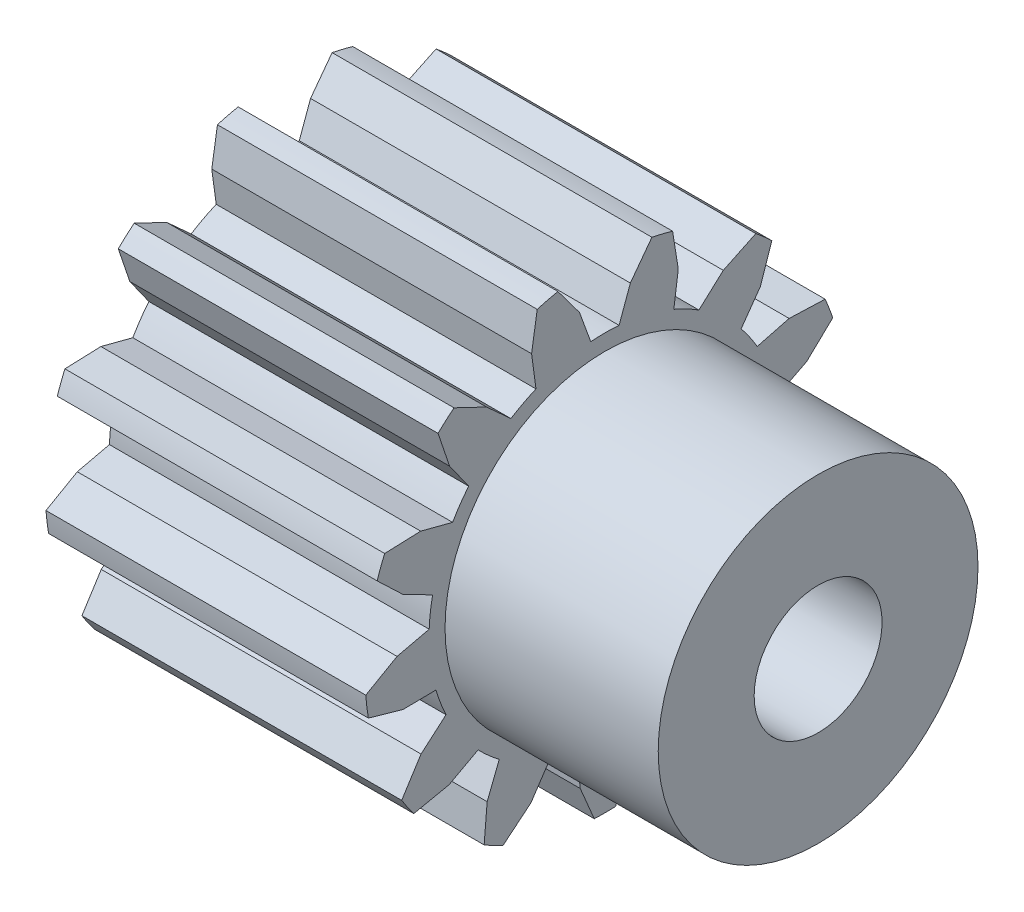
ISO-10303-21;
HEADER;
FILE_DESCRIPTION(('STEP AP214'),'2;1');
FILE_NAME('part.step','',(''),(''),'','','');
FILE_SCHEMA(('AUTOMOTIVE_DESIGN { 1 0 10303 214 1 1 1 1 }'));
ENDSEC;
DATA;
#1=APPLICATION_CONTEXT('core data for automotive mechanical design processes');
#2=APPLICATION_PROTOCOL_DEFINITION('international standard','automotive_design',2000,#1);
#3=PRODUCT_CONTEXT('',#1,'mechanical');
#4=PRODUCT('Part','Part','',(#3));
#5=PRODUCT_RELATED_PRODUCT_CATEGORY('part','',(#4));
#6=PRODUCT_DEFINITION_FORMATION('','',#4);
#7=PRODUCT_DEFINITION_CONTEXT('part definition',#1,'design');
#8=PRODUCT_DEFINITION('design','',#6,#7);
#9=PRODUCT_DEFINITION_SHAPE('','',#8);
#10=(LENGTH_UNIT() NAMED_UNIT(*) SI_UNIT(.MILLI.,.METRE.));
#11=(NAMED_UNIT(*) PLANE_ANGLE_UNIT() SI_UNIT($,.RADIAN.));
#12=(NAMED_UNIT(*) SI_UNIT($,.STERADIAN.) SOLID_ANGLE_UNIT());
#13=UNCERTAINTY_MEASURE_WITH_UNIT(LENGTH_MEASURE(1.E-05),#10,'distance_accuracy_value','');
#14=(GEOMETRIC_REPRESENTATION_CONTEXT(3) GLOBAL_UNCERTAINTY_ASSIGNED_CONTEXT((#13)) GLOBAL_UNIT_ASSIGNED_CONTEXT((#10,
#11,#12)) REPRESENTATION_CONTEXT('',''));
#15=CARTESIAN_POINT('',(0.,0.,0.));
#16=DIRECTION('',(0.,0.,1.));
#17=DIRECTION('',(1.,0.,0.));
#18=AXIS2_PLACEMENT_3D('',#15,#16,#17);
#19=CARTESIAN_POINT('',(-15.,-22.7897677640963,-22.434415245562));
#20=DIRECTION('',(-1.,0.,0.));
#21=DIRECTION('',(0.,0.,1.));
#22=AXIS2_PLACEMENT_3D('',#19,#20,#21);
#23=PLANE('',#22);
#24=CARTESIAN_POINT('',(-15.,0.,0.));
#25=DIRECTION('',(-1.,0.,0.));
#26=DIRECTION('',(0.,0.,1.));
#27=AXIS2_PLACEMENT_3D('',#24,#25,#26);
#28=CIRCLE('',#27,6.);
#29=CARTESIAN_POINT('',(-15.,0.,6.));
#30=VERTEX_POINT('',#29);
#31=EDGE_CURVE('E18',#30,#30,#28,.T.);
#32=ORIENTED_EDGE('',*,*,#31,.F.);
#33=EDGE_LOOP('',(#32));
#34=FACE_BOUND('',#33,.T.);
#35=CARTESIAN_POINT('',(-15.,2.1987620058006E-13,-8.2052420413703E-13));
#36=DIRECTION('',(-1.,0.,0.));
#37=DIRECTION('',(0.,-1.,0.));
#38=AXIS2_PLACEMENT_3D('',#35,#36,#37);
#39=CIRCLE('',#38,16.5000000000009);
#40=CARTESIAN_POINT('',(-15.,-4.59058815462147,15.8485488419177));
#41=VERTEX_POINT('',#40);
#42=CARTESIAN_POINT('',(-15.,-7.0734272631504,14.9069321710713));
#43=VERTEX_POINT('',#42);
#44=EDGE_CURVE('E498',#41,#43,#39,.F.);
#45=ORIENTED_EDGE('',*,*,#44,.F.);
#46=DIRECTION('',(0.,0.0134252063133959,-0.999909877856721));
#47=VECTOR('',#46,1.);
#48=CARTESIAN_POINT('',(-15.,-4.61135409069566,17.3951965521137));
#49=LINE('',#48,#47);
#50=CARTESIAN_POINT('',(-15.,-4.63212002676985,18.9418442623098));
#51=VERTEX_POINT('',#50);
#52=EDGE_CURVE('E2363',#51,#41,#49,.T.);
#53=ORIENTED_EDGE('',*,*,#52,.F.);
#54=DIRECTION('',(0.,-0.274998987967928,-0.961444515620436));
#55=VECTOR('',#54,1.);
#56=CARTESIAN_POINT('',(-15.,-4.16711214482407,20.5675930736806));
#57=LINE('',#56,#55);
#58=CARTESIAN_POINT('',(-15.,-3.7021042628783,22.1933418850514));
#59=VERTEX_POINT('',#58);
#60=EDGE_CURVE('E2364',#59,#51,#57,.T.);
#61=ORIENTED_EDGE('',*,*,#60,.F.);
#62=CARTESIAN_POINT('',(-15.,-3.2E-13,1.33E-12));
#63=DIRECTION('',(-1.,0.,0.));
#64=DIRECTION('',(0.,-0.0762971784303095,0.997085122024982));
#65=AXIS2_PLACEMENT_3D('',#62,#63,#64);
#66=CIRCLE('',#65,22.4999999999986);
#67=CARTESIAN_POINT('',(-15.,-1.71668651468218,22.4344152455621));
#68=VERTEX_POINT('',#67);
#69=EDGE_CURVE('E2382',#68,#59,#66,.F.);
#70=ORIENTED_EDGE('',*,*,#69,.F.);
#71=DIRECTION('',(0.,-0.497096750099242,0.867695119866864));
#72=VECTOR('',#71,1.);
#73=CARTESIAN_POINT('',(-15.,-0.87612375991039,20.9671914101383));
#74=LINE('',#73,#72);
#75=CARTESIAN_POINT('',(-15.,-0.0355610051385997,19.4999675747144));
#76=VERTEX_POINT('',#75);
#77=EDGE_CURVE('E592',#76,#68,#74,.T.);
#78=ORIENTED_EDGE('',*,*,#77,.F.);
#79=DIRECTION('',(0.,-0.226259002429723,0.974067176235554));
#80=VECTOR('',#79,1.);
#81=CARTESIAN_POINT('',(-15.,0.314413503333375,17.9932930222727));
#82=LINE('',#81,#80);
#83=CARTESIAN_POINT('',(-15.,0.664388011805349,16.4866184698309));
#84=VERTEX_POINT('',#83);
#85=EDGE_CURVE('E564',#84,#76,#82,.T.);
#86=ORIENTED_EDGE('',*,*,#85,.F.);
#87=CARTESIAN_POINT('',(-15.,0.,3.10515502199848E-13));
#88=DIRECTION('',(-1.,0.,0.));
#89=DIRECTION('',(0.,-1.,0.));
#90=AXIS2_PLACEMENT_3D('',#87,#88,#89);
#91=CIRCLE('',#90,16.4999999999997);
#92=CARTESIAN_POINT('',(-15.,3.30042394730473,16.1665457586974));
#93=VERTEX_POINT('',#92);
#94=EDGE_CURVE('E565',#93,#84,#91,.F.);
#95=ORIENTED_EDGE('',*,*,#94,.F.);
#96=DIRECTION('',(0.,-0.452793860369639,-0.891615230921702));
#97=VECTOR('',#96,1.);
#98=CARTESIAN_POINT('',(-15.,4.00079965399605,17.5456847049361));
#99=LINE('',#98,#97);
#100=CARTESIAN_POINT('',(-15.,4.70117536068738,18.9248236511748));
#101=VERTEX_POINT('',#100);
#102=EDGE_CURVE('E596',#101,#93,#99,.T.);
#103=ORIENTED_EDGE('',*,*,#102,.F.);
#104=DIRECTION('',(0.,-0.690305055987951,-0.723518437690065));
#105=VECTOR('',#104,1.);
#106=CARTESIAN_POINT('',(-15.,5.86844253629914,20.1482527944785));
#107=LINE('',#106,#105);
#108=CARTESIAN_POINT('',(-15.,7.0357097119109,21.3716819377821));
#109=VERTEX_POINT('',#108);
#110=EDGE_CURVE('E613',#109,#101,#107,.T.);
#111=ORIENTED_EDGE('',*,*,#110,.F.);
#112=CARTESIAN_POINT('',(-15.,5.60315682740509E-13,1.3392065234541E-12));
#113=DIRECTION('',(-1.,0.,0.));
#114=DIRECTION('',(0.,-1.,0.));
#115=AXIS2_PLACEMENT_3D('',#112,#113,#114);
#116=CIRCLE('',#115,22.4999999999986);
#117=CARTESIAN_POINT('',(-15.,8.90574219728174,20.662472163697));
#118=VERTEX_POINT('',#117);
#119=EDGE_CURVE('E617',#118,#109,#116,.F.);
#120=ORIENTED_EDGE('',*,*,#119,.F.);
#121=DIRECTION('',(0.,-0.0369192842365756,0.999318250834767));
#122=VECTOR('',#121,1.);
#123=CARTESIAN_POINT('',(-15.,8.9681706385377,18.9726809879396));
#124=LINE('',#123,#122);
#125=CARTESIAN_POINT('',(-15.,9.03059907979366,17.2828898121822));
#126=VERTEX_POINT('',#125);
#127=EDGE_CURVE('E633',#126,#118,#124,.T.);
#128=ORIENTED_EDGE('',*,*,#127,.F.);
#129=DIRECTION('',(0.,0.252329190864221,0.967641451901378));
#130=VECTOR('',#129,1.);
#131=CARTESIAN_POINT('',(-15.,8.64029953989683,15.7861544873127));
#132=LINE('',#131,#130);
#133=CARTESIAN_POINT('',(-15.,8.25,14.2894191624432));
#134=VERTEX_POINT('',#133);
#135=EDGE_CURVE('E650',#134,#126,#132,.T.);
#136=ORIENTED_EDGE('',*,*,#135,.F.);
#137=CARTESIAN_POINT('',(-15.,1.10154940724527E-13,1.50053580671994E-13));
#138=DIRECTION('',(-1.,0.,0.));
#139=DIRECTION('',(0.,-1.,0.));
#140=AXIS2_PLACEMENT_3D('',#137,#138,#139);
#141=CIRCLE('',#140,16.4999999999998);
#142=CARTESIAN_POINT('',(-15.,10.4353486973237,12.7809818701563));
#143=VERTEX_POINT('',#142);
#144=EDGE_CURVE('E654',#143,#134,#141,.F.);
#145=ORIENTED_EDGE('',*,*,#144,.F.);
#146=DIRECTION('',(0.,-0.815283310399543,-0.57906227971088));
#147=VECTOR('',#146,1.);
#148=CARTESIAN_POINT('',(-15.,11.6964184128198,13.6766679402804));
#149=LINE('',#148,#147);
#150=CARTESIAN_POINT('',(-15.,12.9574881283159,14.5723540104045));
#151=VERTEX_POINT('',#150);
#152=EDGE_CURVE('E670',#151,#143,#149,.T.);
#153=ORIENTED_EDGE('',*,*,#152,.F.);
#154=DIRECTION('',(0.,-0.947470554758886,-0.319843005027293));
#155=VECTOR('',#154,1.);
#156=CARTESIAN_POINT('',(-15.,14.5596077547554,15.1131906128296));
#157=LINE('',#156,#155);
#158=CARTESIAN_POINT('',(-15.,16.1617273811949,15.6540272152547));
#159=VERTEX_POINT('',#158);
#160=EDGE_CURVE('E687',#159,#151,#157,.T.);
#161=ORIENTED_EDGE('',*,*,#160,.F.);
#162=CARTESIAN_POINT('',(-15.,8.39606162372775E-13,5.80265002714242E-13));
#163=DIRECTION('',(-1.,0.,0.));
#164=DIRECTION('',(0.,0.,1.));
#165=AXIS2_PLACEMENT_3D('',#162,#163,#164);
#166=CIRCLE('',#165,22.499999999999);
#167=CARTESIAN_POINT('',(-15.,17.4879726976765,14.1570057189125));
#168=VERTEX_POINT('',#167);
#169=EDGE_CURVE('E691',#168,#159,#166,.F.);
#170=ORIENTED_EDGE('',*,*,#169,.F.);
#171=DIRECTION('',(0.,0.431715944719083,0.902009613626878));
#172=VECTOR('',#171,1.);
#173=CARTESIAN_POINT('',(-15.,16.7579652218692,12.6317579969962));
#174=LINE('',#173,#172);
#175=CARTESIAN_POINT('',(-15.,16.0279577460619,11.1065102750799));
#176=VERTEX_POINT('',#175);
#177=EDGE_CURVE('E707',#176,#168,#174,.T.);
#178=ORIENTED_EDGE('',*,*,#177,.F.);
#179=DIRECTION('',(0.,0.673111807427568,0.739540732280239));
#180=VECTOR('',#179,1.);
#181=CARTESIAN_POINT('',(-15.,14.9867970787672,9.96259820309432));
#182=LINE('',#181,#180);
#183=CARTESIAN_POINT('',(-15.,13.9456364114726,8.81868613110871));
#184=VERTEX_POINT('',#183);
#185=EDGE_CURVE('E724',#184,#176,#182,.T.);
#186=ORIENTED_EDGE('',*,*,#185,.F.);
#187=CARTESIAN_POINT('',(-15.,1.10154940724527E-13,0.));
#188=DIRECTION('',(-1.,0.,0.));
#189=DIRECTION('',(0.,0.,1.));
#190=AXIS2_PLACEMENT_3D('',#187,#188,#189);
#191=CIRCLE('',#190,16.4999999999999);
#192=CARTESIAN_POINT('',(-15.,15.1796608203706,6.46744906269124));
#193=VERTEX_POINT('',#192);
#194=EDGE_CURVE('E728',#193,#184,#191,.F.);
#195=ORIENTED_EDGE('',*,*,#194,.F.);
#196=DIRECTION('',(0.,-0.991001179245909,-0.133853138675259));
#197=VECTOR('',#196,1.);
#198=CARTESIAN_POINT('',(-15.,16.7125286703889,6.67449137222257));
#199=LINE('',#198,#197);
#200=CARTESIAN_POINT('',(-15.,18.2453965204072,6.88153368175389));
#201=VERTEX_POINT('',#200);
#202=EDGE_CURVE('E744',#201,#193,#199,.T.);
#203=ORIENTED_EDGE('',*,*,#202,.F.);
#204=DIRECTION('',(0.,-0.98758196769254,0.157104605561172));
#205=VECTOR('',#204,1.);
#206=CARTESIAN_POINT('',(-15.,19.9153422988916,6.61587859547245));
#207=LINE('',#206,#205);
#208=CARTESIAN_POINT('',(-15.,21.5852880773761,6.35022350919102));
#209=VERTEX_POINT('',#208);
#210=EDGE_CURVE('E761',#209,#201,#207,.T.);
#211=ORIENTED_EDGE('',*,*,#210,.F.);
#212=CARTESIAN_POINT('',(-15.,7.59808882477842E-13,-4.19803081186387E-13));
#213=DIRECTION('',(-1.,0.,0.));
#214=DIRECTION('',(0.,0.,1.));
#215=AXIS2_PLACEMENT_3D('',#212,#213,#214);
#216=CIRCLE('',#215,22.4999999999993);
#217=CARTESIAN_POINT('',(-15.,22.0639194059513,4.40833987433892));
#218=VERTEX_POINT('',#217);
#219=EDGE_CURVE('E765',#218,#209,#216,.F.);
#220=ORIENTED_EDGE('',*,*,#219,.F.);
#221=DIRECTION('',(0.,0.801450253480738,0.598061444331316));
#222=VECTOR('',#221,1.);
#223=CARTESIAN_POINT('',(-15.,20.7087119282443,3.39705147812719));
#224=LINE('',#223,#222);
#225=CARTESIAN_POINT('',(-15.,19.3535044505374,2.38576308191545));
#226=VERTEX_POINT('',#225);
#227=EDGE_CURVE('E781',#226,#218,#224,.T.);
#228=ORIENTED_EDGE('',*,*,#227,.F.);
#229=DIRECTION('',(0.,0.939692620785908,0.342020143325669));
#230=VECTOR('',#229,1.);
#231=CARTESIAN_POINT('',(-15.,17.9000000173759,1.85673073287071));
#232=LINE('',#231,#230);
#233=CARTESIAN_POINT('',(-15.,16.4464955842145,1.32769838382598));
#234=VERTEX_POINT('',#233);
#235=EDGE_CURVE('E798',#234,#226,#232,.T.);
#236=ORIENTED_EDGE('',*,*,#235,.F.);
#237=CARTESIAN_POINT('',(-15.,-3.50414142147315E-13,0.));
#238=DIRECTION('',(-1.,0.,0.));
#239=DIRECTION('',(0.,0.,1.));
#240=AXIS2_PLACEMENT_3D('',#237,#238,#239);
#241=CIRCLE('',#240,16.5000000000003);
#242=CARTESIAN_POINT('',(-15.,16.4464955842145,-1.32769838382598));
#243=VERTEX_POINT('',#242);
#244=EDGE_CURVE('E802',#243,#234,#241,.F.);
#245=ORIENTED_EDGE('',*,*,#244,.F.);
#246=DIRECTION('',(0.,-0.939692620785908,0.342020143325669));
#247=VECTOR('',#246,1.);
#248=CARTESIAN_POINT('',(-15.,17.9000000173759,-1.85673073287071));
#249=LINE('',#248,#247);
#250=CARTESIAN_POINT('',(-15.,19.3535044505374,-2.38576308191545));
#251=VERTEX_POINT('',#250);
#252=EDGE_CURVE('E818',#251,#243,#249,.T.);
#253=ORIENTED_EDGE('',*,*,#252,.F.);
#254=DIRECTION('',(0.,-0.801450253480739,0.598061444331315));
#255=VECTOR('',#254,1.);
#256=CARTESIAN_POINT('',(-15.,20.7087119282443,-3.39705147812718));
#257=LINE('',#256,#255);
#258=CARTESIAN_POINT('',(-15.,22.0639194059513,-4.40833987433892));
#259=VERTEX_POINT('',#258);
#260=EDGE_CURVE('E835',#259,#251,#257,.T.);
#261=ORIENTED_EDGE('',*,*,#260,.F.);
#262=CARTESIAN_POINT('',(-15.,-8.39606162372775E-13,3.99853761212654E-13));
#263=DIRECTION('',(-1.,0.,0.));
#264=DIRECTION('',(0.,0.,1.));
#265=AXIS2_PLACEMENT_3D('',#262,#263,#264);
#266=CIRCLE('',#265,22.5000000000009);
#267=CARTESIAN_POINT('',(-15.,21.5852880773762,-6.35022350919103));
#268=VERTEX_POINT('',#267);
#269=EDGE_CURVE('E839',#268,#259,#266,.F.);
#270=ORIENTED_EDGE('',*,*,#269,.F.);
#271=DIRECTION('',(0.,0.987581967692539,0.157104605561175));
#272=VECTOR('',#271,1.);
#273=CARTESIAN_POINT('',(-15.,19.9153422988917,-6.61587859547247));
#274=LINE('',#273,#272);
#275=CARTESIAN_POINT('',(-15.,18.2453965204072,-6.88153368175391));
#276=VERTEX_POINT('',#275);
#277=EDGE_CURVE('E855',#276,#268,#274,.T.);
#278=ORIENTED_EDGE('',*,*,#277,.F.);
#279=DIRECTION('',(0.,0.991001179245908,-0.133853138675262));
#280=VECTOR('',#279,1.);
#281=CARTESIAN_POINT('',(-15.,16.7125286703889,-6.67449137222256));
#282=LINE('',#281,#280);
#283=CARTESIAN_POINT('',(-15.,15.1796608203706,-6.46744906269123));
#284=VERTEX_POINT('',#283);
#285=EDGE_CURVE('E872',#284,#276,#282,.T.);
#286=ORIENTED_EDGE('',*,*,#285,.F.);
#287=CARTESIAN_POINT('',(-15.,0.,-1.50053580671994E-13));
#288=DIRECTION('',(-1.,0.,0.));
#289=DIRECTION('',(0.,0.,1.));
#290=AXIS2_PLACEMENT_3D('',#287,#288,#289);
#291=CIRCLE('',#290,16.4999999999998);
#292=CARTESIAN_POINT('',(-15.,13.9456364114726,-8.81868613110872));
#293=VERTEX_POINT('',#292);
#294=EDGE_CURVE('E876',#293,#284,#291,.F.);
#295=ORIENTED_EDGE('',*,*,#294,.F.);
#296=DIRECTION('',(0.,-0.67311180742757,0.739540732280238));
#297=VECTOR('',#296,1.);
#298=CARTESIAN_POINT('',(-15.,14.9867970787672,-9.96259820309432));
#299=LINE('',#298,#297);
#300=CARTESIAN_POINT('',(-15.,16.0279577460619,-11.1065102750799));
#301=VERTEX_POINT('',#300);
#302=EDGE_CURVE('E892',#301,#293,#299,.T.);
#303=ORIENTED_EDGE('',*,*,#302,.F.);
#304=DIRECTION('',(0.,-0.431715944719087,0.902009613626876));
#305=VECTOR('',#304,1.);
#306=CARTESIAN_POINT('',(-15.,16.7579652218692,-12.6317579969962));
#307=LINE('',#306,#305);
#308=CARTESIAN_POINT('',(-15.,17.4879726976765,-14.1570057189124));
#309=VERTEX_POINT('',#308);
#310=EDGE_CURVE('E909',#309,#301,#307,.T.);
#311=ORIENTED_EDGE('',*,*,#310,.F.);
#312=CARTESIAN_POINT('',(-15.,-1.196959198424E-13,-6.10622663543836E-13));
#313=DIRECTION('',(-1.,0.,0.));
#314=DIRECTION('',(0.,0.,1.));
#315=AXIS2_PLACEMENT_3D('',#312,#313,#314);
#316=CIRCLE('',#315,22.4999999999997);
#317=CARTESIAN_POINT('',(-15.,16.161727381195,-15.6540272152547));
#318=VERTEX_POINT('',#317);
#319=EDGE_CURVE('E913',#318,#309,#316,.F.);
#320=ORIENTED_EDGE('',*,*,#319,.F.);
#321=DIRECTION('',(0.,0.947470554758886,-0.319843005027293));
#322=VECTOR('',#321,1.);
#323=CARTESIAN_POINT('',(-15.,14.5596077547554,-15.1131906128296));
#324=LINE('',#323,#322);
#325=CARTESIAN_POINT('',(-15.,12.957488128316,-14.5723540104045));
#326=VERTEX_POINT('',#325);
#327=EDGE_CURVE('E929',#326,#318,#324,.T.);
#328=ORIENTED_EDGE('',*,*,#327,.F.);
#329=DIRECTION('',(0.,0.815283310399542,-0.579062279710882));
#330=VECTOR('',#329,1.);
#331=CARTESIAN_POINT('',(-15.,11.6964184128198,-13.6766679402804));
#332=LINE('',#331,#330);
#333=CARTESIAN_POINT('',(-15.,10.4353486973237,-12.7809818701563));
#334=VERTEX_POINT('',#333);
#335=EDGE_CURVE('E946',#334,#326,#332,.T.);
#336=ORIENTED_EDGE('',*,*,#335,.F.);
#337=CARTESIAN_POINT('',(-15.,0.,-1.59594559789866E-13));
#338=DIRECTION('',(-1.,0.,0.));
#339=DIRECTION('',(0.,-1.,0.));
#340=AXIS2_PLACEMENT_3D('',#337,#338,#339);
#341=CIRCLE('',#340,16.4999999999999);
#342=CARTESIAN_POINT('',(-15.,8.25,-14.2894191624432));
#343=VERTEX_POINT('',#342);
#344=EDGE_CURVE('E950',#343,#334,#341,.F.);
#345=ORIENTED_EDGE('',*,*,#344,.F.);
#346=DIRECTION('',(0.,-0.252329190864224,0.967641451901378));
#347=VECTOR('',#346,1.);
#348=CARTESIAN_POINT('',(-15.,8.64029953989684,-15.7861544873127));
#349=LINE('',#348,#347);
#350=CARTESIAN_POINT('',(-15.,9.03059907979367,-17.2828898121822));
#351=VERTEX_POINT('',#350);
#352=EDGE_CURVE('E966',#351,#343,#349,.T.);
#353=ORIENTED_EDGE('',*,*,#352,.F.);
#354=DIRECTION('',(0.,0.0369192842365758,0.999318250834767));
#355=VECTOR('',#354,1.);
#356=CARTESIAN_POINT('',(-15.,8.9681706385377,-18.9726809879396));
#357=LINE('',#356,#355);
#358=CARTESIAN_POINT('',(-15.,8.90574219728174,-20.662472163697));
#359=VERTEX_POINT('',#358);
#360=EDGE_CURVE('E983',#359,#351,#357,.T.);
#361=ORIENTED_EDGE('',*,*,#360,.F.);
#362=CARTESIAN_POINT('',(-15.,0.,-4.49293380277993E-13));
#363=DIRECTION('',(-1.,0.,0.));
#364=DIRECTION('',(0.,-1.,0.));
#365=AXIS2_PLACEMENT_3D('',#362,#363,#364);
#366=CIRCLE('',#365,22.4999999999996);
#367=CARTESIAN_POINT('',(-15.,7.03570971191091,-21.3716819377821));
#368=VERTEX_POINT('',#367);
#369=EDGE_CURVE('E987',#368,#359,#366,.F.);
#370=ORIENTED_EDGE('',*,*,#369,.F.);
#371=DIRECTION('',(0.,0.690305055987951,-0.723518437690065));
#372=VECTOR('',#371,1.);
#373=CARTESIAN_POINT('',(-15.,5.86844253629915,-20.1482527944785));
#374=LINE('',#373,#372);
#375=CARTESIAN_POINT('',(-15.,4.70117536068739,-18.9248236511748));
#376=VERTEX_POINT('',#375);
#377=EDGE_CURVE('E1003',#376,#368,#374,.T.);
#378=ORIENTED_EDGE('',*,*,#377,.F.);
#379=DIRECTION('',(0.,0.452793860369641,-0.891615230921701));
#380=VECTOR('',#379,1.);
#381=CARTESIAN_POINT('',(-15.,4.00079965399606,-17.5456847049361));
#382=LINE('',#381,#380);
#383=CARTESIAN_POINT('',(-15.,3.30042394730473,-16.1665457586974));
#384=VERTEX_POINT('',#383);
#385=EDGE_CURVE('E1020',#384,#376,#382,.T.);
#386=ORIENTED_EDGE('',*,*,#385,.F.);
#387=CARTESIAN_POINT('',(-15.,0.,5.10008701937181E-13));
#388=DIRECTION('',(-1.,0.,0.));
#389=DIRECTION('',(0.,-1.,0.));
#390=AXIS2_PLACEMENT_3D('',#387,#388,#389);
#391=CIRCLE('',#390,16.5000000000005);
#392=CARTESIAN_POINT('',(-15.,0.66438801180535,-16.4866184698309));
#393=VERTEX_POINT('',#392);
#394=EDGE_CURVE('E1024',#393,#384,#391,.F.);
#395=ORIENTED_EDGE('',*,*,#394,.F.);
#396=DIRECTION('',(0.,0.22625900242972,0.974067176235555));
#397=VECTOR('',#396,1.);
#398=CARTESIAN_POINT('',(-15.,0.31441350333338,-17.9932930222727));
#399=LINE('',#398,#397);
#400=CARTESIAN_POINT('',(-15.,-0.0355610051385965,-19.4999675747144));
#401=VERTEX_POINT('',#400);
#402=EDGE_CURVE('E1040',#401,#393,#399,.T.);
#403=ORIENTED_EDGE('',*,*,#402,.F.);
#404=DIRECTION('',(0.,0.497096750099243,0.867695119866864));
#405=VECTOR('',#404,1.);
#406=CARTESIAN_POINT('',(-15.,-0.876123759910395,-20.9671914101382));
#407=LINE('',#406,#405);
#408=CARTESIAN_POINT('',(-15.,-1.71668651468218,-22.434415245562));
#409=VERTEX_POINT('',#408);
#410=EDGE_CURVE('E1057',#409,#401,#407,.T.);
#411=ORIENTED_EDGE('',*,*,#410,.F.);
#412=CARTESIAN_POINT('',(-15.,-8.50000000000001E-13,-3.87E-12));
#413=DIRECTION('',(-1.,0.,0.));
#414=DIRECTION('',(0.,-0.164537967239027,-0.986370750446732));
#415=AXIS2_PLACEMENT_3D('',#412,#413,#414);
#416=CIRCLE('',#415,22.499999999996);
#417=CARTESIAN_POINT('',(-15.,-3.7021042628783,-22.1933418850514));
#418=VERTEX_POINT('',#417);
#419=EDGE_CURVE('E1074',#418,#409,#416,.F.);
#420=ORIENTED_EDGE('',*,*,#419,.F.);
#421=DIRECTION('',(0.,0.274998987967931,-0.961444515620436));
#422=VECTOR('',#421,1.);
#423=CARTESIAN_POINT('',(-15.,-4.16711214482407,-20.5675930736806));
#424=LINE('',#423,#422);
#425=CARTESIAN_POINT('',(-15.,-4.63212002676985,-18.9418442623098));
#426=VERTEX_POINT('',#425);
#427=EDGE_CURVE('E1091',#426,#418,#424,.T.);
#428=ORIENTED_EDGE('',*,*,#427,.F.);
#429=DIRECTION('',(0.,-0.0134252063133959,-0.999909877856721));
#430=VECTOR('',#429,1.);
#431=CARTESIAN_POINT('',(-15.,-4.61135409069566,-17.3951965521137));
#432=LINE('',#431,#430);
#433=CARTESIAN_POINT('',(-15.,-4.59058815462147,-15.8485488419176));
#434=VERTEX_POINT('',#433);
#435=EDGE_CURVE('E1108',#434,#426,#432,.T.);
#436=ORIENTED_EDGE('',*,*,#435,.F.);
#437=CARTESIAN_POINT('',(-15.,-1.50053580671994E-13,-4.19803081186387E-13));
#438=DIRECTION('',(-1.,0.,0.));
#439=DIRECTION('',(0.,-1.,0.));
#440=AXIS2_PLACEMENT_3D('',#437,#438,#439);
#441=CIRCLE('',#440,16.4999999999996);
#442=CARTESIAN_POINT('',(-15.,-7.07342726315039,-14.9069321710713));
#443=VERTEX_POINT('',#442);
#444=EDGE_CURVE('E1112',#443,#434,#441,.F.);
#445=ORIENTED_EDGE('',*,*,#444,.F.);
#446=DIRECTION('',(0.,0.653013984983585,0.75734584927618));
#447=VECTOR('',#446,1.);
#448=CARTESIAN_POINT('',(-15.,-8.08350087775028,-16.0783849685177));
#449=LINE('',#448,#447);
#450=CARTESIAN_POINT('',(-15.,-9.09357449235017,-17.249837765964));
#451=VERTEX_POINT('',#450);
#452=EDGE_CURVE('E1128',#451,#443,#449,.T.);
#453=ORIENTED_EDGE('',*,*,#452,.F.);
#454=DIRECTION('',(0.,0.843395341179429,0.53729349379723));
#455=VECTOR('',#454,1.);
#456=CARTESIAN_POINT('',(-15.,-10.5197087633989,-18.1583709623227));
#457=LINE('',#456,#455);
#458=CARTESIAN_POINT('',(-15.,-11.9458430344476,-19.0669041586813));
#459=VERTEX_POINT('',#458);
#460=EDGE_CURVE('E1145',#459,#451,#457,.T.);
#461=ORIENTED_EDGE('',*,*,#460,.F.);
#462=CARTESIAN_POINT('',(-15.,-1.64972202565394E-12,-2.48932818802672E-12));
#463=DIRECTION('',(-1.,0.,0.));
#464=DIRECTION('',(0.,-1.,0.));
#465=AXIS2_PLACEMENT_3D('',#462,#463,#464);
#466=CIRCLE('',#465,22.499999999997);
#467=CARTESIAN_POINT('',(-15.,-13.5918107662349,-17.930774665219));
#468=VERTEX_POINT('',#467);
#469=EDGE_CURVE('E1149',#468,#459,#466,.F.);
#470=ORIENTED_EDGE('',*,*,#469,.F.);
#471=DIRECTION('',(0.,-0.203306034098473,-0.97911524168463));
#472=VECTOR('',#471,1.);
#473=CARTESIAN_POINT('',(-15.,-13.2480316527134,-16.275145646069));
#474=LINE('',#473,#472);
#475=CARTESIAN_POINT('',(-15.,-12.9042525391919,-14.6195166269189));
#476=VERTEX_POINT('',#475);
#477=EDGE_CURVE('E1165',#476,#468,#474,.T.);
#478=ORIENTED_EDGE('',*,*,#477,.F.);
#479=DIRECTION('',(0.,-0.476568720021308,-0.879137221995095));
#480=VECTOR('',#479,1.);
#481=CARTESIAN_POINT('',(-15.,-12.1671021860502,-13.2596785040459));
#482=LINE('',#481,#480);
#483=CARTESIAN_POINT('',(-15.,-11.4299518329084,-11.8998403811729));
#484=VERTEX_POINT('',#483);
#485=EDGE_CURVE('E1182',#484,#476,#482,.T.);
#486=ORIENTED_EDGE('',*,*,#485,.F.);
#487=CARTESIAN_POINT('',(-15.,3.00107161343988E-13,2.40259201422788E-13));
#488=DIRECTION('',(-1.,0.,0.));
#489=DIRECTION('',(0.,0.,1.));
#490=AXIS2_PLACEMENT_3D('',#487,#488,#489);
#491=CIRCLE('',#490,16.5000000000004);
#492=CARTESIAN_POINT('',(-15.,-13.1908055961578,-9.91224735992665));
#493=VERTEX_POINT('',#492);
#494=EDGE_CURVE('E1186',#493,#484,#491,.F.);
#495=ORIENTED_EDGE('',*,*,#494,.F.);
#496=DIRECTION('',(0.,0.930171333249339,0.367125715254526));
#497=VECTOR('',#496,1.);
#498=CARTESIAN_POINT('',(-15.,-14.6295826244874,-10.4801126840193));
#499=LINE('',#498,#497);
#500=CARTESIAN_POINT('',(-15.,-16.068359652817,-11.0479780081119));
#501=VERTEX_POINT('',#500);
#502=EDGE_CURVE('E1202',#501,#493,#499,.T.);
#503=ORIENTED_EDGE('',*,*,#502,.F.);
#504=DIRECTION('',(0.,0.996482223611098,0.0838044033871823));
#505=VECTOR('',#504,1.);
#506=CARTESIAN_POINT('',(-15.,-17.7533552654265,-11.1896865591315));
#507=LINE('',#506,#505);
#508=CARTESIAN_POINT('',(-15.,-19.438350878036,-11.3313951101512));
#509=VERTEX_POINT('',#508);
#510=EDGE_CURVE('E1219',#509,#501,#507,.T.);
#511=ORIENTED_EDGE('',*,*,#510,.F.);
#512=CARTESIAN_POINT('',(-15.,1.12063136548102E-12,4.9960036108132E-13));
#513=DIRECTION('',(-1.,0.,0.));
#514=DIRECTION('',(0.,0.,1.));
#515=AXIS2_PLACEMENT_3D('',#512,#513,#514);
#516=CIRCLE('',#515,22.5000000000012);
#517=CARTESIAN_POINT('',(-15.,-20.3677972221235,-9.56048305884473));
#518=VERTEX_POINT('',#517);
#519=EDGE_CURVE('E1223',#518,#509,#516,.F.);
#520=ORIENTED_EDGE('',*,*,#519,.F.);
#521=DIRECTION('',(0.,-0.635036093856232,-0.772482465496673));
#522=VECTOR('',#521,1.);
#523=CARTESIAN_POINT('',(-15.,-19.2939867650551,-8.25425848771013));
#524=LINE('',#523,#522);
#525=CARTESIAN_POINT('',(-15.,-18.2201763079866,-6.94803391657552));
#526=VERTEX_POINT('',#525);
#527=EDGE_CURVE('E1239',#526,#518,#524,.T.);
#528=ORIENTED_EDGE('',*,*,#527,.F.);
#529=DIRECTION('',(0.,-0.830536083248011,-0.55696482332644));
#530=VECTOR('',#529,1.);
#531=CARTESIAN_POINT('',(-15.,-16.9355138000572,-6.08652790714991));
#532=LINE('',#531,#530);
#533=CARTESIAN_POINT('',(-15.,-15.6508512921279,-5.22502189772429));
#534=VERTEX_POINT('',#533);
#535=EDGE_CURVE('E1256',#534,#526,#532,.T.);
#536=ORIENTED_EDGE('',*,*,#535,.F.);
#537=CARTESIAN_POINT('',(-15.,-3.6949610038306E-13,0.));
#538=DIRECTION('',(-1.,0.,0.));
#539=DIRECTION('',(0.,0.,1.));
#540=AXIS2_PLACEMENT_3D('',#537,#538,#539);
#541=CIRCLE('',#540,16.4999999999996);
#542=CARTESIAN_POINT('',(-15.,-16.2863293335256,-2.64678613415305));
#543=VERTEX_POINT('',#542);
#544=EDGE_CURVE('E1260',#543,#534,#541,.F.);
#545=ORIENTED_EDGE('',*,*,#544,.F.);
#546=DIRECTION('',(0.,0.994237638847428,-0.107198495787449));
#547=VECTOR('',#546,1.);
#548=CARTESIAN_POINT('',(-15.,-17.8242032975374,-2.48097288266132));
#549=LINE('',#548,#547);
#550=CARTESIAN_POINT('',(-15.,-19.3620772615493,-2.31515963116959));
#551=VERTEX_POINT('',#550);
#552=EDGE_CURVE('E1276',#551,#543,#549,.T.);
#553=ORIENTED_EDGE('',*,*,#552,.F.);
#554=DIRECTION('',(0.,0.921287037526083,-0.388883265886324));
#555=VECTOR('',#554,1.);
#556=CARTESIAN_POINT('',(-15.,-20.9199220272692,-1.6575798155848));
#557=LINE('',#556,#555);
#558=CARTESIAN_POINT('',(-15.,-22.4777667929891,-1.));
#559=VERTEX_POINT('',#558);
#560=EDGE_CURVE('E1293',#559,#551,#557,.T.);
#561=ORIENTED_EDGE('',*,*,#560,.F.);
#562=CARTESIAN_POINT('',(-15.,-3.00974523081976E-12,-3.70038201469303E-13));
#563=DIRECTION('',(-1.,0.,0.));
#564=DIRECTION('',(0.,0.,1.));
#565=AXIS2_PLACEMENT_3D('',#562,#563,#564);
#566=CIRCLE('',#565,22.499999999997);
#567=CARTESIAN_POINT('',(-15.,-22.477766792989,1.));
#568=VERTEX_POINT('',#567);
#569=EDGE_CURVE('E1297',#568,#559,#566,.F.);
#570=ORIENTED_EDGE('',*,*,#569,.F.);
#571=DIRECTION('',(0.,-0.921287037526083,-0.388883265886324));
#572=VECTOR('',#571,1.);
#573=CARTESIAN_POINT('',(-15.,-20.9199220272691,1.65757981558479));
#574=LINE('',#573,#572);
#575=CARTESIAN_POINT('',(-15.,-19.3620772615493,2.31515963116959));
#576=VERTEX_POINT('',#575);
#577=EDGE_CURVE('E1313',#576,#568,#574,.T.);
#578=ORIENTED_EDGE('',*,*,#577,.F.);
#579=DIRECTION('',(0.,-0.994237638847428,-0.107198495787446));
#580=VECTOR('',#579,1.);
#581=CARTESIAN_POINT('',(-15.,-17.8242032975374,2.48097288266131));
#582=LINE('',#581,#580);
#583=CARTESIAN_POINT('',(-15.,-16.2863293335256,2.64678613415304));
#584=VERTEX_POINT('',#583);
#585=EDGE_CURVE('E1330',#584,#576,#582,.T.);
#586=ORIENTED_EDGE('',*,*,#585,.F.);
#587=CARTESIAN_POINT('',(-15.,1.80411241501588E-13,0.));
#588=DIRECTION('',(-1.,0.,0.));
#589=DIRECTION('',(0.,0.,1.));
#590=AXIS2_PLACEMENT_3D('',#587,#588,#589);
#591=CIRCLE('',#590,16.5000000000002);
#592=CARTESIAN_POINT('',(-15.,-15.6508512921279,5.22502189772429));
#593=VERTEX_POINT('',#592);
#594=EDGE_CURVE('E1334',#593,#584,#591,.F.);
#595=ORIENTED_EDGE('',*,*,#594,.F.);
#596=DIRECTION('',(0.,0.830536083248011,-0.556964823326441));
#597=VECTOR('',#596,1.);
#598=CARTESIAN_POINT('',(-15.,-16.9355138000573,6.0865279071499));
#599=LINE('',#598,#597);
#600=CARTESIAN_POINT('',(-15.,-18.2201763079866,6.94803391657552));
#601=VERTEX_POINT('',#600);
#602=EDGE_CURVE('E1350',#601,#593,#599,.T.);
#603=ORIENTED_EDGE('',*,*,#602,.F.);
#604=DIRECTION('',(0.,0.635036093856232,-0.772482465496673));
#605=VECTOR('',#604,1.);
#606=CARTESIAN_POINT('',(-15.,-19.2939867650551,8.25425848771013));
#607=LINE('',#606,#605);
#608=CARTESIAN_POINT('',(-15.,-20.3677972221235,9.56048305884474));
#609=VERTEX_POINT('',#608);
#610=EDGE_CURVE('E1367',#609,#601,#607,.T.);
#611=ORIENTED_EDGE('',*,*,#610,.F.);
#612=CARTESIAN_POINT('',(-15.,-3.77996245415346E-12,1.64972202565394E-12));
#613=DIRECTION('',(-1.,0.,0.));
#614=DIRECTION('',(0.,0.,1.));
#615=AXIS2_PLACEMENT_3D('',#612,#613,#614);
#616=CIRCLE('',#615,22.4999999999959);
#617=CARTESIAN_POINT('',(-15.,-19.438350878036,11.3313951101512));
#618=VERTEX_POINT('',#617);
#619=EDGE_CURVE('E1371',#618,#609,#616,.F.);
#620=ORIENTED_EDGE('',*,*,#619,.F.);
#621=DIRECTION('',(0.,-0.996482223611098,0.0838044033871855));
#622=VECTOR('',#621,1.);
#623=CARTESIAN_POINT('',(-15.,-17.7533552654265,11.1896865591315));
#624=LINE('',#623,#622);
#625=CARTESIAN_POINT('',(-15.,-16.068359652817,11.0479780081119));
#626=VERTEX_POINT('',#625);
#627=EDGE_CURVE('E1387',#626,#618,#624,.T.);
#628=ORIENTED_EDGE('',*,*,#627,.F.);
#629=DIRECTION('',(0.,-0.930171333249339,0.367125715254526));
#630=VECTOR('',#629,1.);
#631=CARTESIAN_POINT('',(-15.,-14.6295826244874,10.4801126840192));
#632=LINE('',#631,#630);
#633=CARTESIAN_POINT('',(-15.,-13.1908055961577,9.91224735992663));
#634=VERTEX_POINT('',#633);
#635=EDGE_CURVE('E1404',#634,#626,#632,.T.);
#636=ORIENTED_EDGE('',*,*,#635,.F.);
#637=CARTESIAN_POINT('',(-15.,-3.0964814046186E-13,5.60315682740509E-13));
#638=DIRECTION('',(-1.,0.,0.));
#639=DIRECTION('',(0.,-1.,0.));
#640=AXIS2_PLACEMENT_3D('',#637,#638,#639);
#641=CIRCLE('',#640,16.4999999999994);
#642=CARTESIAN_POINT('',(-15.,-11.4299518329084,11.8998403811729));
#643=VERTEX_POINT('',#642);
#644=EDGE_CURVE('E1408',#643,#634,#641,.F.);
#645=ORIENTED_EDGE('',*,*,#644,.F.);
#646=DIRECTION('',(0.,0.476568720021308,-0.879137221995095));
#647=VECTOR('',#646,1.);
#648=CARTESIAN_POINT('',(-15.,-12.1671021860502,13.2596785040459));
#649=LINE('',#648,#647);
#650=CARTESIAN_POINT('',(-15.,-12.9042525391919,14.6195166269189));
#651=VERTEX_POINT('',#650);
#652=EDGE_CURVE('E1424',#651,#643,#649,.T.);
#653=ORIENTED_EDGE('',*,*,#652,.F.);
#654=DIRECTION('',(0.,0.203306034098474,-0.979115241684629));
#655=VECTOR('',#654,1.);
#656=CARTESIAN_POINT('',(-15.,-13.2480316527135,16.275145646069));
#657=LINE('',#656,#655);
#658=CARTESIAN_POINT('',(-15.,-13.591810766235,17.930774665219));
#659=VERTEX_POINT('',#658);
#660=EDGE_CURVE('E1441',#659,#651,#657,.T.);
#661=ORIENTED_EDGE('',*,*,#660,.F.);
#662=CARTESIAN_POINT('',(-15.,-1.34961486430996E-12,1.04083408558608E-12));
#663=DIRECTION('',(-1.,0.,0.));
#664=DIRECTION('',(0.,-1.,0.));
#665=AXIS2_PLACEMENT_3D('',#662,#663,#664);
#666=CIRCLE('',#665,22.4999999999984);
#667=CARTESIAN_POINT('',(-15.,-11.9458430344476,19.0669041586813));
#668=VERTEX_POINT('',#667);
#669=EDGE_CURVE('E1445',#668,#659,#666,.F.);
#670=ORIENTED_EDGE('',*,*,#669,.F.);
#671=DIRECTION('',(0.,-0.84339534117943,0.537293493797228));
#672=VECTOR('',#671,1.);
#673=CARTESIAN_POINT('',(-15.,-10.5197087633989,18.1583709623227));
#674=LINE('',#673,#672);
#675=CARTESIAN_POINT('',(-15.,-9.09357449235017,17.249837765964));
#676=VERTEX_POINT('',#675);
#677=EDGE_CURVE('E503',#676,#668,#674,.T.);
#678=ORIENTED_EDGE('',*,*,#677,.F.);
#679=DIRECTION('',(0.,-0.653013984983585,0.75734584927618));
#680=VECTOR('',#679,1.);
#681=CARTESIAN_POINT('',(-15.,-8.08350087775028,16.0783849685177));
#682=LINE('',#681,#680);
#683=EDGE_CURVE('E501',#43,#676,#682,.T.);
#684=ORIENTED_EDGE('',*,*,#683,.F.);
#685=EDGE_LOOP('',(#45,#53,#61,#70,#78,#86,#95,#103,#111,#120,#128,#136,#145,#153,#161,#170,
#178,#186,#195,#203,#211,#220,#228,#236,#245,#253,#261,#270,#278,#286,#295,#303,#311,#320,#328,
#336,#345,#353,#361,#370,#378,#386,#395,#403,#411,#420,#428,#436,#445,#453,#461,#470,#478,#486,
#495,#503,#511,#520,#528,#536,#545,#553,#561,#570,#578,#586,#595,#603,#611,#620,#628,#636,#645,
#653,#661,#670,#678,#684));
#686=FACE_BOUND('',#685,.T.);
#687=ADVANCED_FACE('F15',(#34,#686),#23,.T.);
#688=CARTESIAN_POINT('',(35.,0.,0.));
#689=DIRECTION('',(-1.,0.,0.));
#690=DIRECTION('',(0.,0.,1.));
#691=AXIS2_PLACEMENT_3D('',#688,#689,#690);
#692=CYLINDRICAL_SURFACE('',#691,6.);
#693=ORIENTED_EDGE('',*,*,#31,.T.);
#694=EDGE_LOOP('',(#693));
#695=FACE_BOUND('',#694,.T.);
#696=CARTESIAN_POINT('',(35.,0.,0.));
#697=DIRECTION('',(-1.,0.,0.));
#698=DIRECTION('',(0.,0.,1.));
#699=AXIS2_PLACEMENT_3D('',#696,#697,#698);
#700=CIRCLE('',#699,6.);
#701=CARTESIAN_POINT('',(35.,0.,6.));
#702=VERTEX_POINT('',#701);
#703=EDGE_CURVE('E1464',#702,#702,#700,.T.);
#704=ORIENTED_EDGE('',*,*,#703,.F.);
#705=EDGE_LOOP('',(#704));
#706=FACE_BOUND('',#705,.T.);
#707=ADVANCED_FACE('F2291',(#695,#706),#692,.F.);
#708=CARTESIAN_POINT('',(-15.,-3.19948061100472E-13,1.33053290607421E-12));
#709=DIRECTION('',(-1.,0.,0.));
#710=DIRECTION('',(0.,-1.,0.));
#711=AXIS2_PLACEMENT_3D('',#708,#709,#710);
#712=CYLINDRICAL_SURFACE('',#711,22.4999999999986);
#713=CARTESIAN_POINT('',(15.,-1.71668651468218,22.4344152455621));
#714=CARTESIAN_POINT('',(15.,-1.79985097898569,22.4280493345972));
#715=CARTESIAN_POINT('',(15.,-1.88298014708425,22.4212221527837));
#716=CARTESIAN_POINT('',(15.,-2.04912367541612,22.4066481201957));
#717=CARTESIAN_POINT('',(15.,-2.13213806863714,22.3989016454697));
#718=CARTESIAN_POINT('',(15.,-2.29805205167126,22.382489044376));
#719=CARTESIAN_POINT('',(15.,-2.38095166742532,22.3738231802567));
#720=CARTESIAN_POINT('',(15.,-2.54663610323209,22.3555719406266));
#721=CARTESIAN_POINT('',(15.,-2.62942093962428,22.3459867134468));
#722=CARTESIAN_POINT('',(15.,-2.79487582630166,22.3258968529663));
#723=CARTESIAN_POINT('',(15.,-2.87754588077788,22.3153922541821));
#724=CARTESIAN_POINT('',(15.,-3.04277121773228,22.2934637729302));
#725=CARTESIAN_POINT('',(15.,-3.12532648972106,22.2820398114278));
#726=CARTESIAN_POINT('',(15.,-3.29032227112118,22.2582726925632));
#727=CARTESIAN_POINT('',(15.,-3.37276275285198,22.2459293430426));
#728=CARTESIAN_POINT('',(15.,-3.53752899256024,22.2203236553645));
#729=CARTESIAN_POINT('',(15.,-3.61985470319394,22.2070610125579));
#730=CARTESIAN_POINT('',(15.,-3.7021042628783,22.1933418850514));
#731=B_SPLINE_CURVE_WITH_KNOTS('',3,(#713,#714,#715,#716,#717,#718,#719,#720,#721,#722,#723,
#724,#725,#726,#727,#728,#729,#730),.UNSPECIFIED.,.F.,.F.,(4,2,2,2,2,2,2,2,4),(0.,
0.250221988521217,0.500341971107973,0.750390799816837,1.00039935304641,1.25039852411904,
1.50041920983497,1.75049229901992,2.00064866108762),.UNSPECIFIED.);
#732=CARTESIAN_POINT('',(15.,-1.71668659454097,22.4344152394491));
#733=VERTEX_POINT('',#732);
#734=CARTESIAN_POINT('',(15.,-3.7021042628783,22.1933418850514));
#735=VERTEX_POINT('',#734);
#736=EDGE_CURVE('E1467',#733,#735,#731,.T.);
#737=ORIENTED_EDGE('',*,*,#736,.F.);
#738=DIRECTION('',(-1.,0.,0.));
#739=VECTOR('',#738,1.);
#740=CARTESIAN_POINT('',(15.,-1.71668651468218,22.4344152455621));
#741=LINE('',#740,#739);
#742=EDGE_CURVE('E2369',#68,#733,#741,.F.);
#743=ORIENTED_EDGE('',*,*,#742,.F.);
#744=ORIENTED_EDGE('',*,*,#69,.T.);
#745=DIRECTION('',(-1.,0.,0.));
#746=VECTOR('',#745,1.);
#747=CARTESIAN_POINT('',(15.,-3.7021042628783,22.1933418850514));
#748=LINE('',#747,#746);
#749=EDGE_CURVE('E2356',#735,#59,#748,.T.);
#750=ORIENTED_EDGE('',*,*,#749,.F.);
#751=EDGE_LOOP('',(#737,#743,#744,#750));
#752=FACE_BOUND('',#751,.T.);
#753=ADVANCED_FACE('F2293',(#752),#712,.T.);
#754=CARTESIAN_POINT('',(15.,-4.63212002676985,18.9418442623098));
#755=DIRECTION('',(0.,-0.961444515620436,0.274998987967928));
#756=DIRECTION('',(0.,0.274998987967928,0.961444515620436));
#757=AXIS2_PLACEMENT_3D('',#754,#755,#756);
#758=PLANE('',#757);
#759=CARTESIAN_POINT('',(15.,-3.7021042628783,22.1933418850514));
#760=CARTESIAN_POINT('',(15.,-3.74085491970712,22.0578628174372));
#761=CARTESIAN_POINT('',(15.,-3.77960557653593,21.922383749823));
#762=CARTESIAN_POINT('',(15.,-3.85710689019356,21.6514256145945));
#763=CARTESIAN_POINT('',(15.,-3.89585754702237,21.5159465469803));
#764=CARTESIAN_POINT('',(15.,-3.97335886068,21.2449884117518));
#765=CARTESIAN_POINT('',(15.,-4.01210951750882,21.1095093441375));
#766=CARTESIAN_POINT('',(15.,-4.08961083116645,20.8385512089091));
#767=CARTESIAN_POINT('',(15.,-4.12836148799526,20.7030721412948));
#768=CARTESIAN_POINT('',(15.,-4.20586280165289,20.4321140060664));
#769=CARTESIAN_POINT('',(15.,-4.24461345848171,20.2966349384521));
#770=CARTESIAN_POINT('',(15.,-4.32211477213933,20.0256768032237));
#771=CARTESIAN_POINT('',(15.,-4.36086542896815,19.8901977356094));
#772=CARTESIAN_POINT('',(15.,-4.43836674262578,19.619239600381));
#773=CARTESIAN_POINT('',(15.,-4.47711739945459,19.4837605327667));
#774=CARTESIAN_POINT('',(15.,-4.55461871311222,19.2128023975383));
#775=CARTESIAN_POINT('',(15.,-4.59336936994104,19.077323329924));
#776=CARTESIAN_POINT('',(15.,-4.63212002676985,18.9418442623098));
#777=B_SPLINE_CURVE_WITH_KNOTS('',3,(#759,#760,#761,#762,#763,#764,#765,#766,#767,#768,#769,
#770,#771,#772,#773,#774,#775,#776),.UNSPECIFIED.,.F.,.F.,(4,2,2,2,2,2,2,2,4),(0.,
0.422735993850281,0.845471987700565,1.26820798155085,1.69094397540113,2.11367996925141,
2.53641596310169,2.95915195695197,3.38188795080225),.UNSPECIFIED.);
#778=CARTESIAN_POINT('',(15.,-4.63212002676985,18.9418442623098));
#779=VERTEX_POINT('',#778);
#780=EDGE_CURVE('E534',#735,#779,#777,.T.);
#781=ORIENTED_EDGE('',*,*,#780,.F.);
#782=ORIENTED_EDGE('',*,*,#749,.T.);
#783=ORIENTED_EDGE('',*,*,#60,.T.);
#784=DIRECTION('',(-1.,0.,0.));
#785=VECTOR('',#784,1.);
#786=CARTESIAN_POINT('',(15.,-4.63212002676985,18.9418442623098));
#787=LINE('',#786,#785);
#788=EDGE_CURVE('E515',#779,#51,#787,.T.);
#789=ORIENTED_EDGE('',*,*,#788,.F.);
#790=EDGE_LOOP('',(#781,#782,#783,#789));
#791=FACE_BOUND('',#790,.T.);
#792=ADVANCED_FACE('F2299',(#791),#758,.T.);
#793=CARTESIAN_POINT('',(15.,-4.59058815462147,15.8485488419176));
#794=DIRECTION('',(0.,-0.999909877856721,-0.0134252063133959));
#795=DIRECTION('',(0.,-0.0134252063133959,0.999909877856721));
#796=AXIS2_PLACEMENT_3D('',#793,#794,#795);
#797=PLANE('',#796);
#798=CARTESIAN_POINT('',(15.,-4.63212002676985,18.9418442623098));
#799=CARTESIAN_POINT('',(15.,-4.630389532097,18.8129569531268));
#800=CARTESIAN_POINT('',(15.,-4.62865903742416,18.6840696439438));
#801=CARTESIAN_POINT('',(15.,-4.62519804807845,18.4262950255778));
#802=CARTESIAN_POINT('',(15.,-4.6234675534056,18.2974077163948));
#803=CARTESIAN_POINT('',(15.,-4.6200065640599,18.0396330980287));
#804=CARTESIAN_POINT('',(15.,-4.61827606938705,17.9107457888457));
#805=CARTESIAN_POINT('',(15.,-4.61481508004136,17.6529711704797));
#806=CARTESIAN_POINT('',(15.,-4.61308458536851,17.5240838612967));
#807=CARTESIAN_POINT('',(15.,-4.60962359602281,17.2663092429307));
#808=CARTESIAN_POINT('',(15.,-4.60789310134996,17.1374219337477));
#809=CARTESIAN_POINT('',(15.,-4.60443211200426,16.8796473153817));
#810=CARTESIAN_POINT('',(15.,-4.60270161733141,16.7507600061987));
#811=CARTESIAN_POINT('',(15.,-4.59924062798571,16.4929853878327));
#812=CARTESIAN_POINT('',(15.,-4.59751013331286,16.3640980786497));
#813=CARTESIAN_POINT('',(15.,-4.59404914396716,16.1063234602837));
#814=CARTESIAN_POINT('',(15.,-4.59231864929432,15.9774361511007));
#815=CARTESIAN_POINT('',(15.,-4.59058815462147,15.8485488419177));
#816=B_SPLINE_CURVE_WITH_KNOTS('',3,(#798,#799,#800,#801,#802,#803,#804,#805,#806,#807,#808,
#809,#810,#811,#812,#813,#814,#815),.UNSPECIFIED.,.F.,.F.,(4,2,2,2,2,2,2,2,4),(0.,
0.3866967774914,0.773393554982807,1.16009033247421,1.54678710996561,1.93348388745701,
2.32018066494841,2.70687744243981,3.09357421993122),.UNSPECIFIED.);
#817=CARTESIAN_POINT('',(15.,-4.59058815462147,15.8485488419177));
#818=VERTEX_POINT('',#817);
#819=EDGE_CURVE('E530',#779,#818,#816,.T.);
#820=ORIENTED_EDGE('',*,*,#819,.F.);
#821=ORIENTED_EDGE('',*,*,#788,.T.);
#822=ORIENTED_EDGE('',*,*,#52,.T.);
#823=DIRECTION('',(-1.,0.,0.));
#824=VECTOR('',#823,1.);
#825=CARTESIAN_POINT('',(0.,-4.59058815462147,15.8485488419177));
#826=LINE('',#825,#824);
#827=EDGE_CURVE('E508',#818,#41,#826,.T.);
#828=ORIENTED_EDGE('',*,*,#827,.F.);
#829=EDGE_LOOP('',(#820,#821,#822,#828));
#830=FACE_BOUND('',#829,.T.);
#831=ADVANCED_FACE('F2307',(#830),#797,.T.);
#832=CARTESIAN_POINT('',(-15.,2.1987620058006E-13,-8.2052420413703E-13));
#833=DIRECTION('',(-1.,0.,0.));
#834=DIRECTION('',(0.,-1.,0.));
#835=AXIS2_PLACEMENT_3D('',#832,#833,#834);
#836=CYLINDRICAL_SURFACE('',#835,16.5000000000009);
#837=CARTESIAN_POINT('',(15.,2.18361443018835E-13,-8.20962959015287E-13));
#838=DIRECTION('',(-1.,0.,0.));
#839=DIRECTION('',(0.,-1.,0.));
#840=AXIS2_PLACEMENT_3D('',#837,#838,#839);
#841=CIRCLE('',#840,16.5000000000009);
#842=CARTESIAN_POINT('',(15.,-7.0734272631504,14.9069321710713));
#843=VERTEX_POINT('',#842);
#844=EDGE_CURVE('E533',#818,#843,#841,.F.);
#845=ORIENTED_EDGE('',*,*,#844,.F.);
#846=ORIENTED_EDGE('',*,*,#827,.T.);
#847=ORIENTED_EDGE('',*,*,#44,.T.);
#848=DIRECTION('',(-1.,0.,0.));
#849=VECTOR('',#848,1.);
#850=CARTESIAN_POINT('',(15.,-7.0734272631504,14.9069321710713));
#851=LINE('',#850,#849);
#852=EDGE_CURVE('E507',#843,#43,#851,.T.);
#853=ORIENTED_EDGE('',*,*,#852,.F.);
#854=EDGE_LOOP('',(#845,#846,#847,#853));
#855=FACE_BOUND('',#854,.T.);
#856=ADVANCED_FACE('F513',(#855),#836,.T.);
#857=CARTESIAN_POINT('',(15.,-9.09357449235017,17.249837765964));
#858=DIRECTION('',(0.,0.75734584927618,0.653013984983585));
#859=DIRECTION('',(0.,0.653013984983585,-0.75734584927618));
#860=AXIS2_PLACEMENT_3D('',#857,#858,#859);
#861=PLANE('',#860);
#862=CARTESIAN_POINT('',(15.,-7.07342726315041,14.9069321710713));
#863=CARTESIAN_POINT('',(15.,-7.15760006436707,15.0045532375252));
#864=CARTESIAN_POINT('',(15.,-7.24177286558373,15.102174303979));
#865=CARTESIAN_POINT('',(15.,-7.41011846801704,15.2974164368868));
#866=CARTESIAN_POINT('',(15.,-7.49429126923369,15.3950375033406));
#867=CARTESIAN_POINT('',(15.,-7.66263687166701,15.5902796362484));
#868=CARTESIAN_POINT('',(15.,-7.74680967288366,15.6879007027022));
#869=CARTESIAN_POINT('',(15.,-7.91515527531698,15.8831428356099));
#870=CARTESIAN_POINT('',(15.,-7.99932807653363,15.9807639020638));
#871=CARTESIAN_POINT('',(15.,-8.16767367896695,16.1760060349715));
#872=CARTESIAN_POINT('',(15.,-8.25184648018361,16.2736271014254));
#873=CARTESIAN_POINT('',(15.,-8.42019208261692,16.4688692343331));
#874=CARTESIAN_POINT('',(15.,-8.50436488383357,16.566490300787));
#875=CARTESIAN_POINT('',(15.,-8.67271048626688,16.7617324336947));
#876=CARTESIAN_POINT('',(15.,-8.75688328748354,16.8593535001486));
#877=CARTESIAN_POINT('',(15.,-8.92522888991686,17.0545956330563));
#878=CARTESIAN_POINT('',(15.,-9.00940169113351,17.1522166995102));
#879=CARTESIAN_POINT('',(15.,-9.09357449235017,17.249837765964));
#880=B_SPLINE_CURVE_WITH_KNOTS('',3,(#862,#863,#864,#865,#866,#867,#868,#869,#870,#871,#872,
#873,#874,#875,#876,#877,#878,#879),.UNSPECIFIED.,.F.,.F.,(4,2,2,2,2,2,2,2,4),(0.,
0.386696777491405,0.773393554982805,1.1600903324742,1.5467871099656,1.93348388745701,
2.32018066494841,2.70687744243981,3.09357421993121),.UNSPECIFIED.);
#881=CARTESIAN_POINT('',(15.,-9.09357449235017,17.249837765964));
#882=VERTEX_POINT('',#881);
#883=EDGE_CURVE('E518',#843,#882,#880,.T.);
#884=ORIENTED_EDGE('',*,*,#883,.F.);
#885=ORIENTED_EDGE('',*,*,#852,.T.);
#886=ORIENTED_EDGE('',*,*,#683,.T.);
#887=DIRECTION('',(-1.,0.,0.));
#888=VECTOR('',#887,1.);
#889=CARTESIAN_POINT('',(15.,-9.09357449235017,17.249837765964));
#890=LINE('',#889,#888);
#891=EDGE_CURVE('E521',#882,#676,#890,.T.);
#892=ORIENTED_EDGE('',*,*,#891,.F.);
#893=EDGE_LOOP('',(#884,#885,#886,#892));
#894=FACE_BOUND('',#893,.T.);
#895=ADVANCED_FACE('F516',(#894),#861,.T.);
#896=CARTESIAN_POINT('',(15.,-11.9458430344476,19.0669041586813));
#897=DIRECTION('',(0.,0.537293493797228,0.84339534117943));
#898=DIRECTION('',(0.,0.84339534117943,-0.537293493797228));
#899=AXIS2_PLACEMENT_3D('',#896,#897,#898);
#900=PLANE('',#899);
#901=CARTESIAN_POINT('',(15.,-9.09357449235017,17.249837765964));
#902=CARTESIAN_POINT('',(15.,-9.21241901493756,17.3255488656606));
#903=CARTESIAN_POINT('',(15.,-9.33126353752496,17.4012599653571));
#904=CARTESIAN_POINT('',(15.,-9.56895258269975,17.5526821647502));
#905=CARTESIAN_POINT('',(15.,-9.68779710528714,17.6283932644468));
#906=CARTESIAN_POINT('',(15.,-9.92548615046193,17.7798154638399));
#907=CARTESIAN_POINT('',(15.,-10.0443306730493,17.8555265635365));
#908=CARTESIAN_POINT('',(15.,-10.2820197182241,18.0069487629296));
#909=CARTESIAN_POINT('',(15.,-10.4008642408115,18.0826598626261));
#910=CARTESIAN_POINT('',(15.,-10.6385532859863,18.2340820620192));
#911=CARTESIAN_POINT('',(15.,-10.7573978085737,18.3097931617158));
#912=CARTESIAN_POINT('',(15.,-10.9950868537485,18.4612153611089));
#913=CARTESIAN_POINT('',(15.,-11.1139313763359,18.5369264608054));
#914=CARTESIAN_POINT('',(15.,-11.3516204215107,18.6883486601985));
#915=CARTESIAN_POINT('',(15.,-11.4704649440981,18.7640597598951));
#916=CARTESIAN_POINT('',(15.,-11.7081539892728,18.9154819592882));
#917=CARTESIAN_POINT('',(15.,-11.8269985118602,18.9911930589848));
#918=CARTESIAN_POINT('',(15.,-11.9458430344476,19.0669041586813));
#919=B_SPLINE_CURVE_WITH_KNOTS('',3,(#901,#902,#903,#904,#905,#906,#907,#908,#909,#910,#911,
#912,#913,#914,#915,#916,#917,#918),.UNSPECIFIED.,.F.,.F.,(4,2,2,2,2,2,2,2,4),(0.,
0.422735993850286,0.845471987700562,1.26820798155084,1.69094397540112,2.1136799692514,
2.53641596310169,2.95915195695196,3.38188795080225),.UNSPECIFIED.);
#920=CARTESIAN_POINT('',(15.,-11.9458430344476,19.0669041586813));
#921=VERTEX_POINT('',#920);
#922=EDGE_CURVE('E1446',#882,#921,#919,.T.);
#923=ORIENTED_EDGE('',*,*,#922,.F.);
#924=ORIENTED_EDGE('',*,*,#891,.T.);
#925=ORIENTED_EDGE('',*,*,#677,.T.);
#926=DIRECTION('',(-1.,0.,0.));
#927=VECTOR('',#926,1.);
#928=CARTESIAN_POINT('',(0.,-11.9458430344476,19.0669041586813));
#929=LINE('',#928,#927);
#930=EDGE_CURVE('E1442',#921,#668,#929,.T.);
#931=ORIENTED_EDGE('',*,*,#930,.F.);
#932=EDGE_LOOP('',(#923,#924,#925,#931));
#933=FACE_BOUND('',#932,.T.);
#934=ADVANCED_FACE('F1524',(#933),#900,.T.);
#935=CARTESIAN_POINT('',(-15.,-1.34961486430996E-12,1.04083408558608E-12));
#936=DIRECTION('',(-1.,0.,0.));
#937=DIRECTION('',(0.,-1.,0.));
#938=AXIS2_PLACEMENT_3D('',#935,#936,#937);
#939=CYLINDRICAL_SURFACE('',#938,22.4999999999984);
#940=CARTESIAN_POINT('',(15.,-1.35059488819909E-12,1.04022007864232E-12));
#941=DIRECTION('',(-1.,0.,0.));
#942=DIRECTION('',(0.,-1.,0.));
#943=AXIS2_PLACEMENT_3D('',#940,#941,#942);
#944=CIRCLE('',#943,22.4999999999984);
#945=CARTESIAN_POINT('',(15.,-13.591810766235,17.930774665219));
#946=VERTEX_POINT('',#945);
#947=EDGE_CURVE('E1429',#921,#946,#944,.F.);
#948=ORIENTED_EDGE('',*,*,#947,.F.);
#949=ORIENTED_EDGE('',*,*,#930,.T.);
#950=ORIENTED_EDGE('',*,*,#669,.T.);
#951=DIRECTION('',(-1.,0.,0.));
#952=VECTOR('',#951,1.);
#953=CARTESIAN_POINT('',(15.,-13.591810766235,17.930774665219));
#954=LINE('',#953,#952);
#955=EDGE_CURVE('E1433',#946,#659,#954,.T.);
#956=ORIENTED_EDGE('',*,*,#955,.F.);
#957=EDGE_LOOP('',(#948,#949,#950,#956));
#958=FACE_BOUND('',#957,.T.);
#959=ADVANCED_FACE('F1515',(#958),#939,.T.);
#960=CARTESIAN_POINT('',(15.,-12.904252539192,14.6195166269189));
#961=DIRECTION('',(0.,-0.979115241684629,-0.203306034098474));
#962=DIRECTION('',(0.,-0.203306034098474,0.979115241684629));
#963=AXIS2_PLACEMENT_3D('',#960,#961,#962);
#964=PLANE('',#963);
#965=CARTESIAN_POINT('',(15.,-13.591810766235,17.930774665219));
#966=CARTESIAN_POINT('',(15.,-13.5631625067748,17.7928055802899));
#967=CARTESIAN_POINT('',(15.,-13.5345142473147,17.6548364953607));
#968=CARTESIAN_POINT('',(15.,-13.4772177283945,17.3788983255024));
#969=CARTESIAN_POINT('',(15.,-13.4485694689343,17.2409292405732));
#970=CARTESIAN_POINT('',(15.,-13.3912729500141,16.9649910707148));
#971=CARTESIAN_POINT('',(15.,-13.3626246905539,16.8270219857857));
#972=CARTESIAN_POINT('',(15.,-13.3053281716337,16.5510838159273));
#973=CARTESIAN_POINT('',(15.,-13.2766799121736,16.4131147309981));
#974=CARTESIAN_POINT('',(15.,-13.2193833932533,16.1371765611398));
#975=CARTESIAN_POINT('',(15.,-13.1907351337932,15.9992074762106));
#976=CARTESIAN_POINT('',(15.,-13.1334386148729,15.7232693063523));
#977=CARTESIAN_POINT('',(15.,-13.1047903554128,15.5853002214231));
#978=CARTESIAN_POINT('',(15.,-13.0474938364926,15.3093620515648));
#979=CARTESIAN_POINT('',(15.,-13.0188455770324,15.1713929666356));
#980=CARTESIAN_POINT('',(15.,-12.9615490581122,14.8954547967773));
#981=CARTESIAN_POINT('',(15.,-12.9329007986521,14.7574857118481));
#982=CARTESIAN_POINT('',(15.,-12.9042525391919,14.6195166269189));
#983=B_SPLINE_CURVE_WITH_KNOTS('',3,(#965,#966,#967,#968,#969,#970,#971,#972,#973,#974,#975,
#976,#977,#978,#979,#980,#981,#982),.UNSPECIFIED.,.F.,.F.,(4,2,2,2,2,2,2,2,4),(0.,
0.422735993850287,0.84547198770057,1.26820798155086,1.69094397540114,2.11367996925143,
2.53641596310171,2.95915195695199,3.38188795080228),.UNSPECIFIED.);
#984=CARTESIAN_POINT('',(15.,-12.9042525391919,14.6195166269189));
#985=VERTEX_POINT('',#984);
#986=EDGE_CURVE('E1412',#946,#985,#983,.T.);
#987=ORIENTED_EDGE('',*,*,#986,.F.);
#988=ORIENTED_EDGE('',*,*,#955,.T.);
#989=ORIENTED_EDGE('',*,*,#660,.T.);
#990=DIRECTION('',(-1.,0.,0.));
#991=VECTOR('',#990,1.);
#992=CARTESIAN_POINT('',(15.,-12.9042525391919,14.6195166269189));
#993=LINE('',#992,#991);
#994=EDGE_CURVE('E1416',#985,#651,#993,.T.);
#995=ORIENTED_EDGE('',*,*,#994,.F.);
#996=EDGE_LOOP('',(#987,#988,#989,#995));
#997=FACE_BOUND('',#996,.T.);
#998=ADVANCED_FACE('F1519',(#997),#964,.T.);
#999=CARTESIAN_POINT('',(15.,-11.4299518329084,11.8998403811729));
#1000=DIRECTION('',(0.,-0.879137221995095,-0.476568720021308));
#1001=DIRECTION('',(0.,-0.476568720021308,0.879137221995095));
#1002=AXIS2_PLACEMENT_3D('',#999,#1000,#1001);
#1003=PLANE('',#1002);
#1004=CARTESIAN_POINT('',(15.,-12.9042525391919,14.6195166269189));
#1005=CARTESIAN_POINT('',(15.,-12.8428233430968,14.5061967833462));
#1006=CARTESIAN_POINT('',(15.,-12.7813941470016,14.3928769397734));
#1007=CARTESIAN_POINT('',(15.,-12.6585357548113,14.1662372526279));
#1008=CARTESIAN_POINT('',(15.,-12.5971065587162,14.0529174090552));
#1009=CARTESIAN_POINT('',(15.,-12.4742481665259,13.8262777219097));
#1010=CARTESIAN_POINT('',(15.,-12.4128189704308,13.7129578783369));
#1011=CARTESIAN_POINT('',(15.,-12.2899605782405,13.4863181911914));
#1012=CARTESIAN_POINT('',(15.,-12.2285313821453,13.3729983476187));
#1013=CARTESIAN_POINT('',(15.,-12.105672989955,13.1463586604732));
#1014=CARTESIAN_POINT('',(15.,-12.0442437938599,13.0330388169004));
#1015=CARTESIAN_POINT('',(15.,-11.9213854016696,12.8063991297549));
#1016=CARTESIAN_POINT('',(15.,-11.8599562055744,12.6930792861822));
#1017=CARTESIAN_POINT('',(15.,-11.7370978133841,12.4664395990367));
#1018=CARTESIAN_POINT('',(15.,-11.675668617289,12.3531197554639));
#1019=CARTESIAN_POINT('',(15.,-11.5528102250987,12.1264800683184));
#1020=CARTESIAN_POINT('',(15.,-11.4913810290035,12.0131602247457));
#1021=CARTESIAN_POINT('',(15.,-11.4299518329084,11.8998403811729));
#1022=B_SPLINE_CURVE_WITH_KNOTS('',3,(#1004,#1005,#1006,#1007,#1008,#1009,#1010,#1011,#1012,
#1013,#1014,#1015,#1016,#1017,#1018,#1019,#1020,#1021),.UNSPECIFIED.,.F.,.F.,(4,2,2,2,2,2,2,2,
4),(0.,0.386696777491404,0.773393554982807,1.16009033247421,1.54678710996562,1.93348388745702,
2.32018066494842,2.70687744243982,3.09357421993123),.UNSPECIFIED.);
#1023=CARTESIAN_POINT('',(15.,-11.4299518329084,11.8998403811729));
#1024=VERTEX_POINT('',#1023);
#1025=EDGE_CURVE('E1409',#985,#1024,#1022,.T.);
#1026=ORIENTED_EDGE('',*,*,#1025,.F.);
#1027=ORIENTED_EDGE('',*,*,#994,.T.);
#1028=ORIENTED_EDGE('',*,*,#652,.T.);
#1029=DIRECTION('',(-1.,0.,0.));
#1030=VECTOR('',#1029,1.);
#1031=CARTESIAN_POINT('',(0.,-11.4299518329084,11.8998403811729));
#1032=LINE('',#1031,#1030);
#1033=EDGE_CURVE('E1405',#1024,#643,#1032,.T.);
#1034=ORIENTED_EDGE('',*,*,#1033,.F.);
#1035=EDGE_LOOP('',(#1026,#1027,#1028,#1034));
#1036=FACE_BOUND('',#1035,.T.);
#1037=ADVANCED_FACE('F1983',(#1036),#1003,.T.);
#1038=CARTESIAN_POINT('',(-15.,-3.0964814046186E-13,5.60315682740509E-13));
#1039=DIRECTION('',(-1.,0.,0.));
#1040=DIRECTION('',(0.,-1.,0.));
#1041=AXIS2_PLACEMENT_3D('',#1038,#1039,#1040);
#1042=CYLINDRICAL_SURFACE('',#1041,16.4999999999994);
#1043=CARTESIAN_POINT('',(15.,-3.10785492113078E-13,5.59223241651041E-13));
#1044=DIRECTION('',(-1.,0.,0.));
#1045=DIRECTION('',(0.,-1.,0.));
#1046=AXIS2_PLACEMENT_3D('',#1043,#1044,#1045);
#1047=CIRCLE('',#1046,16.4999999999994);
#1048=CARTESIAN_POINT('',(15.,-13.1908055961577,9.91224735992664));
#1049=VERTEX_POINT('',#1048);
#1050=EDGE_CURVE('E1392',#1024,#1049,#1047,.F.);
#1051=ORIENTED_EDGE('',*,*,#1050,.F.);
#1052=ORIENTED_EDGE('',*,*,#1033,.T.);
#1053=ORIENTED_EDGE('',*,*,#644,.T.);
#1054=DIRECTION('',(-1.,0.,0.));
#1055=VECTOR('',#1054,1.);
#1056=CARTESIAN_POINT('',(15.,-13.1908055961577,9.91224735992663));
#1057=LINE('',#1056,#1055);
#1058=EDGE_CURVE('E1396',#1049,#634,#1057,.T.);
#1059=ORIENTED_EDGE('',*,*,#1058,.F.);
#1060=EDGE_LOOP('',(#1051,#1052,#1053,#1059));
#1061=FACE_BOUND('',#1060,.T.);
#1062=ADVANCED_FACE('F1596',(#1061),#1042,.T.);
#1063=CARTESIAN_POINT('',(15.,-16.068359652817,11.0479780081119));
#1064=DIRECTION('',(0.,0.367125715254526,0.930171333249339));
#1065=DIRECTION('',(0.,0.930171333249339,-0.367125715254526));
#1066=AXIS2_PLACEMENT_3D('',#1063,#1064,#1065);
#1067=PLANE('',#1066);
#1068=CARTESIAN_POINT('',(15.,-13.1908055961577,9.91224735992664));
#1069=CARTESIAN_POINT('',(15.,-13.3107036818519,9.9595694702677));
#1070=CARTESIAN_POINT('',(15.,-13.430601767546,10.0068915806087));
#1071=CARTESIAN_POINT('',(15.,-13.6703979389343,10.1015358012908));
#1072=CARTESIAN_POINT('',(15.,-13.7902960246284,10.1488579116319));
#1073=CARTESIAN_POINT('',(15.,-14.0300921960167,10.243502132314));
#1074=CARTESIAN_POINT('',(15.,-14.1499902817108,10.2908242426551));
#1075=CARTESIAN_POINT('',(15.,-14.3897864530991,10.3854684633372));
#1076=CARTESIAN_POINT('',(15.,-14.5096845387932,10.4327905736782));
#1077=CARTESIAN_POINT('',(15.,-14.7494807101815,10.5274347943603));
#1078=CARTESIAN_POINT('',(15.,-14.8693787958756,10.5747569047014));
#1079=CARTESIAN_POINT('',(15.,-15.1091749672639,10.6694011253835));
#1080=CARTESIAN_POINT('',(15.,-15.229073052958,10.7167232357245));
#1081=CARTESIAN_POINT('',(15.,-15.4688692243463,10.8113674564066));
#1082=CARTESIAN_POINT('',(15.,-15.5887673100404,10.8586895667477));
#1083=CARTESIAN_POINT('',(15.,-15.8285634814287,10.9533337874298));
#1084=CARTESIAN_POINT('',(15.,-15.9484615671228,11.0006558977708));
#1085=CARTESIAN_POINT('',(15.,-16.068359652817,11.0479780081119));
#1086=B_SPLINE_CURVE_WITH_KNOTS('',3,(#1068,#1069,#1070,#1071,#1072,#1073,#1074,#1075,#1076,
#1077,#1078,#1079,#1080,#1081,#1082,#1083,#1084,#1085),.UNSPECIFIED.,.F.,.F.,(4,2,2,2,2,2,2,2,
4),(0.,0.386696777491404,0.77339355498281,1.16009033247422,1.54678710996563,1.93348388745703,
2.32018066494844,2.70687744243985,3.09357421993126),.UNSPECIFIED.);
#1087=CARTESIAN_POINT('',(15.,-16.068359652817,11.0479780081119));
#1088=VERTEX_POINT('',#1087);
#1089=EDGE_CURVE('E1375',#1049,#1088,#1086,.T.);
#1090=ORIENTED_EDGE('',*,*,#1089,.F.);
#1091=ORIENTED_EDGE('',*,*,#1058,.T.);
#1092=ORIENTED_EDGE('',*,*,#635,.T.);
#1093=DIRECTION('',(-1.,0.,0.));
#1094=VECTOR('',#1093,1.);
#1095=CARTESIAN_POINT('',(15.,-16.068359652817,11.0479780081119));
#1096=LINE('',#1095,#1094);
#1097=EDGE_CURVE('E1379',#1088,#626,#1096,.T.);
#1098=ORIENTED_EDGE('',*,*,#1097,.F.);
#1099=EDGE_LOOP('',(#1090,#1091,#1092,#1098));
#1100=FACE_BOUND('',#1099,.T.);
#1101=ADVANCED_FACE('F1599',(#1100),#1067,.T.);
#1102=CARTESIAN_POINT('',(15.,-19.438350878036,11.3313951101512));
#1103=DIRECTION('',(0.,0.0838044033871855,0.996482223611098));
#1104=DIRECTION('',(0.,0.996482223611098,-0.0838044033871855));
#1105=AXIS2_PLACEMENT_3D('',#1102,#1103,#1104);
#1106=PLANE('',#1105);
#1107=CARTESIAN_POINT('',(15.,-16.068359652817,11.0479780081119));
#1108=CARTESIAN_POINT('',(15.,-16.2087759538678,11.0597870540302));
#1109=CARTESIAN_POINT('',(15.,-16.3491922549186,11.0715960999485));
#1110=CARTESIAN_POINT('',(15.,-16.6300248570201,11.0952141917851));
#1111=CARTESIAN_POINT('',(15.,-16.7704411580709,11.1070232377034));
#1112=CARTESIAN_POINT('',(15.,-17.0512737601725,11.13064132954));
#1113=CARTESIAN_POINT('',(15.,-17.1916900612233,11.1424503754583));
#1114=CARTESIAN_POINT('',(15.,-17.4725226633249,11.1660684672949));
#1115=CARTESIAN_POINT('',(15.,-17.6129389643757,11.1778775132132));
#1116=CARTESIAN_POINT('',(15.,-17.8937715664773,11.2014956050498));
#1117=CARTESIAN_POINT('',(15.,-18.0341878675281,11.2133046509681));
#1118=CARTESIAN_POINT('',(15.,-18.3150204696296,11.2369227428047));
#1119=CARTESIAN_POINT('',(15.,-18.4554367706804,11.248731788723));
#1120=CARTESIAN_POINT('',(15.,-18.736269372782,11.2723498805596));
#1121=CARTESIAN_POINT('',(15.,-18.8766856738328,11.2841589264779));
#1122=CARTESIAN_POINT('',(15.,-19.1575182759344,11.3077770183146));
#1123=CARTESIAN_POINT('',(15.,-19.2979345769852,11.3195860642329));
#1124=CARTESIAN_POINT('',(15.,-19.438350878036,11.3313951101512));
#1125=B_SPLINE_CURVE_WITH_KNOTS('',3,(#1107,#1108,#1109,#1110,#1111,#1112,#1113,#1114,#1115,
#1116,#1117,#1118,#1119,#1120,#1121,#1122,#1123,#1124),.UNSPECIFIED.,.F.,.F.,(4,2,2,2,2,2,2,2,
4),(0.,0.422735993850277,0.845471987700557,1.26820798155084,1.69094397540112,2.1136799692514,
2.53641596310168,2.95915195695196,3.38188795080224),.UNSPECIFIED.);
#1126=CARTESIAN_POINT('',(15.,-19.438350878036,11.3313951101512));
#1127=VERTEX_POINT('',#1126);
#1128=EDGE_CURVE('E1372',#1088,#1127,#1125,.T.);
#1129=ORIENTED_EDGE('',*,*,#1128,.F.);
#1130=ORIENTED_EDGE('',*,*,#1097,.T.);
#1131=ORIENTED_EDGE('',*,*,#627,.T.);
#1132=DIRECTION('',(-1.,0.,0.));
#1133=VECTOR('',#1132,1.);
#1134=CARTESIAN_POINT('',(0.,-19.438350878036,11.3313951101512));
#1135=LINE('',#1134,#1133);
#1136=EDGE_CURVE('E1368',#1127,#618,#1135,.T.);
#1137=ORIENTED_EDGE('',*,*,#1136,.F.);
#1138=EDGE_LOOP('',(#1129,#1130,#1131,#1137));
#1139=FACE_BOUND('',#1138,.T.);
#1140=ADVANCED_FACE('F1603',(#1139),#1106,.T.);
#1141=CARTESIAN_POINT('',(-15.,-3.77996245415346E-12,1.64972202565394E-12));
#1142=DIRECTION('',(-1.,0.,0.));
#1143=DIRECTION('',(0.,0.,1.));
#1144=AXIS2_PLACEMENT_3D('',#1141,#1142,#1143);
#1145=CYLINDRICAL_SURFACE('',#1144,22.4999999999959);
#1146=CARTESIAN_POINT('',(15.,-3.78054487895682E-12,1.64872290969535E-12));
#1147=DIRECTION('',(-1.,0.,0.));
#1148=DIRECTION('',(0.,0.,1.));
#1149=AXIS2_PLACEMENT_3D('',#1146,#1147,#1148);
#1150=CIRCLE('',#1149,22.4999999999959);
#1151=CARTESIAN_POINT('',(15.,-20.3677972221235,9.56048305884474));
#1152=VERTEX_POINT('',#1151);
#1153=EDGE_CURVE('E1355',#1127,#1152,#1150,.F.);
#1154=ORIENTED_EDGE('',*,*,#1153,.F.);
#1155=ORIENTED_EDGE('',*,*,#1136,.T.);
#1156=ORIENTED_EDGE('',*,*,#619,.T.);
#1157=DIRECTION('',(-1.,0.,0.));
#1158=VECTOR('',#1157,1.);
#1159=CARTESIAN_POINT('',(15.,-20.3677972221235,9.56048305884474));
#1160=LINE('',#1159,#1158);
#1161=EDGE_CURVE('E1359',#1152,#609,#1160,.T.);
#1162=ORIENTED_EDGE('',*,*,#1161,.F.);
#1163=EDGE_LOOP('',(#1154,#1155,#1156,#1162));
#1164=FACE_BOUND('',#1163,.T.);
#1165=ADVANCED_FACE('F1607',(#1164),#1145,.T.);
#1166=CARTESIAN_POINT('',(15.,-18.2201763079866,6.94803391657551));
#1167=DIRECTION('',(0.,-0.772482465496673,-0.635036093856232));
#1168=DIRECTION('',(0.,-0.635036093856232,0.772482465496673));
#1169=AXIS2_PLACEMENT_3D('',#1166,#1167,#1168);
#1170=PLANE('',#1169);
#1171=CARTESIAN_POINT('',(15.,-20.3677972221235,9.56048305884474));
#1172=CARTESIAN_POINT('',(15.,-20.2783130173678,9.45163101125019));
#1173=CARTESIAN_POINT('',(15.,-20.1888288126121,9.34277896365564));
#1174=CARTESIAN_POINT('',(15.,-20.0098604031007,9.12507486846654));
#1175=CARTESIAN_POINT('',(15.,-19.920376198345,9.01622282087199));
#1176=CARTESIAN_POINT('',(15.,-19.7414077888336,8.79851872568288));
#1177=CARTESIAN_POINT('',(15.,-19.6519235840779,8.68966667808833));
#1178=CARTESIAN_POINT('',(15.,-19.4729551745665,8.47196258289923));
#1179=CARTESIAN_POINT('',(15.,-19.3834709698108,8.36311053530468));
#1180=CARTESIAN_POINT('',(15.,-19.2045025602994,8.14540644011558));
#1181=CARTESIAN_POINT('',(15.,-19.1150183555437,8.03655439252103));
#1182=CARTESIAN_POINT('',(15.,-18.9360499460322,7.81885029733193));
#1183=CARTESIAN_POINT('',(15.,-18.8465657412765,7.70999824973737));
#1184=CARTESIAN_POINT('',(15.,-18.6675973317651,7.49229415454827));
#1185=CARTESIAN_POINT('',(15.,-18.5781131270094,7.38344210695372));
#1186=CARTESIAN_POINT('',(15.,-18.399144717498,7.16573801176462));
#1187=CARTESIAN_POINT('',(15.,-18.3096605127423,7.05688596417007));
#1188=CARTESIAN_POINT('',(15.,-18.2201763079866,6.94803391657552));
#1189=B_SPLINE_CURVE_WITH_KNOTS('',3,(#1171,#1172,#1173,#1174,#1175,#1176,#1177,#1178,#1179,
#1180,#1181,#1182,#1183,#1184,#1185,#1186,#1187,#1188),.UNSPECIFIED.,.F.,.F.,(4,2,2,2,2,2,2,2,
4),(0.,0.422735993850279,0.845471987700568,1.26820798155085,1.69094397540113,2.11367996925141,
2.5364159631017,2.95915195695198,3.38188795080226),.UNSPECIFIED.);
#1190=CARTESIAN_POINT('',(15.,-18.2201763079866,6.94803391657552));
#1191=VERTEX_POINT('',#1190);
#1192=EDGE_CURVE('E1338',#1152,#1191,#1189,.T.);
#1193=ORIENTED_EDGE('',*,*,#1192,.F.);
#1194=ORIENTED_EDGE('',*,*,#1161,.T.);
#1195=ORIENTED_EDGE('',*,*,#610,.T.);
#1196=DIRECTION('',(-1.,0.,0.));
#1197=VECTOR('',#1196,1.);
#1198=CARTESIAN_POINT('',(15.,-18.2201763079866,6.94803391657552));
#1199=LINE('',#1198,#1197);
#1200=EDGE_CURVE('E1342',#1191,#601,#1199,.T.);
#1201=ORIENTED_EDGE('',*,*,#1200,.F.);
#1202=EDGE_LOOP('',(#1193,#1194,#1195,#1201));
#1203=FACE_BOUND('',#1202,.T.);
#1204=ADVANCED_FACE('F1610',(#1203),#1170,.T.);
#1205=CARTESIAN_POINT('',(15.,-15.6508512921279,5.22502189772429));
#1206=DIRECTION('',(0.,-0.556964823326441,-0.830536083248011));
#1207=DIRECTION('',(0.,-0.830536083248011,0.556964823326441));
#1208=AXIS2_PLACEMENT_3D('',#1205,#1206,#1207);
#1209=PLANE('',#1208);
#1210=CARTESIAN_POINT('',(15.,-18.2201763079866,6.94803391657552));
#1211=CARTESIAN_POINT('',(15.,-18.1131210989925,6.87624174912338));
#1212=CARTESIAN_POINT('',(15.,-18.0060658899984,6.80444958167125));
#1213=CARTESIAN_POINT('',(15.,-17.7919554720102,6.66086524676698));
#1214=CARTESIAN_POINT('',(15.,-17.684900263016,6.58907307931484));
#1215=CARTESIAN_POINT('',(15.,-17.4707898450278,6.44548874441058));
#1216=CARTESIAN_POINT('',(15.,-17.3637346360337,6.37369657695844));
#1217=CARTESIAN_POINT('',(15.,-17.1496242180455,6.23011224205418));
#1218=CARTESIAN_POINT('',(15.,-17.0425690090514,6.15832007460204));
#1219=CARTESIAN_POINT('',(15.,-16.8284585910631,6.01473573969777));
#1220=CARTESIAN_POINT('',(15.,-16.721403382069,5.94294357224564));
#1221=CARTESIAN_POINT('',(15.,-16.5072929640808,5.79935923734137));
#1222=CARTESIAN_POINT('',(15.,-16.4002377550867,5.72756706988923));
#1223=CARTESIAN_POINT('',(15.,-16.1861273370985,5.58398273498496));
#1224=CARTESIAN_POINT('',(15.,-16.0790721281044,5.51219056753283));
#1225=CARTESIAN_POINT('',(15.,-15.8649617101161,5.36860623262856));
#1226=CARTESIAN_POINT('',(15.,-15.757906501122,5.29681406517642));
#1227=CARTESIAN_POINT('',(15.,-15.6508512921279,5.22502189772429));
#1228=B_SPLINE_CURVE_WITH_KNOTS('',3,(#1210,#1211,#1212,#1213,#1214,#1215,#1216,#1217,#1218,
#1219,#1220,#1221,#1222,#1223,#1224,#1225,#1226,#1227),.UNSPECIFIED.,.F.,.F.,(4,2,2,2,2,2,2,2,
4),(0.,0.386696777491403,0.773393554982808,1.16009033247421,1.54678710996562,1.93348388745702,
2.32018066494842,2.70687744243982,3.09357421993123),.UNSPECIFIED.);
#1229=CARTESIAN_POINT('',(15.,-15.6508512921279,5.22502189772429));
#1230=VERTEX_POINT('',#1229);
#1231=EDGE_CURVE('E1335',#1191,#1230,#1228,.T.);
#1232=ORIENTED_EDGE('',*,*,#1231,.F.);
#1233=ORIENTED_EDGE('',*,*,#1200,.T.);
#1234=ORIENTED_EDGE('',*,*,#602,.T.);
#1235=DIRECTION('',(-1.,0.,0.));
#1236=VECTOR('',#1235,1.);
#1237=CARTESIAN_POINT('',(0.,-15.6508512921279,5.22502189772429));
#1238=LINE('',#1237,#1236);
#1239=EDGE_CURVE('E1331',#1230,#593,#1238,.T.);
#1240=ORIENTED_EDGE('',*,*,#1239,.F.);
#1241=EDGE_LOOP('',(#1232,#1233,#1234,#1240));
#1242=FACE_BOUND('',#1241,.T.);
#1243=ADVANCED_FACE('F1614',(#1242),#1209,.T.);
#1244=CARTESIAN_POINT('',(-15.,1.80411241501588E-13,0.));
#1245=DIRECTION('',(-1.,0.,0.));
#1246=DIRECTION('',(0.,0.,1.));
#1247=AXIS2_PLACEMENT_3D('',#1244,#1245,#1246);
#1248=CYLINDRICAL_SURFACE('',#1247,16.5000000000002);
#1249=CARTESIAN_POINT('',(15.,1.79911849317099E-13,0.));
#1250=DIRECTION('',(-1.,0.,0.));
#1251=DIRECTION('',(0.,0.,1.));
#1252=AXIS2_PLACEMENT_3D('',#1249,#1250,#1251);
#1253=CIRCLE('',#1252,16.5000000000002);
#1254=CARTESIAN_POINT('',(15.,-16.2863293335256,2.64678613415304));
#1255=VERTEX_POINT('',#1254);
#1256=EDGE_CURVE('E1318',#1230,#1255,#1253,.F.);
#1257=ORIENTED_EDGE('',*,*,#1256,.F.);
#1258=ORIENTED_EDGE('',*,*,#1239,.T.);
#1259=ORIENTED_EDGE('',*,*,#594,.T.);
#1260=DIRECTION('',(-1.,0.,0.));
#1261=VECTOR('',#1260,1.);
#1262=CARTESIAN_POINT('',(15.,-16.2863293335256,2.64678613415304));
#1263=LINE('',#1262,#1261);
#1264=EDGE_CURVE('E1322',#1255,#584,#1263,.T.);
#1265=ORIENTED_EDGE('',*,*,#1264,.F.);
#1266=EDGE_LOOP('',(#1257,#1258,#1259,#1265));
#1267=FACE_BOUND('',#1266,.T.);
#1268=ADVANCED_FACE('F1618',(#1267),#1248,.T.);
#1269=CARTESIAN_POINT('',(15.,-19.3620772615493,2.31515963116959));
#1270=DIRECTION('',(0.,-0.107198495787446,0.994237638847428));
#1271=DIRECTION('',(0.,0.994237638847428,0.107198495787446));
#1272=AXIS2_PLACEMENT_3D('',#1269,#1270,#1271);
#1273=PLANE('',#1272);
#1274=CARTESIAN_POINT('',(15.,-16.2863293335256,2.64678613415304));
#1275=CARTESIAN_POINT('',(15.,-16.4144854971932,2.63296836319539));
#1276=CARTESIAN_POINT('',(15.,-16.5426416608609,2.61915059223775));
#1277=CARTESIAN_POINT('',(15.,-16.7989539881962,2.59151505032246));
#1278=CARTESIAN_POINT('',(15.,-16.9271101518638,2.57769727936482));
#1279=CARTESIAN_POINT('',(15.,-17.1834224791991,2.55006173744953));
#1280=CARTESIAN_POINT('',(15.,-17.3115786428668,2.53624396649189));
#1281=CARTESIAN_POINT('',(15.,-17.5678909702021,2.5086084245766));
#1282=CARTESIAN_POINT('',(15.,-17.6960471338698,2.49479065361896));
#1283=CARTESIAN_POINT('',(15.,-17.9523594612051,2.46715511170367));
#1284=CARTESIAN_POINT('',(15.,-18.0805156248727,2.45333734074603));
#1285=CARTESIAN_POINT('',(15.,-18.336827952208,2.42570179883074));
#1286=CARTESIAN_POINT('',(15.,-18.4649841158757,2.4118840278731));
#1287=CARTESIAN_POINT('',(15.,-18.721296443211,2.38424848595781));
#1288=CARTESIAN_POINT('',(15.,-18.8494526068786,2.37043071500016));
#1289=CARTESIAN_POINT('',(15.,-19.1057649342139,2.34279517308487));
#1290=CARTESIAN_POINT('',(15.,-19.2339210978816,2.32897740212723));
#1291=CARTESIAN_POINT('',(15.,-19.3620772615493,2.31515963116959));
#1292=B_SPLINE_CURVE_WITH_KNOTS('',3,(#1274,#1275,#1276,#1277,#1278,#1279,#1280,#1281,#1282,
#1283,#1284,#1285,#1286,#1287,#1288,#1289,#1290,#1291),.UNSPECIFIED.,.F.,.F.,(4,2,2,2,2,2,2,2,
4),(0.,0.386696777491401,0.773393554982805,1.16009033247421,1.54678710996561,1.93348388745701,
2.32018066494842,2.70687744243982,3.09357421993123),.UNSPECIFIED.);
#1293=CARTESIAN_POINT('',(15.,-19.3620772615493,2.31515963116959));
#1294=VERTEX_POINT('',#1293);
#1295=EDGE_CURVE('E1301',#1255,#1294,#1292,.T.);
#1296=ORIENTED_EDGE('',*,*,#1295,.F.);
#1297=ORIENTED_EDGE('',*,*,#1264,.T.);
#1298=ORIENTED_EDGE('',*,*,#585,.T.);
#1299=DIRECTION('',(-1.,0.,0.));
#1300=VECTOR('',#1299,1.);
#1301=CARTESIAN_POINT('',(15.,-19.3620772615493,2.31515963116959));
#1302=LINE('',#1301,#1300);
#1303=EDGE_CURVE('E1305',#1294,#576,#1302,.T.);
#1304=ORIENTED_EDGE('',*,*,#1303,.F.);
#1305=EDGE_LOOP('',(#1296,#1297,#1298,#1304));
#1306=FACE_BOUND('',#1305,.T.);
#1307=ADVANCED_FACE('F1621',(#1306),#1273,.T.);
#1308=CARTESIAN_POINT('',(15.,-22.477766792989,1.));
#1309=DIRECTION('',(0.,-0.388883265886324,0.921287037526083));
#1310=DIRECTION('',(0.,0.921287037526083,0.388883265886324));
#1311=AXIS2_PLACEMENT_3D('',#1308,#1309,#1310);
#1312=PLANE('',#1311);
#1313=CARTESIAN_POINT('',(15.,-19.3620772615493,2.31515963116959));
#1314=CARTESIAN_POINT('',(15.,-19.4918976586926,2.26036131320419));
#1315=CARTESIAN_POINT('',(15.,-19.6217180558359,2.20556299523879));
#1316=CARTESIAN_POINT('',(15.,-19.8813588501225,2.09596635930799));
#1317=CARTESIAN_POINT('',(15.,-20.0111792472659,2.04116804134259));
#1318=CARTESIAN_POINT('',(15.,-20.2708200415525,1.93157140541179));
#1319=CARTESIAN_POINT('',(15.,-20.4006404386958,1.87677308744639));
#1320=CARTESIAN_POINT('',(15.,-20.6602812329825,1.7671764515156));
#1321=CARTESIAN_POINT('',(15.,-20.7901016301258,1.7123781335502));
#1322=CARTESIAN_POINT('',(15.,-21.0497424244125,1.60278149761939));
#1323=CARTESIAN_POINT('',(15.,-21.1795628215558,1.547983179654));
#1324=CARTESIAN_POINT('',(15.,-21.4392036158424,1.4383865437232));
#1325=CARTESIAN_POINT('',(15.,-21.5690240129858,1.3835882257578));
#1326=CARTESIAN_POINT('',(15.,-21.8286648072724,1.273991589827));
#1327=CARTESIAN_POINT('',(15.,-21.9584852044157,1.2191932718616));
#1328=CARTESIAN_POINT('',(15.,-22.2181259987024,1.1095966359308));
#1329=CARTESIAN_POINT('',(15.,-22.3479463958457,1.0547983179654));
#1330=CARTESIAN_POINT('',(15.,-22.477766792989,0.999999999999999));
#1331=B_SPLINE_CURVE_WITH_KNOTS('',3,(#1313,#1314,#1315,#1316,#1317,#1318,#1319,#1320,#1321,
#1322,#1323,#1324,#1325,#1326,#1327,#1328,#1329,#1330),.UNSPECIFIED.,.F.,.F.,(4,2,2,2,2,2,2,2,
4),(0.,0.422735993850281,0.845471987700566,1.26820798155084,1.69094397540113,2.11367996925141,
2.53641596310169,2.95915195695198,3.38188795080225),.UNSPECIFIED.);
#1332=CARTESIAN_POINT('',(15.,-22.477766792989,1.));
#1333=VERTEX_POINT('',#1332);
#1334=EDGE_CURVE('E1298',#1294,#1333,#1331,.T.);
#1335=ORIENTED_EDGE('',*,*,#1334,.F.);
#1336=ORIENTED_EDGE('',*,*,#1303,.T.);
#1337=ORIENTED_EDGE('',*,*,#577,.T.);
#1338=DIRECTION('',(-1.,0.,0.));
#1339=VECTOR('',#1338,1.);
#1340=CARTESIAN_POINT('',(0.,-22.477766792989,1.));
#1341=LINE('',#1340,#1339);
#1342=EDGE_CURVE('E1294',#1333,#568,#1341,.T.);
#1343=ORIENTED_EDGE('',*,*,#1342,.F.);
#1344=EDGE_LOOP('',(#1335,#1336,#1337,#1343));
#1345=FACE_BOUND('',#1344,.T.);
#1346=ADVANCED_FACE('F1625',(#1345),#1312,.T.);
#1347=CARTESIAN_POINT('',(-15.,-3.00974523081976E-12,-3.70038201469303E-13));
#1348=DIRECTION('',(-1.,0.,0.));
#1349=DIRECTION('',(0.,0.,1.));
#1350=AXIS2_PLACEMENT_3D('',#1347,#1348,#1349);
#1351=CYLINDRICAL_SURFACE('',#1350,22.499999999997);
#1352=CARTESIAN_POINT('',(15.,-3.00979663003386E-12,-3.71193541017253E-13));
#1353=DIRECTION('',(-1.,0.,0.));
#1354=DIRECTION('',(0.,0.,1.));
#1355=AXIS2_PLACEMENT_3D('',#1352,#1353,#1354);
#1356=CIRCLE('',#1355,22.499999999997);
#1357=CARTESIAN_POINT('',(15.,-22.477766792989,-0.999999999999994));
#1358=VERTEX_POINT('',#1357);
#1359=EDGE_CURVE('E1281',#1333,#1358,#1356,.F.);
#1360=ORIENTED_EDGE('',*,*,#1359,.F.);
#1361=ORIENTED_EDGE('',*,*,#1342,.T.);
#1362=ORIENTED_EDGE('',*,*,#569,.T.);
#1363=DIRECTION('',(-1.,0.,0.));
#1364=VECTOR('',#1363,1.);
#1365=CARTESIAN_POINT('',(15.,-22.4777667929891,-1.));
#1366=LINE('',#1365,#1364);
#1367=EDGE_CURVE('E1285',#1358,#559,#1366,.T.);
#1368=ORIENTED_EDGE('',*,*,#1367,.F.);
#1369=EDGE_LOOP('',(#1360,#1361,#1362,#1368));
#1370=FACE_BOUND('',#1369,.T.);
#1371=ADVANCED_FACE('F1629',(#1370),#1351,.T.);
#1372=CARTESIAN_POINT('',(15.,-19.3620772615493,-2.3151596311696));
#1373=DIRECTION('',(0.,-0.388883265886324,-0.921287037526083));
#1374=DIRECTION('',(0.,-0.921287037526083,0.388883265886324));
#1375=AXIS2_PLACEMENT_3D('',#1372,#1373,#1374);
#1376=PLANE('',#1375);
#1377=CARTESIAN_POINT('',(15.,-22.477766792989,-0.999999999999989));
#1378=CARTESIAN_POINT('',(15.,-22.3479463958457,-1.05479831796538));
#1379=CARTESIAN_POINT('',(15.,-22.2181259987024,-1.10959663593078));
#1380=CARTESIAN_POINT('',(15.,-21.9584852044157,-1.21919327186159));
#1381=CARTESIAN_POINT('',(15.,-21.8286648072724,-1.27399158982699));
#1382=CARTESIAN_POINT('',(15.,-21.5690240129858,-1.38358822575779));
#1383=CARTESIAN_POINT('',(15.,-21.4392036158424,-1.43838654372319));
#1384=CARTESIAN_POINT('',(15.,-21.1795628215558,-1.54798317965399));
#1385=CARTESIAN_POINT('',(15.,-21.0497424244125,-1.60278149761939));
#1386=CARTESIAN_POINT('',(15.,-20.7901016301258,-1.71237813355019));
#1387=CARTESIAN_POINT('',(15.,-20.6602812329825,-1.76717645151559));
#1388=CARTESIAN_POINT('',(15.,-20.4006404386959,-1.87677308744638));
#1389=CARTESIAN_POINT('',(15.,-20.2708200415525,-1.93157140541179));
#1390=CARTESIAN_POINT('',(15.,-20.0111792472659,-2.04116804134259));
#1391=CARTESIAN_POINT('',(15.,-19.8813588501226,-2.09596635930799));
#1392=CARTESIAN_POINT('',(15.,-19.6217180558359,-2.20556299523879));
#1393=CARTESIAN_POINT('',(15.,-19.4918976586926,-2.26036131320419));
#1394=CARTESIAN_POINT('',(15.,-19.3620772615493,-2.31515963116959));
#1395=B_SPLINE_CURVE_WITH_KNOTS('',3,(#1377,#1378,#1379,#1380,#1381,#1382,#1383,#1384,#1385,
#1386,#1387,#1388,#1389,#1390,#1391,#1392,#1393,#1394),.UNSPECIFIED.,.F.,.F.,(4,2,2,2,2,2,2,2,
4),(0.,0.422735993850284,0.845471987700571,1.26820798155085,1.69094397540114,2.11367996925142,
2.5364159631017,2.95915195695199,3.38188795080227),.UNSPECIFIED.);
#1396=CARTESIAN_POINT('',(15.,-19.3620772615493,-2.31515963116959));
#1397=VERTEX_POINT('',#1396);
#1398=EDGE_CURVE('E1264',#1358,#1397,#1395,.T.);
#1399=ORIENTED_EDGE('',*,*,#1398,.F.);
#1400=ORIENTED_EDGE('',*,*,#1367,.T.);
#1401=ORIENTED_EDGE('',*,*,#560,.T.);
#1402=DIRECTION('',(-1.,0.,0.));
#1403=VECTOR('',#1402,1.);
#1404=CARTESIAN_POINT('',(15.,-19.3620772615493,-2.31515963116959));
#1405=LINE('',#1404,#1403);
#1406=EDGE_CURVE('E1268',#1397,#551,#1405,.T.);
#1407=ORIENTED_EDGE('',*,*,#1406,.F.);
#1408=EDGE_LOOP('',(#1399,#1400,#1401,#1407));
#1409=FACE_BOUND('',#1408,.T.);
#1410=ADVANCED_FACE('F1632',(#1409),#1376,.T.);
#1411=CARTESIAN_POINT('',(15.,-16.2863293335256,-2.64678613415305));
#1412=DIRECTION('',(0.,-0.107198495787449,-0.994237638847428));
#1413=DIRECTION('',(0.,-0.994237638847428,0.107198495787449));
#1414=AXIS2_PLACEMENT_3D('',#1411,#1412,#1413);
#1415=PLANE('',#1414);
#1416=CARTESIAN_POINT('',(15.,-19.3620772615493,-2.31515963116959));
#1417=CARTESIAN_POINT('',(15.,-19.2339210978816,-2.32897740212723));
#1418=CARTESIAN_POINT('',(15.,-19.1057649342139,-2.34279517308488));
#1419=CARTESIAN_POINT('',(15.,-18.8494526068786,-2.37043071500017));
#1420=CARTESIAN_POINT('',(15.,-18.721296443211,-2.38424848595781));
#1421=CARTESIAN_POINT('',(15.,-18.4649841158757,-2.4118840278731));
#1422=CARTESIAN_POINT('',(15.,-18.336827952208,-2.42570179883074));
#1423=CARTESIAN_POINT('',(15.,-18.0805156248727,-2.45333734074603));
#1424=CARTESIAN_POINT('',(15.,-17.9523594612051,-2.46715511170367));
#1425=CARTESIAN_POINT('',(15.,-17.6960471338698,-2.49479065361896));
#1426=CARTESIAN_POINT('',(15.,-17.5678909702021,-2.50860842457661));
#1427=CARTESIAN_POINT('',(15.,-17.3115786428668,-2.5362439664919));
#1428=CARTESIAN_POINT('',(15.,-17.1834224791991,-2.55006173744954));
#1429=CARTESIAN_POINT('',(15.,-16.9271101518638,-2.57769727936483));
#1430=CARTESIAN_POINT('',(15.,-16.7989539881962,-2.59151505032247));
#1431=CARTESIAN_POINT('',(15.,-16.5426416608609,-2.61915059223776));
#1432=CARTESIAN_POINT('',(15.,-16.4144854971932,-2.6329683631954));
#1433=CARTESIAN_POINT('',(15.,-16.2863293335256,-2.64678613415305));
#1434=B_SPLINE_CURVE_WITH_KNOTS('',3,(#1416,#1417,#1418,#1419,#1420,#1421,#1422,#1423,#1424,
#1425,#1426,#1427,#1428,#1429,#1430,#1431,#1432,#1433),.UNSPECIFIED.,.F.,.F.,(4,2,2,2,2,2,2,2,
4),(0.,0.386696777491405,0.773393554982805,1.16009033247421,1.54678710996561,1.93348388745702,
2.32018066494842,2.70687744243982,3.09357421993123),.UNSPECIFIED.);
#1435=CARTESIAN_POINT('',(15.,-16.2863293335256,-2.64678613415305));
#1436=VERTEX_POINT('',#1435);
#1437=EDGE_CURVE('E1261',#1397,#1436,#1434,.T.);
#1438=ORIENTED_EDGE('',*,*,#1437,.F.);
#1439=ORIENTED_EDGE('',*,*,#1406,.T.);
#1440=ORIENTED_EDGE('',*,*,#552,.T.);
#1441=DIRECTION('',(-1.,0.,0.));
#1442=VECTOR('',#1441,1.);
#1443=CARTESIAN_POINT('',(0.,-16.2863293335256,-2.64678613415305));
#1444=LINE('',#1443,#1442);
#1445=EDGE_CURVE('E1257',#1436,#543,#1444,.T.);
#1446=ORIENTED_EDGE('',*,*,#1445,.F.);
#1447=EDGE_LOOP('',(#1438,#1439,#1440,#1446));
#1448=FACE_BOUND('',#1447,.T.);
#1449=ADVANCED_FACE('F1636',(#1448),#1415,.T.);
#1450=CARTESIAN_POINT('',(-15.,-3.6949610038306E-13,0.));
#1451=DIRECTION('',(-1.,0.,0.));
#1452=DIRECTION('',(0.,0.,1.));
#1453=AXIS2_PLACEMENT_3D('',#1450,#1451,#1452);
#1454=CYLINDRICAL_SURFACE('',#1453,16.4999999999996);
#1455=CARTESIAN_POINT('',(15.,-3.69243128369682E-13,0.));
#1456=DIRECTION('',(-1.,0.,0.));
#1457=DIRECTION('',(0.,0.,1.));
#1458=AXIS2_PLACEMENT_3D('',#1455,#1456,#1457);
#1459=CIRCLE('',#1458,16.4999999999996);
#1460=CARTESIAN_POINT('',(15.,-15.6508512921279,-5.2250218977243));
#1461=VERTEX_POINT('',#1460);
#1462=EDGE_CURVE('E1244',#1436,#1461,#1459,.F.);
#1463=ORIENTED_EDGE('',*,*,#1462,.F.);
#1464=ORIENTED_EDGE('',*,*,#1445,.T.);
#1465=ORIENTED_EDGE('',*,*,#544,.T.);
#1466=DIRECTION('',(-1.,0.,0.));
#1467=VECTOR('',#1466,1.);
#1468=CARTESIAN_POINT('',(15.,-15.6508512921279,-5.2250218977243));
#1469=LINE('',#1468,#1467);
#1470=EDGE_CURVE('E1248',#1461,#534,#1469,.T.);
#1471=ORIENTED_EDGE('',*,*,#1470,.F.);
#1472=EDGE_LOOP('',(#1463,#1464,#1465,#1471));
#1473=FACE_BOUND('',#1472,.T.);
#1474=ADVANCED_FACE('F1640',(#1473),#1454,.T.);
#1475=CARTESIAN_POINT('',(15.,-18.2201763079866,-6.94803391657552));
#1476=DIRECTION('',(0.,-0.55696482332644,0.830536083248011));
#1477=DIRECTION('',(0.,0.830536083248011,0.55696482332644));
#1478=AXIS2_PLACEMENT_3D('',#1475,#1476,#1477);
#1479=PLANE('',#1478);
#1480=CARTESIAN_POINT('',(15.,-15.6508512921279,-5.2250218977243));
#1481=CARTESIAN_POINT('',(15.,-15.757906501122,-5.29681406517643));
#1482=CARTESIAN_POINT('',(15.,-15.8649617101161,-5.36860623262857));
#1483=CARTESIAN_POINT('',(15.,-16.0790721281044,-5.51219056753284));
#1484=CARTESIAN_POINT('',(15.,-16.1861273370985,-5.58398273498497));
#1485=CARTESIAN_POINT('',(15.,-16.4002377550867,-5.72756706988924));
#1486=CARTESIAN_POINT('',(15.,-16.5072929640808,-5.79935923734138));
#1487=CARTESIAN_POINT('',(15.,-16.721403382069,-5.94294357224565));
#1488=CARTESIAN_POINT('',(15.,-16.8284585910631,-6.01473573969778));
#1489=CARTESIAN_POINT('',(15.,-17.0425690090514,-6.15832007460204));
#1490=CARTESIAN_POINT('',(15.,-17.1496242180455,-6.23011224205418));
#1491=CARTESIAN_POINT('',(15.,-17.3637346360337,-6.37369657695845));
#1492=CARTESIAN_POINT('',(15.,-17.4707898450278,-6.44548874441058));
#1493=CARTESIAN_POINT('',(15.,-17.684900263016,-6.58907307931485));
#1494=CARTESIAN_POINT('',(15.,-17.7919554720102,-6.66086524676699));
#1495=CARTESIAN_POINT('',(15.,-18.0060658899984,-6.80444958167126));
#1496=CARTESIAN_POINT('',(15.,-18.1131210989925,-6.87624174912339));
#1497=CARTESIAN_POINT('',(15.,-18.2201763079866,-6.94803391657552));
#1498=B_SPLINE_CURVE_WITH_KNOTS('',3,(#1480,#1481,#1482,#1483,#1484,#1485,#1486,#1487,#1488,
#1489,#1490,#1491,#1492,#1493,#1494,#1495,#1496,#1497),.UNSPECIFIED.,.F.,.F.,(4,2,2,2,2,2,2,2,
4),(0.,0.386696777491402,0.773393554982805,1.16009033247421,1.54678710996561,1.93348388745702,
2.32018066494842,2.70687744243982,3.09357421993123),.UNSPECIFIED.);
#1499=CARTESIAN_POINT('',(15.,-18.2201763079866,-6.94803391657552));
#1500=VERTEX_POINT('',#1499);
#1501=EDGE_CURVE('E1227',#1461,#1500,#1498,.T.);
#1502=ORIENTED_EDGE('',*,*,#1501,.F.);
#1503=ORIENTED_EDGE('',*,*,#1470,.T.);
#1504=ORIENTED_EDGE('',*,*,#535,.T.);
#1505=DIRECTION('',(-1.,0.,0.));
#1506=VECTOR('',#1505,1.);
#1507=CARTESIAN_POINT('',(15.,-18.2201763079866,-6.94803391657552));
#1508=LINE('',#1507,#1506);
#1509=EDGE_CURVE('E1231',#1500,#526,#1508,.T.);
#1510=ORIENTED_EDGE('',*,*,#1509,.F.);
#1511=EDGE_LOOP('',(#1502,#1503,#1504,#1510));
#1512=FACE_BOUND('',#1511,.T.);
#1513=ADVANCED_FACE('F1643',(#1512),#1479,.T.);
#1514=CARTESIAN_POINT('',(15.,-20.3677972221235,-9.56048305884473));
#1515=DIRECTION('',(0.,-0.772482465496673,0.635036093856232));
#1516=DIRECTION('',(0.,0.635036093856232,0.772482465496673));
#1517=AXIS2_PLACEMENT_3D('',#1514,#1515,#1516);
#1518=PLANE('',#1517);
#1519=CARTESIAN_POINT('',(15.,-18.2201763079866,-6.94803391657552));
#1520=CARTESIAN_POINT('',(15.,-18.3096605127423,-7.05688596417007));
#1521=CARTESIAN_POINT('',(15.,-18.399144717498,-7.16573801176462));
#1522=CARTESIAN_POINT('',(15.,-18.5781131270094,-7.38344210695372));
#1523=CARTESIAN_POINT('',(15.,-18.6675973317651,-7.49229415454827));
#1524=CARTESIAN_POINT('',(15.,-18.8465657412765,-7.70999824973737));
#1525=CARTESIAN_POINT('',(15.,-18.9360499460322,-7.81885029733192));
#1526=CARTESIAN_POINT('',(15.,-19.1150183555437,-8.03655439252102));
#1527=CARTESIAN_POINT('',(15.,-19.2045025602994,-8.14540644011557));
#1528=CARTESIAN_POINT('',(15.,-19.3834709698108,-8.36311053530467));
#1529=CARTESIAN_POINT('',(15.,-19.4729551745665,-8.47196258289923));
#1530=CARTESIAN_POINT('',(15.,-19.6519235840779,-8.68966667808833));
#1531=CARTESIAN_POINT('',(15.,-19.7414077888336,-8.79851872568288));
#1532=CARTESIAN_POINT('',(15.,-19.920376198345,-9.01622282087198));
#1533=CARTESIAN_POINT('',(15.,-20.0098604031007,-9.12507486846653));
#1534=CARTESIAN_POINT('',(15.,-20.1888288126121,-9.34277896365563));
#1535=CARTESIAN_POINT('',(15.,-20.2783130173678,-9.45163101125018));
#1536=CARTESIAN_POINT('',(15.,-20.3677972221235,-9.56048305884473));
#1537=B_SPLINE_CURVE_WITH_KNOTS('',3,(#1519,#1520,#1521,#1522,#1523,#1524,#1525,#1526,#1527,
#1528,#1529,#1530,#1531,#1532,#1533,#1534,#1535,#1536),.UNSPECIFIED.,.F.,.F.,(4,2,2,2,2,2,2,2,
4),(0.,0.422735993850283,0.845471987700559,1.26820798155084,1.69094397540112,2.1136799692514,
2.53641596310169,2.95915195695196,3.38188795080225),.UNSPECIFIED.);
#1538=CARTESIAN_POINT('',(15.,-20.3677972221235,-9.56048305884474));
#1539=VERTEX_POINT('',#1538);
#1540=EDGE_CURVE('E1224',#1500,#1539,#1537,.T.);
#1541=ORIENTED_EDGE('',*,*,#1540,.F.);
#1542=ORIENTED_EDGE('',*,*,#1509,.T.);
#1543=ORIENTED_EDGE('',*,*,#527,.T.);
#1544=DIRECTION('',(-1.,0.,0.));
#1545=VECTOR('',#1544,1.);
#1546=CARTESIAN_POINT('',(0.,-20.3677972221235,-9.56048305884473));
#1547=LINE('',#1546,#1545);
#1548=EDGE_CURVE('E1220',#1539,#518,#1547,.T.);
#1549=ORIENTED_EDGE('',*,*,#1548,.F.);
#1550=EDGE_LOOP('',(#1541,#1542,#1543,#1549));
#1551=FACE_BOUND('',#1550,.T.);
#1552=ADVANCED_FACE('F1647',(#1551),#1518,.T.);
#1553=CARTESIAN_POINT('',(-15.,1.12063136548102E-12,4.9960036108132E-13));
#1554=DIRECTION('',(-1.,0.,0.));
#1555=DIRECTION('',(0.,0.,1.));
#1556=AXIS2_PLACEMENT_3D('',#1553,#1554,#1555);
#1557=CYLINDRICAL_SURFACE('',#1556,22.5000000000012);
#1558=CARTESIAN_POINT('',(15.,1.12112276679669E-12,4.98553472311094E-13));
#1559=DIRECTION('',(-1.,0.,0.));
#1560=DIRECTION('',(0.,0.,1.));
#1561=AXIS2_PLACEMENT_3D('',#1558,#1559,#1560);
#1562=CIRCLE('',#1561,22.5000000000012);
#1563=CARTESIAN_POINT('',(15.,-19.438350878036,-11.3313951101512));
#1564=VERTEX_POINT('',#1563);
#1565=EDGE_CURVE('E1207',#1539,#1564,#1562,.F.);
#1566=ORIENTED_EDGE('',*,*,#1565,.F.);
#1567=ORIENTED_EDGE('',*,*,#1548,.T.);
#1568=ORIENTED_EDGE('',*,*,#519,.T.);
#1569=DIRECTION('',(-1.,0.,0.));
#1570=VECTOR('',#1569,1.);
#1571=CARTESIAN_POINT('',(15.,-19.438350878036,-11.3313951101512));
#1572=LINE('',#1571,#1570);
#1573=EDGE_CURVE('E1211',#1564,#509,#1572,.T.);
#1574=ORIENTED_EDGE('',*,*,#1573,.F.);
#1575=EDGE_LOOP('',(#1566,#1567,#1568,#1574));
#1576=FACE_BOUND('',#1575,.T.);
#1577=ADVANCED_FACE('F1651',(#1576),#1557,.T.);
#1578=CARTESIAN_POINT('',(15.,-16.068359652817,-11.0479780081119));
#1579=DIRECTION('',(0.,0.0838044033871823,-0.996482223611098));
#1580=DIRECTION('',(0.,-0.996482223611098,-0.0838044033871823));
#1581=AXIS2_PLACEMENT_3D('',#1578,#1579,#1580);
#1582=PLANE('',#1581);
#1583=CARTESIAN_POINT('',(15.,-19.438350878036,-11.3313951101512));
#1584=CARTESIAN_POINT('',(15.,-19.2979345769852,-11.3195860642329));
#1585=CARTESIAN_POINT('',(15.,-19.1575182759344,-11.3077770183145));
#1586=CARTESIAN_POINT('',(15.,-18.8766856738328,-11.2841589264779));
#1587=CARTESIAN_POINT('',(15.,-18.736269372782,-11.2723498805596));
#1588=CARTESIAN_POINT('',(15.,-18.4554367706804,-11.248731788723));
#1589=CARTESIAN_POINT('',(15.,-18.3150204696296,-11.2369227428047));
#1590=CARTESIAN_POINT('',(15.,-18.0341878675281,-11.2133046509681));
#1591=CARTESIAN_POINT('',(15.,-17.8937715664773,-11.2014956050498));
#1592=CARTESIAN_POINT('',(15.,-17.6129389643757,-11.1778775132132));
#1593=CARTESIAN_POINT('',(15.,-17.4725226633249,-11.1660684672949));
#1594=CARTESIAN_POINT('',(15.,-17.1916900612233,-11.1424503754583));
#1595=CARTESIAN_POINT('',(15.,-17.0512737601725,-11.13064132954));
#1596=CARTESIAN_POINT('',(15.,-16.7704411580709,-11.1070232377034));
#1597=CARTESIAN_POINT('',(15.,-16.6300248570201,-11.0952141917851));
#1598=CARTESIAN_POINT('',(15.,-16.3491922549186,-11.0715960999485));
#1599=CARTESIAN_POINT('',(15.,-16.2087759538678,-11.0597870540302));
#1600=CARTESIAN_POINT('',(15.,-16.068359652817,-11.0479780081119));
#1601=B_SPLINE_CURVE_WITH_KNOTS('',3,(#1583,#1584,#1585,#1586,#1587,#1588,#1589,#1590,#1591,
#1592,#1593,#1594,#1595,#1596,#1597,#1598,#1599,#1600),.UNSPECIFIED.,.F.,.F.,(4,2,2,2,2,2,2,2,
4),(0.,0.422735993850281,0.845471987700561,1.26820798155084,1.69094397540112,2.11367996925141,
2.53641596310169,2.95915195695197,3.38188795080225),.UNSPECIFIED.);
#1602=CARTESIAN_POINT('',(15.,-16.068359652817,-11.0479780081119));
#1603=VERTEX_POINT('',#1602);
#1604=EDGE_CURVE('E1190',#1564,#1603,#1601,.T.);
#1605=ORIENTED_EDGE('',*,*,#1604,.F.);
#1606=ORIENTED_EDGE('',*,*,#1573,.T.);
#1607=ORIENTED_EDGE('',*,*,#510,.T.);
#1608=DIRECTION('',(-1.,0.,0.));
#1609=VECTOR('',#1608,1.);
#1610=CARTESIAN_POINT('',(15.,-16.068359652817,-11.0479780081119));
#1611=LINE('',#1610,#1609);
#1612=EDGE_CURVE('E1194',#1603,#501,#1611,.T.);
#1613=ORIENTED_EDGE('',*,*,#1612,.F.);
#1614=EDGE_LOOP('',(#1605,#1606,#1607,#1613));
#1615=FACE_BOUND('',#1614,.T.);
#1616=ADVANCED_FACE('F1654',(#1615),#1582,.T.);
#1617=CARTESIAN_POINT('',(15.,-13.1908055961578,-9.91224735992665));
#1618=DIRECTION('',(0.,0.367125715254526,-0.930171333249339));
#1619=DIRECTION('',(0.,-0.930171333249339,-0.367125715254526));
#1620=AXIS2_PLACEMENT_3D('',#1617,#1618,#1619);
#1621=PLANE('',#1620);
#1622=CARTESIAN_POINT('',(15.,-16.068359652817,-11.0479780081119));
#1623=CARTESIAN_POINT('',(15.,-15.9484615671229,-11.0006558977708));
#1624=CARTESIAN_POINT('',(15.,-15.8285634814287,-10.9533337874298));
#1625=CARTESIAN_POINT('',(15.,-15.5887673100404,-10.8586895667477));
#1626=CARTESIAN_POINT('',(15.,-15.4688692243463,-10.8113674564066));
#1627=CARTESIAN_POINT('',(15.,-15.229073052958,-10.7167232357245));
#1628=CARTESIAN_POINT('',(15.,-15.1091749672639,-10.6694011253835));
#1629=CARTESIAN_POINT('',(15.,-14.8693787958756,-10.5747569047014));
#1630=CARTESIAN_POINT('',(15.,-14.7494807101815,-10.5274347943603));
#1631=CARTESIAN_POINT('',(15.,-14.5096845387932,-10.4327905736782));
#1632=CARTESIAN_POINT('',(15.,-14.3897864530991,-10.3854684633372));
#1633=CARTESIAN_POINT('',(15.,-14.1499902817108,-10.2908242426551));
#1634=CARTESIAN_POINT('',(15.,-14.0300921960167,-10.243502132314));
#1635=CARTESIAN_POINT('',(15.,-13.7902960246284,-10.1488579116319));
#1636=CARTESIAN_POINT('',(15.,-13.6703979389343,-10.1015358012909));
#1637=CARTESIAN_POINT('',(15.,-13.430601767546,-10.0068915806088));
#1638=CARTESIAN_POINT('',(15.,-13.3107036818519,-9.9595694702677));
#1639=CARTESIAN_POINT('',(15.,-13.1908055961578,-9.91224735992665));
#1640=B_SPLINE_CURVE_WITH_KNOTS('',3,(#1622,#1623,#1624,#1625,#1626,#1627,#1628,#1629,#1630,
#1631,#1632,#1633,#1634,#1635,#1636,#1637,#1638,#1639),.UNSPECIFIED.,.F.,.F.,(4,2,2,2,2,2,2,2,
4),(0.,0.386696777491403,0.773393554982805,1.16009033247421,1.54678710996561,1.93348388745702,
2.32018066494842,2.70687744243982,3.09357421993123),.UNSPECIFIED.);
#1641=CARTESIAN_POINT('',(15.,-13.1908055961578,-9.91224735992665));
#1642=VERTEX_POINT('',#1641);
#1643=EDGE_CURVE('E1187',#1603,#1642,#1640,.T.);
#1644=ORIENTED_EDGE('',*,*,#1643,.F.);
#1645=ORIENTED_EDGE('',*,*,#1612,.T.);
#1646=ORIENTED_EDGE('',*,*,#502,.T.);
#1647=DIRECTION('',(-1.,0.,0.));
#1648=VECTOR('',#1647,1.);
#1649=CARTESIAN_POINT('',(0.,-13.1908055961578,-9.91224735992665));
#1650=LINE('',#1649,#1648);
#1651=EDGE_CURVE('E1183',#1642,#493,#1650,.T.);
#1652=ORIENTED_EDGE('',*,*,#1651,.F.);
#1653=EDGE_LOOP('',(#1644,#1645,#1646,#1652));
#1654=FACE_BOUND('',#1653,.T.);
#1655=ADVANCED_FACE('F1658',(#1654),#1621,.T.);
#1656=CARTESIAN_POINT('',(-15.,3.00107161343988E-13,2.40259201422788E-13));
#1657=DIRECTION('',(-1.,0.,0.));
#1658=DIRECTION('',(0.,0.,1.));
#1659=AXIS2_PLACEMENT_3D('',#1656,#1657,#1658);
#1660=CYLINDRICAL_SURFACE('',#1659,16.5000000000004);
#1661=CARTESIAN_POINT('',(15.,3.0105454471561E-13,2.38998463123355E-13));
#1662=DIRECTION('',(-1.,0.,0.));
#1663=DIRECTION('',(0.,0.,1.));
#1664=AXIS2_PLACEMENT_3D('',#1661,#1662,#1663);
#1665=CIRCLE('',#1664,16.5000000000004);
#1666=CARTESIAN_POINT('',(15.,-11.4299518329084,-11.8998403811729));
#1667=VERTEX_POINT('',#1666);
#1668=EDGE_CURVE('E1170',#1642,#1667,#1665,.F.);
#1669=ORIENTED_EDGE('',*,*,#1668,.F.);
#1670=ORIENTED_EDGE('',*,*,#1651,.T.);
#1671=ORIENTED_EDGE('',*,*,#494,.T.);
#1672=DIRECTION('',(-1.,0.,0.));
#1673=VECTOR('',#1672,1.);
#1674=CARTESIAN_POINT('',(15.,-11.4299518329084,-11.8998403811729));
#1675=LINE('',#1674,#1673);
#1676=EDGE_CURVE('E1174',#1667,#484,#1675,.T.);
#1677=ORIENTED_EDGE('',*,*,#1676,.F.);
#1678=EDGE_LOOP('',(#1669,#1670,#1671,#1677));
#1679=FACE_BOUND('',#1678,.T.);
#1680=ADVANCED_FACE('F1662',(#1679),#1660,.T.);
#1681=CARTESIAN_POINT('',(15.,-12.9042525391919,-14.6195166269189));
#1682=DIRECTION('',(0.,-0.879137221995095,0.476568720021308));
#1683=DIRECTION('',(0.,0.476568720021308,0.879137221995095));
#1684=AXIS2_PLACEMENT_3D('',#1681,#1682,#1683);
#1685=PLANE('',#1684);
#1686=CARTESIAN_POINT('',(15.,-11.4299518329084,-11.8998403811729));
#1687=CARTESIAN_POINT('',(15.,-11.4913810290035,-12.0131602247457));
#1688=CARTESIAN_POINT('',(15.,-11.5528102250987,-12.1264800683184));
#1689=CARTESIAN_POINT('',(15.,-11.675668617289,-12.3531197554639));
#1690=CARTESIAN_POINT('',(15.,-11.7370978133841,-12.4664395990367));
#1691=CARTESIAN_POINT('',(15.,-11.8599562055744,-12.6930792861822));
#1692=CARTESIAN_POINT('',(15.,-11.9213854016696,-12.8063991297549));
#1693=CARTESIAN_POINT('',(15.,-12.0442437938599,-13.0330388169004));
#1694=CARTESIAN_POINT('',(15.,-12.105672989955,-13.1463586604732));
#1695=CARTESIAN_POINT('',(15.,-12.2285313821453,-13.3729983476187));
#1696=CARTESIAN_POINT('',(15.,-12.2899605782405,-13.4863181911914));
#1697=CARTESIAN_POINT('',(15.,-12.4128189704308,-13.7129578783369));
#1698=CARTESIAN_POINT('',(15.,-12.4742481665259,-13.8262777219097));
#1699=CARTESIAN_POINT('',(15.,-12.5971065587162,-14.0529174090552));
#1700=CARTESIAN_POINT('',(15.,-12.6585357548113,-14.1662372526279));
#1701=CARTESIAN_POINT('',(15.,-12.7813941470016,-14.3928769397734));
#1702=CARTESIAN_POINT('',(15.,-12.8428233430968,-14.5061967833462));
#1703=CARTESIAN_POINT('',(15.,-12.9042525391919,-14.6195166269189));
#1704=B_SPLINE_CURVE_WITH_KNOTS('',3,(#1686,#1687,#1688,#1689,#1690,#1691,#1692,#1693,#1694,
#1695,#1696,#1697,#1698,#1699,#1700,#1701,#1702,#1703),.UNSPECIFIED.,.F.,.F.,(4,2,2,2,2,2,2,2,
4),(0.,0.386696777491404,0.773393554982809,1.16009033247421,1.54678710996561,1.93348388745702,
2.32018066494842,2.70687744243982,3.09357421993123),.UNSPECIFIED.);
#1705=CARTESIAN_POINT('',(15.,-12.9042525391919,-14.6195166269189));
#1706=VERTEX_POINT('',#1705);
#1707=EDGE_CURVE('E1153',#1667,#1706,#1704,.T.);
#1708=ORIENTED_EDGE('',*,*,#1707,.F.);
#1709=ORIENTED_EDGE('',*,*,#1676,.T.);
#1710=ORIENTED_EDGE('',*,*,#485,.T.);
#1711=DIRECTION('',(-1.,0.,0.));
#1712=VECTOR('',#1711,1.);
#1713=CARTESIAN_POINT('',(15.,-12.9042525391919,-14.6195166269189));
#1714=LINE('',#1713,#1712);
#1715=EDGE_CURVE('E1157',#1706,#476,#1714,.T.);
#1716=ORIENTED_EDGE('',*,*,#1715,.F.);
#1717=EDGE_LOOP('',(#1708,#1709,#1710,#1716));
#1718=FACE_BOUND('',#1717,.T.);
#1719=ADVANCED_FACE('F1665',(#1718),#1685,.T.);
#1720=CARTESIAN_POINT('',(15.,-13.5918107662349,-17.930774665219));
#1721=DIRECTION('',(0.,-0.97911524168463,0.203306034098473));
#1722=DIRECTION('',(0.,0.203306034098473,0.97911524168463));
#1723=AXIS2_PLACEMENT_3D('',#1720,#1721,#1722);
#1724=PLANE('',#1723);
#1725=CARTESIAN_POINT('',(15.,-12.9042525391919,-14.6195166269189));
#1726=CARTESIAN_POINT('',(15.,-12.9329007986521,-14.7574857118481));
#1727=CARTESIAN_POINT('',(15.,-12.9615490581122,-14.8954547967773));
#1728=CARTESIAN_POINT('',(15.,-13.0188455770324,-15.1713929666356));
#1729=CARTESIAN_POINT('',(15.,-13.0474938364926,-15.3093620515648));
#1730=CARTESIAN_POINT('',(15.,-13.1047903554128,-15.5853002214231));
#1731=CARTESIAN_POINT('',(15.,-13.1334386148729,-15.7232693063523));
#1732=CARTESIAN_POINT('',(15.,-13.1907351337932,-15.9992074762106));
#1733=CARTESIAN_POINT('',(15.,-13.2193833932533,-16.1371765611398));
#1734=CARTESIAN_POINT('',(15.,-13.2766799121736,-16.4131147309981));
#1735=CARTESIAN_POINT('',(15.,-13.3053281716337,-16.5510838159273));
#1736=CARTESIAN_POINT('',(15.,-13.3626246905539,-16.8270219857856));
#1737=CARTESIAN_POINT('',(15.,-13.3912729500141,-16.9649910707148));
#1738=CARTESIAN_POINT('',(15.,-13.4485694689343,-17.2409292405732));
#1739=CARTESIAN_POINT('',(15.,-13.4772177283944,-17.3788983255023));
#1740=CARTESIAN_POINT('',(15.,-13.5345142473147,-17.6548364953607));
#1741=CARTESIAN_POINT('',(15.,-13.5631625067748,-17.7928055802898));
#1742=CARTESIAN_POINT('',(15.,-13.5918107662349,-17.930774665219));
#1743=B_SPLINE_CURVE_WITH_KNOTS('',3,(#1725,#1726,#1727,#1728,#1729,#1730,#1731,#1732,#1733,
#1734,#1735,#1736,#1737,#1738,#1739,#1740,#1741,#1742),.UNSPECIFIED.,.F.,.F.,(4,2,2,2,2,2,2,2,
4),(0.,0.422735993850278,0.845471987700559,1.26820798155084,1.69094397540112,2.11367996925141,
2.53641596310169,2.95915195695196,3.38188795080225),.UNSPECIFIED.);
#1744=CARTESIAN_POINT('',(15.,-13.5918107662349,-17.930774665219));
#1745=VERTEX_POINT('',#1744);
#1746=EDGE_CURVE('E1150',#1706,#1745,#1743,.T.);
#1747=ORIENTED_EDGE('',*,*,#1746,.F.);
#1748=ORIENTED_EDGE('',*,*,#1715,.T.);
#1749=ORIENTED_EDGE('',*,*,#477,.T.);
#1750=DIRECTION('',(-1.,0.,0.));
#1751=VECTOR('',#1750,1.);
#1752=CARTESIAN_POINT('',(0.,-13.5918107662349,-17.930774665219));
#1753=LINE('',#1752,#1751);
#1754=EDGE_CURVE('E1146',#1745,#468,#1753,.T.);
#1755=ORIENTED_EDGE('',*,*,#1754,.F.);
#1756=EDGE_LOOP('',(#1747,#1748,#1749,#1755));
#1757=FACE_BOUND('',#1756,.T.);
#1758=ADVANCED_FACE('F1669',(#1757),#1724,.T.);
#1759=CARTESIAN_POINT('',(-15.,-1.64972202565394E-12,-2.48932818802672E-12));
#1760=DIRECTION('',(-1.,0.,0.));
#1761=DIRECTION('',(0.,-1.,0.));
#1762=AXIS2_PLACEMENT_3D('',#1759,#1760,#1761);
#1763=CYLINDRICAL_SURFACE('',#1762,22.499999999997);
#1764=CARTESIAN_POINT('',(15.,-1.64880039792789E-12,-2.49002679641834E-12));
#1765=DIRECTION('',(-1.,0.,0.));
#1766=DIRECTION('',(0.,-1.,0.));
#1767=AXIS2_PLACEMENT_3D('',#1764,#1765,#1766);
#1768=CIRCLE('',#1767,22.499999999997);
#1769=CARTESIAN_POINT('',(15.,-11.9458430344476,-19.0669041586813));
#1770=VERTEX_POINT('',#1769);
#1771=EDGE_CURVE('E1133',#1745,#1770,#1768,.F.);
#1772=ORIENTED_EDGE('',*,*,#1771,.F.);
#1773=ORIENTED_EDGE('',*,*,#1754,.T.);
#1774=ORIENTED_EDGE('',*,*,#469,.T.);
#1775=DIRECTION('',(-1.,0.,0.));
#1776=VECTOR('',#1775,1.);
#1777=CARTESIAN_POINT('',(15.,-11.9458430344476,-19.0669041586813));
#1778=LINE('',#1777,#1776);
#1779=EDGE_CURVE('E1137',#1770,#459,#1778,.T.);
#1780=ORIENTED_EDGE('',*,*,#1779,.F.);
#1781=EDGE_LOOP('',(#1772,#1773,#1774,#1780));
#1782=FACE_BOUND('',#1781,.T.);
#1783=ADVANCED_FACE('F1673',(#1782),#1763,.T.);
#1784=CARTESIAN_POINT('',(15.,-9.09357449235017,-17.249837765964));
#1785=DIRECTION('',(0.,0.537293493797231,-0.843395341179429));
#1786=DIRECTION('',(0.,-0.843395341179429,-0.537293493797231));
#1787=AXIS2_PLACEMENT_3D('',#1784,#1785,#1786);
#1788=PLANE('',#1787);
#1789=CARTESIAN_POINT('',(15.,-11.9458430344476,-19.0669041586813));
#1790=CARTESIAN_POINT('',(15.,-11.8269985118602,-18.9911930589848));
#1791=CARTESIAN_POINT('',(15.,-11.7081539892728,-18.9154819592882));
#1792=CARTESIAN_POINT('',(15.,-11.4704649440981,-18.7640597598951));
#1793=CARTESIAN_POINT('',(15.,-11.3516204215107,-18.6883486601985));
#1794=CARTESIAN_POINT('',(15.,-11.1139313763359,-18.5369264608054));
#1795=CARTESIAN_POINT('',(15.,-10.9950868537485,-18.4612153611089));
#1796=CARTESIAN_POINT('',(15.,-10.7573978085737,-18.3097931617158));
#1797=CARTESIAN_POINT('',(15.,-10.6385532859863,-18.2340820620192));
#1798=CARTESIAN_POINT('',(15.,-10.4008642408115,-18.0826598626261));
#1799=CARTESIAN_POINT('',(15.,-10.2820197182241,-18.0069487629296));
#1800=CARTESIAN_POINT('',(15.,-10.0443306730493,-17.8555265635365));
#1801=CARTESIAN_POINT('',(15.,-9.92548615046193,-17.7798154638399));
#1802=CARTESIAN_POINT('',(15.,-9.68779710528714,-17.6283932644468));
#1803=CARTESIAN_POINT('',(15.,-9.56895258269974,-17.5526821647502));
#1804=CARTESIAN_POINT('',(15.,-9.33126353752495,-17.4012599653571));
#1805=CARTESIAN_POINT('',(15.,-9.21241901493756,-17.3255488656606));
#1806=CARTESIAN_POINT('',(15.,-9.09357449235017,-17.249837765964));
#1807=B_SPLINE_CURVE_WITH_KNOTS('',3,(#1789,#1790,#1791,#1792,#1793,#1794,#1795,#1796,#1797,
#1798,#1799,#1800,#1801,#1802,#1803,#1804,#1805,#1806),.UNSPECIFIED.,.F.,.F.,(4,2,2,2,2,2,2,2,
4),(0.,0.422735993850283,0.845471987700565,1.26820798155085,1.69094397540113,2.11367996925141,
2.53641596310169,2.95915195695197,3.38188795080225),.UNSPECIFIED.);
#1808=CARTESIAN_POINT('',(15.,-9.09357449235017,-17.249837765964));
#1809=VERTEX_POINT('',#1808);
#1810=EDGE_CURVE('E1116',#1770,#1809,#1807,.T.);
#1811=ORIENTED_EDGE('',*,*,#1810,.F.);
#1812=ORIENTED_EDGE('',*,*,#1779,.T.);
#1813=ORIENTED_EDGE('',*,*,#460,.T.);
#1814=DIRECTION('',(-1.,0.,0.));
#1815=VECTOR('',#1814,1.);
#1816=CARTESIAN_POINT('',(15.,-9.09357449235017,-17.249837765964));
#1817=LINE('',#1816,#1815);
#1818=EDGE_CURVE('E1120',#1809,#451,#1817,.T.);
#1819=ORIENTED_EDGE('',*,*,#1818,.F.);
#1820=EDGE_LOOP('',(#1811,#1812,#1813,#1819));
#1821=FACE_BOUND('',#1820,.T.);
#1822=ADVANCED_FACE('F1676',(#1821),#1788,.T.);
#1823=CARTESIAN_POINT('',(15.,-7.07342726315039,-14.9069321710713));
#1824=DIRECTION('',(0.,0.75734584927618,-0.653013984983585));
#1825=DIRECTION('',(0.,-0.653013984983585,-0.75734584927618));
#1826=AXIS2_PLACEMENT_3D('',#1823,#1824,#1825);
#1827=PLANE('',#1826);
#1828=CARTESIAN_POINT('',(15.,-9.09357449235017,-17.249837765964));
#1829=CARTESIAN_POINT('',(15.,-9.00940169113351,-17.1522166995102));
#1830=CARTESIAN_POINT('',(15.,-8.92522888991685,-17.0545956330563));
#1831=CARTESIAN_POINT('',(15.,-8.75688328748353,-16.8593535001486));
#1832=CARTESIAN_POINT('',(15.,-8.67271048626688,-16.7617324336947));
#1833=CARTESIAN_POINT('',(15.,-8.50436488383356,-16.566490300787));
#1834=CARTESIAN_POINT('',(15.,-8.42019208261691,-16.4688692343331));
#1835=CARTESIAN_POINT('',(15.,-8.25184648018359,-16.2736271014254));
#1836=CARTESIAN_POINT('',(15.,-8.16767367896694,-16.1760060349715));
#1837=CARTESIAN_POINT('',(15.,-7.99932807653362,-15.9807639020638));
#1838=CARTESIAN_POINT('',(15.,-7.91515527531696,-15.8831428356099));
#1839=CARTESIAN_POINT('',(15.,-7.74680967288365,-15.6879007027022));
#1840=CARTESIAN_POINT('',(15.,-7.66263687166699,-15.5902796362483));
#1841=CARTESIAN_POINT('',(15.,-7.49429126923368,-15.3950375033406));
#1842=CARTESIAN_POINT('',(15.,-7.41011846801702,-15.2974164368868));
#1843=CARTESIAN_POINT('',(15.,-7.24177286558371,-15.102174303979));
#1844=CARTESIAN_POINT('',(15.,-7.15760006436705,-15.0045532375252));
#1845=CARTESIAN_POINT('',(15.,-7.07342726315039,-14.9069321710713));
#1846=B_SPLINE_CURVE_WITH_KNOTS('',3,(#1828,#1829,#1830,#1831,#1832,#1833,#1834,#1835,#1836,
#1837,#1838,#1839,#1840,#1841,#1842,#1843,#1844,#1845),.UNSPECIFIED.,.F.,.F.,(4,2,2,2,2,2,2,2,
4),(0.,0.386696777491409,0.773393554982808,1.16009033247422,1.54678710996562,1.93348388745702,
2.32018066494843,2.70687744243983,3.09357421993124),.UNSPECIFIED.);
#1847=CARTESIAN_POINT('',(15.,-7.07342726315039,-14.9069321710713));
#1848=VERTEX_POINT('',#1847);
#1849=EDGE_CURVE('E1113',#1809,#1848,#1846,.T.);
#1850=ORIENTED_EDGE('',*,*,#1849,.F.);
#1851=ORIENTED_EDGE('',*,*,#1818,.T.);
#1852=ORIENTED_EDGE('',*,*,#452,.T.);
#1853=DIRECTION('',(-1.,0.,0.));
#1854=VECTOR('',#1853,1.);
#1855=CARTESIAN_POINT('',(0.,-7.07342726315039,-14.9069321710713));
#1856=LINE('',#1855,#1854);
#1857=EDGE_CURVE('E1109',#1848,#443,#1856,.T.);
#1858=ORIENTED_EDGE('',*,*,#1857,.F.);
#1859=EDGE_LOOP('',(#1850,#1851,#1852,#1858));
#1860=FACE_BOUND('',#1859,.T.);
#1861=ADVANCED_FACE('F1680',(#1860),#1827,.T.);
#1862=CARTESIAN_POINT('',(-15.,-1.50053580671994E-13,-4.19803081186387E-13));
#1863=DIRECTION('',(-1.,0.,0.));
#1864=DIRECTION('',(0.,-1.,0.));
#1865=AXIS2_PLACEMENT_3D('',#1862,#1863,#1864);
#1866=CYLINDRICAL_SURFACE('',#1865,16.4999999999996);
#1867=CARTESIAN_POINT('',(15.,-1.48628820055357E-13,-4.2047913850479E-13));
#1868=DIRECTION('',(-1.,0.,0.));
#1869=DIRECTION('',(0.,-1.,0.));
#1870=AXIS2_PLACEMENT_3D('',#1867,#1868,#1869);
#1871=CIRCLE('',#1870,16.4999999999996);
#1872=CARTESIAN_POINT('',(15.,-4.59058815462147,-15.8485488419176));
#1873=VERTEX_POINT('',#1872);
#1874=EDGE_CURVE('E1096',#1848,#1873,#1871,.F.);
#1875=ORIENTED_EDGE('',*,*,#1874,.F.);
#1876=ORIENTED_EDGE('',*,*,#1857,.T.);
#1877=ORIENTED_EDGE('',*,*,#444,.T.);
#1878=DIRECTION('',(-1.,0.,0.));
#1879=VECTOR('',#1878,1.);
#1880=CARTESIAN_POINT('',(15.,-4.59058815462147,-15.8485488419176));
#1881=LINE('',#1880,#1879);
#1882=EDGE_CURVE('E1100',#1873,#434,#1881,.T.);
#1883=ORIENTED_EDGE('',*,*,#1882,.F.);
#1884=EDGE_LOOP('',(#1875,#1876,#1877,#1883));
#1885=FACE_BOUND('',#1884,.T.);
#1886=ADVANCED_FACE('F1684',(#1885),#1866,.T.);
#1887=CARTESIAN_POINT('',(15.,-4.63212002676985,-18.9418442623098));
#1888=DIRECTION('',(0.,-0.999909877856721,0.0134252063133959));
#1889=DIRECTION('',(0.,0.0134252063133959,0.999909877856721));
#1890=AXIS2_PLACEMENT_3D('',#1887,#1888,#1889);
#1891=PLANE('',#1890);
#1892=CARTESIAN_POINT('',(15.,-4.59058815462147,-15.8485488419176));
#1893=CARTESIAN_POINT('',(15.,-4.59231864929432,-15.9774361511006));
#1894=CARTESIAN_POINT('',(15.,-4.59404914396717,-16.1063234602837));
#1895=CARTESIAN_POINT('',(15.,-4.59751013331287,-16.3640980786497));
#1896=CARTESIAN_POINT('',(15.,-4.59924062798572,-16.4929853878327));
#1897=CARTESIAN_POINT('',(15.,-4.60270161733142,-16.7507600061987));
#1898=CARTESIAN_POINT('',(15.,-4.60443211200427,-16.8796473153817));
#1899=CARTESIAN_POINT('',(15.,-4.60789310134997,-17.1374219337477));
#1900=CARTESIAN_POINT('',(15.,-4.60962359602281,-17.2663092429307));
#1901=CARTESIAN_POINT('',(15.,-4.61308458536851,-17.5240838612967));
#1902=CARTESIAN_POINT('',(15.,-4.61481508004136,-17.6529711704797));
#1903=CARTESIAN_POINT('',(15.,-4.61827606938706,-17.9107457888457));
#1904=CARTESIAN_POINT('',(15.,-4.62000656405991,-18.0396330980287));
#1905=CARTESIAN_POINT('',(15.,-4.62346755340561,-18.2974077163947));
#1906=CARTESIAN_POINT('',(15.,-4.62519804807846,-18.4262950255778));
#1907=CARTESIAN_POINT('',(15.,-4.62865903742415,-18.6840696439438));
#1908=CARTESIAN_POINT('',(15.,-4.630389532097,-18.8129569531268));
#1909=CARTESIAN_POINT('',(15.,-4.63212002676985,-18.9418442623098));
#1910=B_SPLINE_CURVE_WITH_KNOTS('',3,(#1892,#1893,#1894,#1895,#1896,#1897,#1898,#1899,#1900,
#1901,#1902,#1903,#1904,#1905,#1906,#1907,#1908,#1909),.UNSPECIFIED.,.F.,.F.,(4,2,2,2,2,2,2,2,
4),(0.,0.386696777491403,0.773393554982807,1.16009033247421,1.54678710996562,1.93348388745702,
2.32018066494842,2.70687744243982,3.09357421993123),.UNSPECIFIED.);
#1911=CARTESIAN_POINT('',(15.,-4.63212002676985,-18.9418442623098));
#1912=VERTEX_POINT('',#1911);
#1913=EDGE_CURVE('E1079',#1873,#1912,#1910,.T.);
#1914=ORIENTED_EDGE('',*,*,#1913,.F.);
#1915=ORIENTED_EDGE('',*,*,#1882,.T.);
#1916=ORIENTED_EDGE('',*,*,#435,.T.);
#1917=DIRECTION('',(-1.,0.,0.));
#1918=VECTOR('',#1917,1.);
#1919=CARTESIAN_POINT('',(15.,-4.63212002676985,-18.9418442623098));
#1920=LINE('',#1919,#1918);
#1921=EDGE_CURVE('E1083',#1912,#426,#1920,.T.);
#1922=ORIENTED_EDGE('',*,*,#1921,.F.);
#1923=EDGE_LOOP('',(#1914,#1915,#1916,#1922));
#1924=FACE_BOUND('',#1923,.T.);
#1925=ADVANCED_FACE('F1687',(#1924),#1891,.T.);
#1926=CARTESIAN_POINT('',(15.,-3.70210426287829,-22.1933418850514));
#1927=DIRECTION('',(0.,-0.961444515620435,-0.274998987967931));
#1928=DIRECTION('',(0.,-0.274998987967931,0.961444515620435));
#1929=AXIS2_PLACEMENT_3D('',#1926,#1927,#1928);
#1930=PLANE('',#1929);
#1931=CARTESIAN_POINT('',(15.,-4.63212002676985,-18.9418442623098));
#1932=CARTESIAN_POINT('',(15.,-4.59336936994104,-19.077323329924));
#1933=CARTESIAN_POINT('',(15.,-4.55461871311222,-19.2128023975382));
#1934=CARTESIAN_POINT('',(15.,-4.47711739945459,-19.4837605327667));
#1935=CARTESIAN_POINT('',(15.,-4.43836674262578,-19.619239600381));
#1936=CARTESIAN_POINT('',(15.,-4.36086542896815,-19.8901977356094));
#1937=CARTESIAN_POINT('',(15.,-4.32211477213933,-20.0256768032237));
#1938=CARTESIAN_POINT('',(15.,-4.24461345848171,-20.2966349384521));
#1939=CARTESIAN_POINT('',(15.,-4.20586280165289,-20.4321140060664));
#1940=CARTESIAN_POINT('',(15.,-4.12836148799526,-20.7030721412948));
#1941=CARTESIAN_POINT('',(15.,-4.08961083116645,-20.8385512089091));
#1942=CARTESIAN_POINT('',(15.,-4.01210951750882,-21.1095093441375));
#1943=CARTESIAN_POINT('',(15.,-3.97335886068,-21.2449884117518));
#1944=CARTESIAN_POINT('',(15.,-3.89585754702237,-21.5159465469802));
#1945=CARTESIAN_POINT('',(15.,-3.85710689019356,-21.6514256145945));
#1946=CARTESIAN_POINT('',(15.,-3.77960557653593,-21.922383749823));
#1947=CARTESIAN_POINT('',(15.,-3.74085491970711,-22.0578628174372));
#1948=CARTESIAN_POINT('',(15.,-3.7021042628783,-22.1933418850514));
#1949=B_SPLINE_CURVE_WITH_KNOTS('',3,(#1931,#1932,#1933,#1934,#1935,#1936,#1937,#1938,#1939,
#1940,#1941,#1942,#1943,#1944,#1945,#1946,#1947,#1948),.UNSPECIFIED.,.F.,.F.,(4,2,2,2,2,2,2,2,
4),(0.,0.422735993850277,0.845471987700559,1.26820798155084,1.69094397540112,2.1136799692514,
2.53641596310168,2.95915195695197,3.38188795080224),.UNSPECIFIED.);
#1950=CARTESIAN_POINT('',(15.,-3.70210426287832,-22.1933418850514));
#1951=VERTEX_POINT('',#1950);
#1952=EDGE_CURVE('E1062',#1912,#1951,#1949,.T.);
#1953=ORIENTED_EDGE('',*,*,#1952,.F.);
#1954=ORIENTED_EDGE('',*,*,#1921,.T.);
#1955=ORIENTED_EDGE('',*,*,#427,.T.);
#1956=DIRECTION('',(-1.,0.,0.));
#1957=VECTOR('',#1956,1.);
#1958=CARTESIAN_POINT('',(0.,-3.7021042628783,-22.1933418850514));
#1959=LINE('',#1958,#1957);
#1960=EDGE_CURVE('E1066',#1951,#418,#1959,.T.);
#1961=ORIENTED_EDGE('',*,*,#1960,.F.);
#1962=EDGE_LOOP('',(#1953,#1954,#1955,#1961));
#1963=FACE_BOUND('',#1962,.T.);
#1964=ADVANCED_FACE('F1691',(#1963),#1930,.T.);
#1965=CARTESIAN_POINT('',(-15.,-8.50014503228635E-13,-3.87016807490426E-12));
#1966=DIRECTION('',(-1.,0.,0.));
#1967=DIRECTION('',(0.,-1.,0.));
#1968=AXIS2_PLACEMENT_3D('',#1965,#1966,#1967);
#1969=CYLINDRICAL_SURFACE('',#1968,22.499999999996);
#1970=CARTESIAN_POINT('',(15.,-3.70210426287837,-22.1933418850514));
#1971=CARTESIAN_POINT('',(15.,-3.61985470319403,-22.2070610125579));
#1972=CARTESIAN_POINT('',(15.,-3.53752899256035,-22.2203236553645));
#1973=CARTESIAN_POINT('',(15.,-3.37276275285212,-22.2459293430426));
#1974=CARTESIAN_POINT('',(15.,-3.29032227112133,-22.2582726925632));
#1975=CARTESIAN_POINT('',(15.,-3.12532648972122,-22.2820398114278));
#1976=CARTESIAN_POINT('',(15.,-3.04277121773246,-22.2934637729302));
#1977=CARTESIAN_POINT('',(15.,-2.87754588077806,-22.3153922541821));
#1978=CARTESIAN_POINT('',(15.,-2.79487582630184,-22.3258968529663));
#1979=CARTESIAN_POINT('',(15.,-2.62942093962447,-22.3459867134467));
#1980=CARTESIAN_POINT('',(15.,-2.54663610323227,-22.3555719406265));
#1981=CARTESIAN_POINT('',(15.,-2.38095166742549,-22.3738231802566));
#1982=CARTESIAN_POINT('',(15.,-2.29805205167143,-22.3824890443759));
#1983=CARTESIAN_POINT('',(15.,-2.13213806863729,-22.3989016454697));
#1984=CARTESIAN_POINT('',(15.,-2.04912367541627,-22.4066481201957));
#1985=CARTESIAN_POINT('',(15.,-1.88298014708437,-22.4212221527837));
#1986=CARTESIAN_POINT('',(15.,-1.79985097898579,-22.4280493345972));
#1987=CARTESIAN_POINT('',(15.,-1.71668651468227,-22.434415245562));
#1988=B_SPLINE_CURVE_WITH_KNOTS('',3,(#1970,#1971,#1972,#1973,#1974,#1975,#1976,#1977,#1978,
#1979,#1980,#1981,#1982,#1983,#1984,#1985,#1986,#1987),.UNSPECIFIED.,.F.,.F.,(4,2,2,2,2,2,2,2,
4),(0.,0.250156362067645,0.500229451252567,0.750250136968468,1.0002493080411,1.25025786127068,
1.50030668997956,1.75042667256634,2.00064866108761),.UNSPECIFIED.);
#1989=CARTESIAN_POINT('',(15.,-1.7166865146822,-22.434415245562));
#1990=VERTEX_POINT('',#1989);
#1991=EDGE_CURVE('E1045',#1951,#1990,#1988,.T.);
#1992=ORIENTED_EDGE('',*,*,#1991,.F.);
#1993=ORIENTED_EDGE('',*,*,#1960,.T.);
#1994=ORIENTED_EDGE('',*,*,#419,.T.);
#1995=DIRECTION('',(-1.,0.,0.));
#1996=VECTOR('',#1995,1.);
#1997=CARTESIAN_POINT('',(15.,-1.71668651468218,-22.434415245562));
#1998=LINE('',#1997,#1996);
#1999=EDGE_CURVE('E1049',#1990,#409,#1998,.T.);
#2000=ORIENTED_EDGE('',*,*,#1999,.F.);
#2001=EDGE_LOOP('',(#1992,#1993,#1994,#2000));
#2002=FACE_BOUND('',#2001,.T.);
#2003=ADVANCED_FACE('F1695',(#2002),#1969,.T.);
#2004=CARTESIAN_POINT('',(15.,-0.03556100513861,-19.4999675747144));
#2005=DIRECTION('',(0.,0.867695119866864,-0.497096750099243));
#2006=DIRECTION('',(0.,-0.497096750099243,-0.867695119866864));
#2007=AXIS2_PLACEMENT_3D('',#2004,#2005,#2006);
#2008=PLANE('',#2007);
#2009=CARTESIAN_POINT('',(15.,-1.71668651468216,-22.434415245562));
#2010=CARTESIAN_POINT('',(15.,-1.64663961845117,-22.3121465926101));
#2011=CARTESIAN_POINT('',(15.,-1.57659272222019,-22.1898779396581));
#2012=CARTESIAN_POINT('',(15.,-1.43649892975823,-21.9453406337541));
#2013=CARTESIAN_POINT('',(15.,-1.36645203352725,-21.8230719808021));
#2014=CARTESIAN_POINT('',(15.,-1.22635824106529,-21.5785346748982));
#2015=CARTESIAN_POINT('',(15.,-1.1563113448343,-21.4562660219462));
#2016=CARTESIAN_POINT('',(15.,-1.01621755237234,-21.2117287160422));
#2017=CARTESIAN_POINT('',(15.,-0.946170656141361,-21.0894600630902));
#2018=CARTESIAN_POINT('',(15.,-0.806076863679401,-20.8449227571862));
#2019=CARTESIAN_POINT('',(15.,-0.736029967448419,-20.7226541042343));
#2020=CARTESIAN_POINT('',(15.,-0.595936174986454,-20.4781167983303));
#2021=CARTESIAN_POINT('',(15.,-0.525889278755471,-20.3558481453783));
#2022=CARTESIAN_POINT('',(15.,-0.385795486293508,-20.1113108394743));
#2023=CARTESIAN_POINT('',(15.,-0.315748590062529,-19.9890421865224));
#2024=CARTESIAN_POINT('',(15.,-0.175654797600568,-19.7445048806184));
#2025=CARTESIAN_POINT('',(15.,-0.105607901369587,-19.6222362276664));
#2026=CARTESIAN_POINT('',(15.,-0.0355610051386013,-19.4999675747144));
#2027=B_SPLINE_CURVE_WITH_KNOTS('',3,(#2009,#2010,#2011,#2012,#2013,#2014,#2015,#2016,#2017,
#2018,#2019,#2020,#2021,#2022,#2023,#2024,#2025,#2026),.UNSPECIFIED.,.F.,.F.,(4,2,2,2,2,2,2,2,
4),(0.,0.422735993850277,0.845471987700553,1.26820798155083,1.6909439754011,2.11367996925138,
2.53641596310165,2.95915195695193,3.3818879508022),.UNSPECIFIED.);
#2028=CARTESIAN_POINT('',(15.,-0.035561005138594,-19.4999675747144));
#2029=VERTEX_POINT('',#2028);
#2030=EDGE_CURVE('E1028',#1990,#2029,#2027,.T.);
#2031=ORIENTED_EDGE('',*,*,#2030,.F.);
#2032=ORIENTED_EDGE('',*,*,#1999,.T.);
#2033=ORIENTED_EDGE('',*,*,#410,.T.);
#2034=DIRECTION('',(-1.,0.,0.));
#2035=VECTOR('',#2034,1.);
#2036=CARTESIAN_POINT('',(15.,-0.03556100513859,-19.4999675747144));
#2037=LINE('',#2036,#2035);
#2038=EDGE_CURVE('E1032',#2029,#401,#2037,.T.);
#2039=ORIENTED_EDGE('',*,*,#2038,.F.);
#2040=EDGE_LOOP('',(#2031,#2032,#2033,#2039));
#2041=FACE_BOUND('',#2040,.T.);
#2042=ADVANCED_FACE('F1699',(#2041),#2008,.T.);
#2043=CARTESIAN_POINT('',(15.,0.66438801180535,-16.4866184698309));
#2044=DIRECTION('',(0.,0.974067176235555,-0.22625900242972));
#2045=DIRECTION('',(0.,-0.22625900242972,-0.974067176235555));
#2046=AXIS2_PLACEMENT_3D('',#2043,#2044,#2045);
#2047=PLANE('',#2046);
#2048=CARTESIAN_POINT('',(15.,-0.0355610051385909,-19.4999675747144));
#2049=CARTESIAN_POINT('',(15.,-0.00639646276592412,-19.3744113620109));
#2050=CARTESIAN_POINT('',(15.,0.0227680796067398,-19.2488551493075));
#2051=CARTESIAN_POINT('',(15.,0.0810971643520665,-18.9977427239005));
#2052=CARTESIAN_POINT('',(15.,0.110261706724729,-18.872186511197));
#2053=CARTESIAN_POINT('',(15.,0.168590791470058,-18.6210740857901));
#2054=CARTESIAN_POINT('',(15.,0.197755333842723,-18.4955178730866));
#2055=CARTESIAN_POINT('',(15.,0.256084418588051,-18.2444054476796));
#2056=CARTESIAN_POINT('',(15.,0.285248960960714,-18.1188492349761));
#2057=CARTESIAN_POINT('',(15.,0.343578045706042,-17.8677368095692));
#2058=CARTESIAN_POINT('',(15.,0.372742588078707,-17.7421805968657));
#2059=CARTESIAN_POINT('',(15.,0.431071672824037,-17.4910681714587));
#2060=CARTESIAN_POINT('',(15.,0.460236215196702,-17.3655119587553));
#2061=CARTESIAN_POINT('',(15.,0.51856529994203,-17.1143995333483));
#2062=CARTESIAN_POINT('',(15.,0.547729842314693,-16.9888433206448));
#2063=CARTESIAN_POINT('',(15.,0.60605892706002,-16.7377308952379));
#2064=CARTESIAN_POINT('',(15.,0.635223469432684,-16.6121746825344));
#2065=CARTESIAN_POINT('',(15.,0.66438801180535,-16.4866184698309));
#2066=B_SPLINE_CURVE_WITH_KNOTS('',3,(#2048,#2049,#2050,#2051,#2052,#2053,#2054,#2055,#2056,
#2057,#2058,#2059,#2060,#2061,#2062,#2063,#2064,#2065),.UNSPECIFIED.,.F.,.F.,(4,2,2,2,2,2,2,2,
4),(0.,0.386696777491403,0.773393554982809,1.16009033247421,1.54678710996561,1.93348388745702,
2.32018066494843,2.70687744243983,3.09357421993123),.UNSPECIFIED.);
#2067=CARTESIAN_POINT('',(15.,0.664388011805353,-16.4866184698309));
#2068=VERTEX_POINT('',#2067);
#2069=EDGE_CURVE('E1025',#2029,#2068,#2066,.T.);
#2070=ORIENTED_EDGE('',*,*,#2069,.F.);
#2071=ORIENTED_EDGE('',*,*,#2038,.T.);
#2072=ORIENTED_EDGE('',*,*,#402,.T.);
#2073=DIRECTION('',(-1.,0.,0.));
#2074=VECTOR('',#2073,1.);
#2075=CARTESIAN_POINT('',(0.,0.66438801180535,-16.4866184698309));
#2076=LINE('',#2075,#2074);
#2077=EDGE_CURVE('E1021',#2068,#393,#2076,.T.);
#2078=ORIENTED_EDGE('',*,*,#2077,.F.);
#2079=EDGE_LOOP('',(#2070,#2071,#2072,#2078));
#2080=FACE_BOUND('',#2079,.T.);
#2081=ADVANCED_FACE('F1703',(#2080),#2047,.T.);
#2082=CARTESIAN_POINT('',(-15.,0.,5.10008701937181E-13));
#2083=DIRECTION('',(-1.,0.,0.));
#2084=DIRECTION('',(0.,-1.,0.));
#2085=AXIS2_PLACEMENT_3D('',#2082,#2083,#2084);
#2086=CYLINDRICAL_SURFACE('',#2085,16.5000000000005);
#2087=CARTESIAN_POINT('',(15.,0.,5.10072202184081E-13));
#2088=DIRECTION('',(-1.,0.,0.));
#2089=DIRECTION('',(0.,-1.,0.));
#2090=AXIS2_PLACEMENT_3D('',#2087,#2088,#2089);
#2091=CIRCLE('',#2090,16.5000000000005);
#2092=CARTESIAN_POINT('',(15.,3.30042394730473,-16.1665457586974));
#2093=VERTEX_POINT('',#2092);
#2094=EDGE_CURVE('E1008',#2068,#2093,#2091,.F.);
#2095=ORIENTED_EDGE('',*,*,#2094,.F.);
#2096=ORIENTED_EDGE('',*,*,#2077,.T.);
#2097=ORIENTED_EDGE('',*,*,#394,.T.);
#2098=DIRECTION('',(-1.,0.,0.));
#2099=VECTOR('',#2098,1.);
#2100=CARTESIAN_POINT('',(15.,3.30042394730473,-16.1665457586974));
#2101=LINE('',#2100,#2099);
#2102=EDGE_CURVE('E1012',#2093,#384,#2101,.T.);
#2103=ORIENTED_EDGE('',*,*,#2102,.F.);
#2104=EDGE_LOOP('',(#2095,#2096,#2097,#2103));
#2105=FACE_BOUND('',#2104,.T.);
#2106=ADVANCED_FACE('F1707',(#2105),#2086,.T.);
#2107=CARTESIAN_POINT('',(15.,4.70117536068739,-18.9248236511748));
#2108=DIRECTION('',(0.,-0.891615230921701,-0.452793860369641));
#2109=DIRECTION('',(0.,-0.452793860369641,0.891615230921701));
#2110=AXIS2_PLACEMENT_3D('',#2107,#2108,#2109);
#2111=PLANE('',#2110);
#2112=CARTESIAN_POINT('',(15.,3.30042394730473,-16.1665457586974));
#2113=CARTESIAN_POINT('',(15.,3.358788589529,-16.2814740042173));
#2114=CARTESIAN_POINT('',(15.,3.41715323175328,-16.3964022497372));
#2115=CARTESIAN_POINT('',(15.,3.53388251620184,-16.626258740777));
#2116=CARTESIAN_POINT('',(15.,3.59224715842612,-16.7411869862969));
#2117=CARTESIAN_POINT('',(15.,3.70897644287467,-16.9710434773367));
#2118=CARTESIAN_POINT('',(15.,3.76734108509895,-17.0859717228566));
#2119=CARTESIAN_POINT('',(15.,3.88407036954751,-17.3158282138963));
#2120=CARTESIAN_POINT('',(15.,3.94243501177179,-17.4307564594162));
#2121=CARTESIAN_POINT('',(15.,4.05916429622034,-17.660612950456));
#2122=CARTESIAN_POINT('',(15.,4.11752893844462,-17.7755411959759));
#2123=CARTESIAN_POINT('',(15.,4.23425822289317,-18.0053976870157));
#2124=CARTESIAN_POINT('',(15.,4.29262286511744,-18.1203259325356));
#2125=CARTESIAN_POINT('',(15.,4.409352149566,-18.3501824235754));
#2126=CARTESIAN_POINT('',(15.,4.46771679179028,-18.4651106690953));
#2127=CARTESIAN_POINT('',(15.,4.58444607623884,-18.694967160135));
#2128=CARTESIAN_POINT('',(15.,4.64281071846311,-18.8098954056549));
#2129=CARTESIAN_POINT('',(15.,4.70117536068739,-18.9248236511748));
#2130=B_SPLINE_CURVE_WITH_KNOTS('',3,(#2112,#2113,#2114,#2115,#2116,#2117,#2118,#2119,#2120,
#2121,#2122,#2123,#2124,#2125,#2126,#2127,#2128,#2129),.UNSPECIFIED.,.F.,.F.,(4,2,2,2,2,2,2,2,
4),(0.,0.386696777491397,0.773393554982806,1.16009033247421,1.54678710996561,1.93348388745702,
2.32018066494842,2.70687744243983,3.09357421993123),.UNSPECIFIED.);
#2131=CARTESIAN_POINT('',(15.,4.70117536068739,-18.9248236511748));
#2132=VERTEX_POINT('',#2131);
#2133=EDGE_CURVE('E991',#2093,#2132,#2130,.T.);
#2134=ORIENTED_EDGE('',*,*,#2133,.F.);
#2135=ORIENTED_EDGE('',*,*,#2102,.T.);
#2136=ORIENTED_EDGE('',*,*,#385,.T.);
#2137=DIRECTION('',(-1.,0.,0.));
#2138=VECTOR('',#2137,1.);
#2139=CARTESIAN_POINT('',(15.,4.70117536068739,-18.9248236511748));
#2140=LINE('',#2139,#2138);
#2141=EDGE_CURVE('E995',#2132,#376,#2140,.T.);
#2142=ORIENTED_EDGE('',*,*,#2141,.F.);
#2143=EDGE_LOOP('',(#2134,#2135,#2136,#2142));
#2144=FACE_BOUND('',#2143,.T.);
#2145=ADVANCED_FACE('F1710',(#2144),#2111,.T.);
#2146=CARTESIAN_POINT('',(15.,7.03570971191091,-21.3716819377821));
#2147=DIRECTION('',(0.,-0.723518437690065,-0.690305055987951));
#2148=DIRECTION('',(0.,-0.690305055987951,0.723518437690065));
#2149=AXIS2_PLACEMENT_3D('',#2146,#2147,#2148);
#2150=PLANE('',#2149);
#2151=CARTESIAN_POINT('',(15.,4.70117536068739,-18.9248236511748));
#2152=CARTESIAN_POINT('',(15.,4.7984476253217,-19.0267760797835));
#2153=CARTESIAN_POINT('',(15.,4.89571988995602,-19.1287285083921));
#2154=CARTESIAN_POINT('',(15.,5.09026441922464,-19.3326333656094));
#2155=CARTESIAN_POINT('',(15.,5.18753668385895,-19.434585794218));
#2156=CARTESIAN_POINT('',(15.,5.38208121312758,-19.6384906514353));
#2157=CARTESIAN_POINT('',(15.,5.4793534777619,-19.7404430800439));
#2158=CARTESIAN_POINT('',(15.,5.67389800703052,-19.9443479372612));
#2159=CARTESIAN_POINT('',(15.,5.77117027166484,-20.0463003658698));
#2160=CARTESIAN_POINT('',(15.,5.96571480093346,-20.2502052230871));
#2161=CARTESIAN_POINT('',(15.,6.06298706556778,-20.3521576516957));
#2162=CARTESIAN_POINT('',(15.,6.2575315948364,-20.556062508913));
#2163=CARTESIAN_POINT('',(15.,6.35480385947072,-20.6580149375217));
#2164=CARTESIAN_POINT('',(15.,6.54934838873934,-20.8619197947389));
#2165=CARTESIAN_POINT('',(15.,6.64662065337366,-20.9638722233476));
#2166=CARTESIAN_POINT('',(15.,6.84116518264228,-21.1677770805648));
#2167=CARTESIAN_POINT('',(15.,6.9384374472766,-21.2697295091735));
#2168=CARTESIAN_POINT('',(15.,7.03570971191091,-21.3716819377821));
#2169=B_SPLINE_CURVE_WITH_KNOTS('',3,(#2151,#2152,#2153,#2154,#2155,#2156,#2157,#2158,#2159,
#2160,#2161,#2162,#2163,#2164,#2165,#2166,#2167,#2168),.UNSPECIFIED.,.F.,.F.,(4,2,2,2,2,2,2,2,
4),(0.,0.422735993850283,0.845471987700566,1.26820798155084,1.69094397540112,2.1136799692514,
2.53641596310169,2.95915195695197,3.38188795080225),.UNSPECIFIED.);
#2170=CARTESIAN_POINT('',(15.,7.03570971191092,-21.3716819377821));
#2171=VERTEX_POINT('',#2170);
#2172=EDGE_CURVE('E988',#2132,#2171,#2169,.T.);
#2173=ORIENTED_EDGE('',*,*,#2172,.F.);
#2174=ORIENTED_EDGE('',*,*,#2141,.T.);
#2175=ORIENTED_EDGE('',*,*,#377,.T.);
#2176=DIRECTION('',(-1.,0.,0.));
#2177=VECTOR('',#2176,1.);
#2178=CARTESIAN_POINT('',(0.,7.03570971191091,-21.3716819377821));
#2179=LINE('',#2178,#2177);
#2180=EDGE_CURVE('E984',#2171,#368,#2179,.T.);
#2181=ORIENTED_EDGE('',*,*,#2180,.F.);
#2182=EDGE_LOOP('',(#2173,#2174,#2175,#2181));
#2183=FACE_BOUND('',#2182,.T.);
#2184=ADVANCED_FACE('F1714',(#2183),#2150,.T.);
#2185=CARTESIAN_POINT('',(-15.,0.,-4.49293380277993E-13));
#2186=DIRECTION('',(-1.,0.,0.));
#2187=DIRECTION('',(0.,-1.,0.));
#2188=AXIS2_PLACEMENT_3D('',#2185,#2186,#2187);
#2189=CYLINDRICAL_SURFACE('',#2188,22.4999999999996);
#2190=CARTESIAN_POINT('',(15.,0.,-4.48931750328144E-13));
#2191=DIRECTION('',(-1.,0.,0.));
#2192=DIRECTION('',(0.,-1.,0.));
#2193=AXIS2_PLACEMENT_3D('',#2190,#2191,#2192);
#2194=CIRCLE('',#2193,22.4999999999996);
#2195=CARTESIAN_POINT('',(15.,8.90574219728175,-20.662472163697));
#2196=VERTEX_POINT('',#2195);
#2197=EDGE_CURVE('E971',#2171,#2196,#2194,.F.);
#2198=ORIENTED_EDGE('',*,*,#2197,.F.);
#2199=ORIENTED_EDGE('',*,*,#2180,.T.);
#2200=ORIENTED_EDGE('',*,*,#369,.T.);
#2201=DIRECTION('',(-1.,0.,0.));
#2202=VECTOR('',#2201,1.);
#2203=CARTESIAN_POINT('',(15.,8.90574219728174,-20.662472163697));
#2204=LINE('',#2203,#2202);
#2205=EDGE_CURVE('E975',#2196,#359,#2204,.T.);
#2206=ORIENTED_EDGE('',*,*,#2205,.F.);
#2207=EDGE_LOOP('',(#2198,#2199,#2200,#2206));
#2208=FACE_BOUND('',#2207,.T.);
#2209=ADVANCED_FACE('F1718',(#2208),#2189,.T.);
#2210=CARTESIAN_POINT('',(15.,9.03059907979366,-17.2828898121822));
#2211=DIRECTION('',(0.,0.999318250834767,-0.0369192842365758));
#2212=DIRECTION('',(0.,-0.0369192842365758,-0.999318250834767));
#2213=AXIS2_PLACEMENT_3D('',#2210,#2211,#2212);
#2214=PLANE('',#2213);
#2215=CARTESIAN_POINT('',(15.,8.90574219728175,-20.662472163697));
#2216=CARTESIAN_POINT('',(15.,8.91094456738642,-20.5216562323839));
#2217=CARTESIAN_POINT('',(15.,8.91614693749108,-20.3808403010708));
#2218=CARTESIAN_POINT('',(15.,8.9265516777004,-20.0992084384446));
#2219=CARTESIAN_POINT('',(15.,8.93175404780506,-19.9583925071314));
#2220=CARTESIAN_POINT('',(15.,8.94215878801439,-19.6767606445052));
#2221=CARTESIAN_POINT('',(15.,8.94736115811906,-19.5359447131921));
#2222=CARTESIAN_POINT('',(15.,8.95776589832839,-19.2543128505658));
#2223=CARTESIAN_POINT('',(15.,8.96296826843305,-19.1134969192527));
#2224=CARTESIAN_POINT('',(15.,8.97337300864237,-18.8318650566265));
#2225=CARTESIAN_POINT('',(15.,8.97857537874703,-18.6910491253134));
#2226=CARTESIAN_POINT('',(15.,8.98898011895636,-18.4094172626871));
#2227=CARTESIAN_POINT('',(15.,8.99418248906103,-18.268601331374));
#2228=CARTESIAN_POINT('',(15.,9.00458722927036,-17.9869694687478));
#2229=CARTESIAN_POINT('',(15.,9.00978959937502,-17.8461535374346));
#2230=CARTESIAN_POINT('',(15.,9.02019433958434,-17.5645216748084));
#2231=CARTESIAN_POINT('',(15.,9.025396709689,-17.4237057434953));
#2232=CARTESIAN_POINT('',(15.,9.03059907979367,-17.2828898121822));
#2233=B_SPLINE_CURVE_WITH_KNOTS('',3,(#2215,#2216,#2217,#2218,#2219,#2220,#2221,#2222,#2223,
#2224,#2225,#2226,#2227,#2228,#2229,#2230,#2231,#2232),.UNSPECIFIED.,.F.,.F.,(4,2,2,2,2,2,2,2,
4),(0.,0.422735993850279,0.845471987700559,1.26820798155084,1.69094397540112,2.1136799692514,
2.53641596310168,2.95915195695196,3.38188795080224),.UNSPECIFIED.);
#2234=CARTESIAN_POINT('',(15.,9.03059907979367,-17.2828898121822));
#2235=VERTEX_POINT('',#2234);
#2236=EDGE_CURVE('E954',#2196,#2235,#2233,.T.);
#2237=ORIENTED_EDGE('',*,*,#2236,.F.);
#2238=ORIENTED_EDGE('',*,*,#2205,.T.);
#2239=ORIENTED_EDGE('',*,*,#360,.T.);
#2240=DIRECTION('',(-1.,0.,0.));
#2241=VECTOR('',#2240,1.);
#2242=CARTESIAN_POINT('',(15.,9.03059907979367,-17.2828898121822));
#2243=LINE('',#2242,#2241);
#2244=EDGE_CURVE('E958',#2235,#351,#2243,.T.);
#2245=ORIENTED_EDGE('',*,*,#2244,.F.);
#2246=EDGE_LOOP('',(#2237,#2238,#2239,#2245));
#2247=FACE_BOUND('',#2246,.T.);
#2248=ADVANCED_FACE('F1721',(#2247),#2214,.T.);
#2249=CARTESIAN_POINT('',(15.,8.25,-14.2894191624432));
#2250=DIRECTION('',(0.,0.967641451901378,0.252329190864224));
#2251=DIRECTION('',(0.,0.252329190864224,-0.967641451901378));
#2252=AXIS2_PLACEMENT_3D('',#2249,#2250,#2251);
#2253=PLANE('',#2252);
#2254=CARTESIAN_POINT('',(15.,9.03059907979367,-17.2828898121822));
#2255=CARTESIAN_POINT('',(15.,8.9980741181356,-17.158161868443));
#2256=CARTESIAN_POINT('',(15.,8.96554915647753,-17.0334339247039));
#2257=CARTESIAN_POINT('',(15.,8.90049923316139,-16.7839780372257));
#2258=CARTESIAN_POINT('',(15.,8.86797427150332,-16.6592500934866));
#2259=CARTESIAN_POINT('',(15.,8.80292434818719,-16.4097942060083));
#2260=CARTESIAN_POINT('',(15.,8.77039938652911,-16.2850662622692));
#2261=CARTESIAN_POINT('',(15.,8.70534946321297,-16.035610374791));
#2262=CARTESIAN_POINT('',(15.,8.6728245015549,-15.9108824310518));
#2263=CARTESIAN_POINT('',(15.,8.60777457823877,-15.6614265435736));
#2264=CARTESIAN_POINT('',(15.,8.5752496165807,-15.5366985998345));
#2265=CARTESIAN_POINT('',(15.,8.51019969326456,-15.2872427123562));
#2266=CARTESIAN_POINT('',(15.,8.47767473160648,-15.1625147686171));
#2267=CARTESIAN_POINT('',(15.,8.41262480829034,-14.9130588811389));
#2268=CARTESIAN_POINT('',(15.,8.38009984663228,-14.7883309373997));
#2269=CARTESIAN_POINT('',(15.,8.31504992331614,-14.5388750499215));
#2270=CARTESIAN_POINT('',(15.,8.28252496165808,-14.4141471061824));
#2271=CARTESIAN_POINT('',(15.,8.25,-14.2894191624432));
#2272=B_SPLINE_CURVE_WITH_KNOTS('',3,(#2254,#2255,#2256,#2257,#2258,#2259,#2260,#2261,#2262,
#2263,#2264,#2265,#2266,#2267,#2268,#2269,#2270,#2271),.UNSPECIFIED.,.F.,.F.,(4,2,2,2,2,2,2,2,
4),(0.,0.386696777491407,0.773393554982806,1.16009033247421,1.54678710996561,1.93348388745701,
2.32018066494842,2.70687744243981,3.09357421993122),.UNSPECIFIED.);
#2273=CARTESIAN_POINT('',(15.,8.25,-14.2894191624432));
#2274=VERTEX_POINT('',#2273);
#2275=EDGE_CURVE('E951',#2235,#2274,#2272,.T.);
#2276=ORIENTED_EDGE('',*,*,#2275,.F.);
#2277=ORIENTED_EDGE('',*,*,#2244,.T.);
#2278=ORIENTED_EDGE('',*,*,#352,.T.);
#2279=DIRECTION('',(-1.,0.,0.));
#2280=VECTOR('',#2279,1.);
#2281=CARTESIAN_POINT('',(0.,8.25,-14.2894191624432));
#2282=LINE('',#2281,#2280);
#2283=EDGE_CURVE('E947',#2274,#343,#2282,.T.);
#2284=ORIENTED_EDGE('',*,*,#2283,.F.);
#2285=EDGE_LOOP('',(#2276,#2277,#2278,#2284));
#2286=FACE_BOUND('',#2285,.T.);
#2287=ADVANCED_FACE('F1725',(#2286),#2253,.T.);
#2288=CARTESIAN_POINT('',(-15.,0.,-1.59594559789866E-13));
#2289=DIRECTION('',(-1.,0.,0.));
#2290=DIRECTION('',(0.,-1.,0.));
#2291=AXIS2_PLACEMENT_3D('',#2288,#2289,#2290);
#2292=CYLINDRICAL_SURFACE('',#2291,16.4999999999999);
#2293=CARTESIAN_POINT('',(15.,0.,-1.58806049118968E-13));
#2294=DIRECTION('',(-1.,0.,0.));
#2295=DIRECTION('',(0.,-1.,0.));
#2296=AXIS2_PLACEMENT_3D('',#2293,#2294,#2295);
#2297=CIRCLE('',#2296,16.4999999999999);
#2298=CARTESIAN_POINT('',(15.,10.4353486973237,-12.7809818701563));
#2299=VERTEX_POINT('',#2298);
#2300=EDGE_CURVE('E934',#2274,#2299,#2297,.F.);
#2301=ORIENTED_EDGE('',*,*,#2300,.F.);
#2302=ORIENTED_EDGE('',*,*,#2283,.T.);
#2303=ORIENTED_EDGE('',*,*,#344,.T.);
#2304=DIRECTION('',(-1.,0.,0.));
#2305=VECTOR('',#2304,1.);
#2306=CARTESIAN_POINT('',(15.,10.4353486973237,-12.7809818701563));
#2307=LINE('',#2306,#2305);
#2308=EDGE_CURVE('E938',#2299,#334,#2307,.T.);
#2309=ORIENTED_EDGE('',*,*,#2308,.F.);
#2310=EDGE_LOOP('',(#2301,#2302,#2303,#2309));
#2311=FACE_BOUND('',#2310,.T.);
#2312=ADVANCED_FACE('F1729',(#2311),#2292,.T.);
#2313=CARTESIAN_POINT('',(15.,12.957488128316,-14.5723540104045));
#2314=DIRECTION('',(0.,-0.579062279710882,-0.815283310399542));
#2315=DIRECTION('',(0.,-0.815283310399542,0.579062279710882));
#2316=AXIS2_PLACEMENT_3D('',#2313,#2314,#2315);
#2317=PLANE('',#2316);
#2318=CARTESIAN_POINT('',(15.,10.4353486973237,-12.7809818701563));
#2319=CARTESIAN_POINT('',(15.,10.5404378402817,-12.855622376));
#2320=CARTESIAN_POINT('',(15.,10.6455269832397,-12.9302628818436));
#2321=CARTESIAN_POINT('',(15.,10.8557052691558,-13.079543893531));
#2322=CARTESIAN_POINT('',(15.,10.9607944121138,-13.1541843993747));
#2323=CARTESIAN_POINT('',(15.,11.1709726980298,-13.303465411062));
#2324=CARTESIAN_POINT('',(15.,11.2760618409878,-13.3781059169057));
#2325=CARTESIAN_POINT('',(15.,11.4862401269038,-13.527386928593));
#2326=CARTESIAN_POINT('',(15.,11.5913292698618,-13.6020274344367));
#2327=CARTESIAN_POINT('',(15.,11.8015075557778,-13.7513084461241));
#2328=CARTESIAN_POINT('',(15.,11.9065966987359,-13.8259489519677));
#2329=CARTESIAN_POINT('',(15.,12.1167749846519,-13.9752299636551));
#2330=CARTESIAN_POINT('',(15.,12.2218641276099,-14.0498704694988));
#2331=CARTESIAN_POINT('',(15.,12.4320424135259,-14.1991514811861));
#2332=CARTESIAN_POINT('',(15.,12.5371315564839,-14.2737919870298));
#2333=CARTESIAN_POINT('',(15.,12.7473098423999,-14.4230729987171));
#2334=CARTESIAN_POINT('',(15.,12.8523989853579,-14.4977135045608));
#2335=CARTESIAN_POINT('',(15.,12.957488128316,-14.5723540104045));
#2336=B_SPLINE_CURVE_WITH_KNOTS('',3,(#2318,#2319,#2320,#2321,#2322,#2323,#2324,#2325,#2326,
#2327,#2328,#2329,#2330,#2331,#2332,#2333,#2334,#2335),.UNSPECIFIED.,.F.,.F.,(4,2,2,2,2,2,2,2,
4),(0.,0.386696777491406,0.773393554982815,1.16009033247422,1.54678710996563,1.93348388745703,
2.32018066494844,2.70687744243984,3.09357421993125),.UNSPECIFIED.);
#2337=CARTESIAN_POINT('',(15.,12.957488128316,-14.5723540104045));
#2338=VERTEX_POINT('',#2337);
#2339=EDGE_CURVE('E917',#2299,#2338,#2336,.T.);
#2340=ORIENTED_EDGE('',*,*,#2339,.F.);
#2341=ORIENTED_EDGE('',*,*,#2308,.T.);
#2342=ORIENTED_EDGE('',*,*,#335,.T.);
#2343=DIRECTION('',(-1.,0.,0.));
#2344=VECTOR('',#2343,1.);
#2345=CARTESIAN_POINT('',(15.,12.957488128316,-14.5723540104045));
#2346=LINE('',#2345,#2344);
#2347=EDGE_CURVE('E921',#2338,#326,#2346,.T.);
#2348=ORIENTED_EDGE('',*,*,#2347,.F.);
#2349=EDGE_LOOP('',(#2340,#2341,#2342,#2348));
#2350=FACE_BOUND('',#2349,.T.);
#2351=ADVANCED_FACE('F1732',(#2350),#2317,.T.);
#2352=CARTESIAN_POINT('',(15.,16.1617273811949,-15.6540272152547));
#2353=DIRECTION('',(0.,-0.319843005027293,-0.947470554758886));
#2354=DIRECTION('',(0.,-0.947470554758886,0.319843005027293));
#2355=AXIS2_PLACEMENT_3D('',#2352,#2353,#2354);
#2356=PLANE('',#2355);
#2357=CARTESIAN_POINT('',(15.,12.957488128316,-14.5723540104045));
#2358=CARTESIAN_POINT('',(15.,13.0909980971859,-14.6174237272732));
#2359=CARTESIAN_POINT('',(15.,13.2245080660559,-14.662493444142));
#2360=CARTESIAN_POINT('',(15.,13.4915280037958,-14.7526328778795));
#2361=CARTESIAN_POINT('',(15.,13.6250379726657,-14.7977025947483));
#2362=CARTESIAN_POINT('',(15.,13.8920579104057,-14.8878420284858));
#2363=CARTESIAN_POINT('',(15.,14.0255678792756,-14.9329117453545));
#2364=CARTESIAN_POINT('',(15.,14.2925878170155,-15.0230511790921));
#2365=CARTESIAN_POINT('',(15.,14.4260977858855,-15.0681208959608));
#2366=CARTESIAN_POINT('',(15.,14.6931177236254,-15.1582603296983));
#2367=CARTESIAN_POINT('',(15.,14.8266276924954,-15.2033300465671));
#2368=CARTESIAN_POINT('',(15.,15.0936476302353,-15.2934694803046));
#2369=CARTESIAN_POINT('',(15.,15.2271575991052,-15.3385391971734));
#2370=CARTESIAN_POINT('',(15.,15.4941775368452,-15.4286786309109));
#2371=CARTESIAN_POINT('',(15.,15.6276875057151,-15.4737483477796));
#2372=CARTESIAN_POINT('',(15.,15.894707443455,-15.5638877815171));
#2373=CARTESIAN_POINT('',(15.,16.028217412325,-15.6089574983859));
#2374=CARTESIAN_POINT('',(15.,16.1617273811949,-15.6540272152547));
#2375=B_SPLINE_CURVE_WITH_KNOTS('',3,(#2357,#2358,#2359,#2360,#2361,#2362,#2363,#2364,#2365,
#2366,#2367,#2368,#2369,#2370,#2371,#2372,#2373,#2374),.UNSPECIFIED.,.F.,.F.,(4,2,2,2,2,2,2,2,
4),(0.,0.422735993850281,0.84547198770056,1.26820798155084,1.69094397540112,2.1136799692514,
2.53641596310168,2.95915195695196,3.38188795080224),.UNSPECIFIED.);
#2376=CARTESIAN_POINT('',(15.,16.161727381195,-15.6540272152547));
#2377=VERTEX_POINT('',#2376);
#2378=EDGE_CURVE('E914',#2338,#2377,#2375,.T.);
#2379=ORIENTED_EDGE('',*,*,#2378,.F.);
#2380=ORIENTED_EDGE('',*,*,#2347,.T.);
#2381=ORIENTED_EDGE('',*,*,#327,.T.);
#2382=DIRECTION('',(-1.,0.,0.));
#2383=VECTOR('',#2382,1.);
#2384=CARTESIAN_POINT('',(0.,16.1617273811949,-15.6540272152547));
#2385=LINE('',#2384,#2383);
#2386=EDGE_CURVE('E910',#2377,#318,#2385,.T.);
#2387=ORIENTED_EDGE('',*,*,#2386,.F.);
#2388=EDGE_LOOP('',(#2379,#2380,#2381,#2387));
#2389=FACE_BOUND('',#2388,.T.);
#2390=ADVANCED_FACE('F1736',(#2389),#2356,.T.);
#2391=CARTESIAN_POINT('',(-15.,-1.196959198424E-13,-6.10622663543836E-13));
#2392=DIRECTION('',(-1.,0.,0.));
#2393=DIRECTION('',(0.,0.,1.));
#2394=AXIS2_PLACEMENT_3D('',#2391,#2392,#2393);
#2395=CYLINDRICAL_SURFACE('',#2394,22.4999999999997);
#2396=CARTESIAN_POINT('',(15.,-1.18891315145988E-13,-6.09791963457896E-13));
#2397=DIRECTION('',(-1.,0.,0.));
#2398=DIRECTION('',(0.,0.,1.));
#2399=AXIS2_PLACEMENT_3D('',#2396,#2397,#2398);
#2400=CIRCLE('',#2399,22.4999999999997);
#2401=CARTESIAN_POINT('',(15.,17.4879726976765,-14.1570057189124));
#2402=VERTEX_POINT('',#2401);
#2403=EDGE_CURVE('E897',#2377,#2402,#2400,.F.);
#2404=ORIENTED_EDGE('',*,*,#2403,.F.);
#2405=ORIENTED_EDGE('',*,*,#2386,.T.);
#2406=ORIENTED_EDGE('',*,*,#319,.T.);
#2407=DIRECTION('',(-1.,0.,0.));
#2408=VECTOR('',#2407,1.);
#2409=CARTESIAN_POINT('',(15.,17.4879726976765,-14.1570057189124));
#2410=LINE('',#2409,#2408);
#2411=EDGE_CURVE('E901',#2402,#309,#2410,.T.);
#2412=ORIENTED_EDGE('',*,*,#2411,.F.);
#2413=EDGE_LOOP('',(#2404,#2405,#2406,#2412));
#2414=FACE_BOUND('',#2413,.T.);
#2415=ADVANCED_FACE('F1740',(#2414),#2395,.T.);
#2416=CARTESIAN_POINT('',(15.,16.0279577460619,-11.1065102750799));
#2417=DIRECTION('',(0.,0.902009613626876,0.431715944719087));
#2418=DIRECTION('',(0.,0.431715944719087,-0.902009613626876));
#2419=AXIS2_PLACEMENT_3D('',#2416,#2417,#2418);
#2420=PLANE('',#2419);
#2421=CARTESIAN_POINT('',(15.,17.4879726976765,-14.1570057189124));
#2422=CARTESIAN_POINT('',(15.,17.4271387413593,-14.0299017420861));
#2423=CARTESIAN_POINT('',(15.,17.366304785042,-13.9027977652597));
#2424=CARTESIAN_POINT('',(15.,17.2446368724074,-13.648589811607));
#2425=CARTESIAN_POINT('',(15.,17.1838029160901,-13.5214858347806));
#2426=CARTESIAN_POINT('',(15.,17.0621350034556,-13.2672778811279));
#2427=CARTESIAN_POINT('',(15.,17.0013010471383,-13.1401739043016));
#2428=CARTESIAN_POINT('',(15.,16.8796331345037,-12.8859659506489));
#2429=CARTESIAN_POINT('',(15.,16.8187991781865,-12.7588619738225));
#2430=CARTESIAN_POINT('',(15.,16.6971312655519,-12.5046540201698));
#2431=CARTESIAN_POINT('',(15.,16.6362973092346,-12.3775500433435));
#2432=CARTESIAN_POINT('',(15.,16.5146293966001,-12.1233420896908));
#2433=CARTESIAN_POINT('',(15.,16.4537954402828,-11.9962381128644));
#2434=CARTESIAN_POINT('',(15.,16.3321275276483,-11.7420301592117));
#2435=CARTESIAN_POINT('',(15.,16.271293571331,-11.6149261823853));
#2436=CARTESIAN_POINT('',(15.,16.1496256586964,-11.3607182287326));
#2437=CARTESIAN_POINT('',(15.,16.0887917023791,-11.2336142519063));
#2438=CARTESIAN_POINT('',(15.,16.0279577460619,-11.1065102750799));
#2439=B_SPLINE_CURVE_WITH_KNOTS('',3,(#2421,#2422,#2423,#2424,#2425,#2426,#2427,#2428,#2429,
#2430,#2431,#2432,#2433,#2434,#2435,#2436,#2437,#2438),.UNSPECIFIED.,.F.,.F.,(4,2,2,2,2,2,2,2,
4),(0.,0.422735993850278,0.845471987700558,1.26820798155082,1.6909439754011,2.11367996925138,
2.53641596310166,2.95915195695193,3.38188795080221),.UNSPECIFIED.);
#2440=CARTESIAN_POINT('',(15.,16.0279577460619,-11.1065102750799));
#2441=VERTEX_POINT('',#2440);
#2442=EDGE_CURVE('E880',#2402,#2441,#2439,.T.);
#2443=ORIENTED_EDGE('',*,*,#2442,.F.);
#2444=ORIENTED_EDGE('',*,*,#2411,.T.);
#2445=ORIENTED_EDGE('',*,*,#310,.T.);
#2446=DIRECTION('',(-1.,0.,0.));
#2447=VECTOR('',#2446,1.);
#2448=CARTESIAN_POINT('',(15.,16.0279577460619,-11.1065102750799));
#2449=LINE('',#2448,#2447);
#2450=EDGE_CURVE('E884',#2441,#301,#2449,.T.);
#2451=ORIENTED_EDGE('',*,*,#2450,.F.);
#2452=EDGE_LOOP('',(#2443,#2444,#2445,#2451));
#2453=FACE_BOUND('',#2452,.T.);
#2454=ADVANCED_FACE('F1743',(#2453),#2420,.T.);
#2455=CARTESIAN_POINT('',(15.,13.9456364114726,-8.81868613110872));
#2456=DIRECTION('',(0.,0.739540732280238,0.67311180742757));
#2457=DIRECTION('',(0.,0.67311180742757,-0.739540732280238));
#2458=AXIS2_PLACEMENT_3D('',#2455,#2456,#2457);
#2459=PLANE('',#2458);
#2460=CARTESIAN_POINT('',(15.,16.0279577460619,-11.1065102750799));
#2461=CARTESIAN_POINT('',(15.,15.9411943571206,-11.0111842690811));
#2462=CARTESIAN_POINT('',(15.,15.8544309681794,-10.9158582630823));
#2463=CARTESIAN_POINT('',(15.,15.680904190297,-10.7252062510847));
#2464=CARTESIAN_POINT('',(15.,15.5941408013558,-10.6298802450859));
#2465=CARTESIAN_POINT('',(15.,15.4206140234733,-10.4392282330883));
#2466=CARTESIAN_POINT('',(15.,15.3338506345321,-10.3439022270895));
#2467=CARTESIAN_POINT('',(15.,15.1603238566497,-10.1532502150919));
#2468=CARTESIAN_POINT('',(15.,15.0735604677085,-10.0579242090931));
#2469=CARTESIAN_POINT('',(15.,14.900033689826,-9.86727219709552));
#2470=CARTESIAN_POINT('',(15.,14.8132703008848,-9.77194619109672));
#2471=CARTESIAN_POINT('',(15.,14.6397435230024,-9.58129417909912));
#2472=CARTESIAN_POINT('',(15.,14.5529801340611,-9.48596817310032));
#2473=CARTESIAN_POINT('',(15.,14.3794533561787,-9.29531616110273));
#2474=CARTESIAN_POINT('',(15.,14.2926899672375,-9.19999015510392));
#2475=CARTESIAN_POINT('',(15.,14.1191631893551,-9.00933814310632));
#2476=CARTESIAN_POINT('',(15.,14.0323998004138,-8.91401213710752));
#2477=CARTESIAN_POINT('',(15.,13.9456364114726,-8.81868613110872));
#2478=B_SPLINE_CURVE_WITH_KNOTS('',3,(#2460,#2461,#2462,#2463,#2464,#2465,#2466,#2467,#2468,
#2469,#2470,#2471,#2472,#2473,#2474,#2475,#2476,#2477),.UNSPECIFIED.,.F.,.F.,(4,2,2,2,2,2,2,2,
4),(0.,0.3866967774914,0.773393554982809,1.1600903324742,1.54678710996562,1.93348388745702,
2.32018066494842,2.70687744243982,3.09357421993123),.UNSPECIFIED.);
#2479=CARTESIAN_POINT('',(15.,13.9456364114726,-8.81868613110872));
#2480=VERTEX_POINT('',#2479);
#2481=EDGE_CURVE('E877',#2441,#2480,#2478,.T.);
#2482=ORIENTED_EDGE('',*,*,#2481,.F.);
#2483=ORIENTED_EDGE('',*,*,#2450,.T.);
#2484=ORIENTED_EDGE('',*,*,#302,.T.);
#2485=DIRECTION('',(-1.,0.,0.));
#2486=VECTOR('',#2485,1.);
#2487=CARTESIAN_POINT('',(0.,13.9456364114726,-8.81868613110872));
#2488=LINE('',#2487,#2486);
#2489=EDGE_CURVE('E873',#2480,#293,#2488,.T.);
#2490=ORIENTED_EDGE('',*,*,#2489,.F.);
#2491=EDGE_LOOP('',(#2482,#2483,#2484,#2490));
#2492=FACE_BOUND('',#2491,.T.);
#2493=ADVANCED_FACE('F1747',(#2492),#2459,.T.);
#2494=CARTESIAN_POINT('',(-15.,0.,-1.50053580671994E-13));
#2495=DIRECTION('',(-1.,0.,0.));
#2496=DIRECTION('',(0.,0.,1.));
#2497=AXIS2_PLACEMENT_3D('',#2494,#2495,#2496);
#2498=CYLINDRICAL_SURFACE('',#2497,16.4999999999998);
#2499=CARTESIAN_POINT('',(15.,1.00589463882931E-13,-1.48720697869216E-13));
#2500=DIRECTION('',(-1.,0.,0.));
#2501=DIRECTION('',(0.,0.,1.));
#2502=AXIS2_PLACEMENT_3D('',#2499,#2500,#2501);
#2503=CIRCLE('',#2502,16.4999999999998);
#2504=CARTESIAN_POINT('',(15.,15.1796608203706,-6.46744906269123));
#2505=VERTEX_POINT('',#2504);
#2506=EDGE_CURVE('E860',#2480,#2505,#2503,.F.);
#2507=ORIENTED_EDGE('',*,*,#2506,.F.);
#2508=ORIENTED_EDGE('',*,*,#2489,.T.);
#2509=ORIENTED_EDGE('',*,*,#294,.T.);
#2510=DIRECTION('',(-1.,0.,0.));
#2511=VECTOR('',#2510,1.);
#2512=CARTESIAN_POINT('',(15.,15.1796608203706,-6.46744906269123));
#2513=LINE('',#2512,#2511);
#2514=EDGE_CURVE('E864',#2505,#284,#2513,.T.);
#2515=ORIENTED_EDGE('',*,*,#2514,.F.);
#2516=EDGE_LOOP('',(#2507,#2508,#2509,#2515));
#2517=FACE_BOUND('',#2516,.T.);
#2518=ADVANCED_FACE('F1751',(#2517),#2498,.T.);
#2519=CARTESIAN_POINT('',(15.,18.2453965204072,-6.8815336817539));
#2520=DIRECTION('',(0.,-0.133853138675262,-0.991001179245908));
#2521=DIRECTION('',(0.,-0.991001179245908,0.133853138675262));
#2522=AXIS2_PLACEMENT_3D('',#2519,#2520,#2521);
#2523=PLANE('',#2522);
#2524=CARTESIAN_POINT('',(15.,15.1796608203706,-6.46744906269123));
#2525=CARTESIAN_POINT('',(15.,15.3073998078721,-6.48470258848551));
#2526=CARTESIAN_POINT('',(15.,15.4351387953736,-6.50195611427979));
#2527=CARTESIAN_POINT('',(15.,15.6906167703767,-6.53646316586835));
#2528=CARTESIAN_POINT('',(15.,15.8183557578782,-6.55371669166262));
#2529=CARTESIAN_POINT('',(15.,16.0738337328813,-6.58822374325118));
#2530=CARTESIAN_POINT('',(15.,16.2015727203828,-6.60547726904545));
#2531=CARTESIAN_POINT('',(15.,16.4570506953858,-6.63998432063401));
#2532=CARTESIAN_POINT('',(15.,16.5847896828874,-6.65723784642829));
#2533=CARTESIAN_POINT('',(15.,16.8402676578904,-6.69174489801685));
#2534=CARTESIAN_POINT('',(15.,16.9680066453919,-6.70899842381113));
#2535=CARTESIAN_POINT('',(15.,17.223484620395,-6.74350547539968));
#2536=CARTESIAN_POINT('',(15.,17.3512236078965,-6.76075900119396));
#2537=CARTESIAN_POINT('',(15.,17.6067015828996,-6.79526605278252));
#2538=CARTESIAN_POINT('',(15.,17.7344405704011,-6.8125195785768));
#2539=CARTESIAN_POINT('',(15.,17.9899185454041,-6.84702663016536));
#2540=CARTESIAN_POINT('',(15.,18.1176575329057,-6.86428015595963));
#2541=CARTESIAN_POINT('',(15.,18.2453965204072,-6.88153368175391));
#2542=B_SPLINE_CURVE_WITH_KNOTS('',3,(#2524,#2525,#2526,#2527,#2528,#2529,#2530,#2531,#2532,
#2533,#2534,#2535,#2536,#2537,#2538,#2539,#2540,#2541),.UNSPECIFIED.,.F.,.F.,(4,2,2,2,2,2,2,2,
4),(0.,0.386696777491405,0.773393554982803,1.16009033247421,1.54678710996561,1.93348388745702,
2.32018066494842,2.70687744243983,3.09357421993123),.UNSPECIFIED.);
#2543=CARTESIAN_POINT('',(15.,18.2453965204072,-6.88153368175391));
#2544=VERTEX_POINT('',#2543);
#2545=EDGE_CURVE('E843',#2505,#2544,#2542,.T.);
#2546=ORIENTED_EDGE('',*,*,#2545,.F.);
#2547=ORIENTED_EDGE('',*,*,#2514,.T.);
#2548=ORIENTED_EDGE('',*,*,#285,.T.);
#2549=DIRECTION('',(-1.,0.,0.));
#2550=VECTOR('',#2549,1.);
#2551=CARTESIAN_POINT('',(15.,18.2453965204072,-6.88153368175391));
#2552=LINE('',#2551,#2550);
#2553=EDGE_CURVE('E847',#2544,#276,#2552,.T.);
#2554=ORIENTED_EDGE('',*,*,#2553,.F.);
#2555=EDGE_LOOP('',(#2546,#2547,#2548,#2554));
#2556=FACE_BOUND('',#2555,.T.);
#2557=ADVANCED_FACE('F1754',(#2556),#2523,.T.);
#2558=CARTESIAN_POINT('',(15.,21.5852880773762,-6.35022350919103));
#2559=DIRECTION('',(0.,0.157104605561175,-0.987581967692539));
#2560=DIRECTION('',(0.,-0.987581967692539,-0.157104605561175));
#2561=AXIS2_PLACEMENT_3D('',#2558,#2559,#2560);
#2562=PLANE('',#2561);
#2563=CARTESIAN_POINT('',(15.,18.2453965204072,-6.88153368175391));
#2564=CARTESIAN_POINT('',(15.,18.3845586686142,-6.85939575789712));
#2565=CARTESIAN_POINT('',(15.,18.5237208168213,-6.83725783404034));
#2566=CARTESIAN_POINT('',(15.,18.8020451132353,-6.79298198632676));
#2567=CARTESIAN_POINT('',(15.,18.9412072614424,-6.77084406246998));
#2568=CARTESIAN_POINT('',(15.,19.2195315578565,-6.72656821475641));
#2569=CARTESIAN_POINT('',(15.,19.3586937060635,-6.70443029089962));
#2570=CARTESIAN_POINT('',(15.,19.6370180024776,-6.66015444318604));
#2571=CARTESIAN_POINT('',(15.,19.7761801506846,-6.63801651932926));
#2572=CARTESIAN_POINT('',(15.,20.0545044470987,-6.59374067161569));
#2573=CARTESIAN_POINT('',(15.,20.1936665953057,-6.5716027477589));
#2574=CARTESIAN_POINT('',(15.,20.4719908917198,-6.52732690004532));
#2575=CARTESIAN_POINT('',(15.,20.6111530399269,-6.50518897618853));
#2576=CARTESIAN_POINT('',(15.,20.889477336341,-6.46091312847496));
#2577=CARTESIAN_POINT('',(15.,21.028639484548,-6.43877520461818));
#2578=CARTESIAN_POINT('',(15.,21.3069637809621,-6.39449935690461));
#2579=CARTESIAN_POINT('',(15.,21.4461259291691,-6.37236143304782));
#2580=CARTESIAN_POINT('',(15.,21.5852880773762,-6.35022350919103));
#2581=B_SPLINE_CURVE_WITH_KNOTS('',3,(#2563,#2564,#2565,#2566,#2567,#2568,#2569,#2570,#2571,
#2572,#2573,#2574,#2575,#2576,#2577,#2578,#2579,#2580),.UNSPECIFIED.,.F.,.F.,(4,2,2,2,2,2,2,2,
4),(0.,0.422735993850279,0.845471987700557,1.26820798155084,1.69094397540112,2.1136799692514,
2.53641596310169,2.95915195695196,3.38188795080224),.UNSPECIFIED.);
#2582=CARTESIAN_POINT('',(15.,21.5852880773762,-6.35022350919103));
#2583=VERTEX_POINT('',#2582);
#2584=EDGE_CURVE('E840',#2544,#2583,#2581,.T.);
#2585=ORIENTED_EDGE('',*,*,#2584,.F.);
#2586=ORIENTED_EDGE('',*,*,#2553,.T.);
#2587=ORIENTED_EDGE('',*,*,#277,.T.);
#2588=DIRECTION('',(-1.,0.,0.));
#2589=VECTOR('',#2588,1.);
#2590=CARTESIAN_POINT('',(0.,21.5852880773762,-6.35022350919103));
#2591=LINE('',#2590,#2589);
#2592=EDGE_CURVE('E836',#2583,#268,#2591,.T.);
#2593=ORIENTED_EDGE('',*,*,#2592,.F.);
#2594=EDGE_LOOP('',(#2585,#2586,#2587,#2593));
#2595=FACE_BOUND('',#2594,.T.);
#2596=ADVANCED_FACE('F1758',(#2595),#2562,.T.);
#2597=CARTESIAN_POINT('',(-15.,-8.39606162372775E-13,3.99853761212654E-13));
#2598=DIRECTION('',(-1.,0.,0.));
#2599=DIRECTION('',(0.,0.,1.));
#2600=AXIS2_PLACEMENT_3D('',#2597,#2598,#2599);
#2601=CYLINDRICAL_SURFACE('',#2600,22.5000000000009);
#2602=CARTESIAN_POINT('',(15.,-8.39279765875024E-13,4.00963228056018E-13));
#2603=DIRECTION('',(-1.,0.,0.));
#2604=DIRECTION('',(0.,0.,1.));
#2605=AXIS2_PLACEMENT_3D('',#2602,#2603,#2604);
#2606=CIRCLE('',#2605,22.5000000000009);
#2607=CARTESIAN_POINT('',(15.,22.0639194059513,-4.40833987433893));
#2608=VERTEX_POINT('',#2607);
#2609=EDGE_CURVE('E823',#2583,#2608,#2606,.F.);
#2610=ORIENTED_EDGE('',*,*,#2609,.F.);
#2611=ORIENTED_EDGE('',*,*,#2592,.T.);
#2612=ORIENTED_EDGE('',*,*,#269,.T.);
#2613=DIRECTION('',(-1.,0.,0.));
#2614=VECTOR('',#2613,1.);
#2615=CARTESIAN_POINT('',(15.,22.0639194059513,-4.40833987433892));
#2616=LINE('',#2615,#2614);
#2617=EDGE_CURVE('E827',#2608,#259,#2616,.T.);
#2618=ORIENTED_EDGE('',*,*,#2617,.F.);
#2619=EDGE_LOOP('',(#2610,#2611,#2612,#2618));
#2620=FACE_BOUND('',#2619,.T.);
#2621=ADVANCED_FACE('F1762',(#2620),#2601,.T.);
#2622=CARTESIAN_POINT('',(15.,19.3535044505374,-2.38576308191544));
#2623=DIRECTION('',(0.,0.598061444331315,0.801450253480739));
#2624=DIRECTION('',(0.,0.801450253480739,-0.598061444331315));
#2625=AXIS2_PLACEMENT_3D('',#2622,#2623,#2624);
#2626=PLANE('',#2625);
#2627=CARTESIAN_POINT('',(15.,22.0639194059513,-4.40833987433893));
#2628=CARTESIAN_POINT('',(15.,21.9509854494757,-4.32406584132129));
#2629=CARTESIAN_POINT('',(15.,21.8380514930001,-4.23979180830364));
#2630=CARTESIAN_POINT('',(15.,21.612183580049,-4.07124374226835));
#2631=CARTESIAN_POINT('',(15.,21.4992496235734,-3.9869697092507));
#2632=CARTESIAN_POINT('',(15.,21.2733817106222,-3.81842164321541));
#2633=CARTESIAN_POINT('',(15.,21.1604477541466,-3.73414761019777));
#2634=CARTESIAN_POINT('',(15.,20.9345798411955,-3.56559954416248));
#2635=CARTESIAN_POINT('',(15.,20.8216458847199,-3.48132551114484));
#2636=CARTESIAN_POINT('',(15.,20.5957779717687,-3.31277744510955));
#2637=CARTESIAN_POINT('',(15.,20.4828440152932,-3.2285034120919));
#2638=CARTESIAN_POINT('',(15.,20.256976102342,-3.05995534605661));
#2639=CARTESIAN_POINT('',(15.,20.1440421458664,-2.97568131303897));
#2640=CARTESIAN_POINT('',(15.,19.9181742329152,-2.80713324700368));
#2641=CARTESIAN_POINT('',(15.,19.8052402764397,-2.72285921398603));
#2642=CARTESIAN_POINT('',(15.,19.5793723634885,-2.55431114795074));
#2643=CARTESIAN_POINT('',(15.,19.4664384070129,-2.47003711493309));
#2644=CARTESIAN_POINT('',(15.,19.3535044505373,-2.38576308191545));
#2645=B_SPLINE_CURVE_WITH_KNOTS('',3,(#2627,#2628,#2629,#2630,#2631,#2632,#2633,#2634,#2635,
#2636,#2637,#2638,#2639,#2640,#2641,#2642,#2643,#2644),.UNSPECIFIED.,.F.,.F.,(4,2,2,2,2,2,2,2,
4),(0.,0.422735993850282,0.845471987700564,1.26820798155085,1.69094397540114,2.11367996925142,
2.53641596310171,2.95915195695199,3.38188795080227),.UNSPECIFIED.);
#2646=CARTESIAN_POINT('',(15.,19.3535044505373,-2.38576308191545));
#2647=VERTEX_POINT('',#2646);
#2648=EDGE_CURVE('E806',#2608,#2647,#2645,.T.);
#2649=ORIENTED_EDGE('',*,*,#2648,.F.);
#2650=ORIENTED_EDGE('',*,*,#2617,.T.);
#2651=ORIENTED_EDGE('',*,*,#260,.T.);
#2652=DIRECTION('',(-1.,0.,0.));
#2653=VECTOR('',#2652,1.);
#2654=CARTESIAN_POINT('',(15.,19.3535044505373,-2.38576308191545));
#2655=LINE('',#2654,#2653);
#2656=EDGE_CURVE('E810',#2647,#251,#2655,.T.);
#2657=ORIENTED_EDGE('',*,*,#2656,.F.);
#2658=EDGE_LOOP('',(#2649,#2650,#2651,#2657));
#2659=FACE_BOUND('',#2658,.T.);
#2660=ADVANCED_FACE('F1765',(#2659),#2626,.T.);
#2661=CARTESIAN_POINT('',(15.,16.4464955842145,-1.32769838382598));
#2662=DIRECTION('',(0.,0.342020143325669,0.939692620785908));
#2663=DIRECTION('',(0.,0.939692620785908,-0.342020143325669));
#2664=AXIS2_PLACEMENT_3D('',#2661,#2662,#2663);
#2665=PLANE('',#2664);
#2666=CARTESIAN_POINT('',(15.,19.3535044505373,-2.38576308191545));
#2667=CARTESIAN_POINT('',(15.,19.2323790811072,-2.34167705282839));
#2668=CARTESIAN_POINT('',(15.,19.1112537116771,-2.29759102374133));
#2669=CARTESIAN_POINT('',(15.,18.8690029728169,-2.20941896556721));
#2670=CARTESIAN_POINT('',(15.,18.7478776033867,-2.16533293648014));
#2671=CARTESIAN_POINT('',(15.,18.5056268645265,-2.07716087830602));
#2672=CARTESIAN_POINT('',(15.,18.3845014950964,-2.03307484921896));
#2673=CARTESIAN_POINT('',(15.,18.1422507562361,-1.94490279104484));
#2674=CARTESIAN_POINT('',(15.,18.021125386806,-1.90081676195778));
#2675=CARTESIAN_POINT('',(15.,17.7788746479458,-1.81264470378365));
#2676=CARTESIAN_POINT('',(15.,17.6577492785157,-1.76855867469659));
#2677=CARTESIAN_POINT('',(15.,17.4154985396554,-1.68038661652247));
#2678=CARTESIAN_POINT('',(15.,17.2943731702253,-1.63630058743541));
#2679=CARTESIAN_POINT('',(15.,17.0521224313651,-1.54812852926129));
#2680=CARTESIAN_POINT('',(15.,16.9309970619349,-1.50404250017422));
#2681=CARTESIAN_POINT('',(15.,16.6887463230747,-1.4158704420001));
#2682=CARTESIAN_POINT('',(15.,16.5676209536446,-1.37178441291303));
#2683=CARTESIAN_POINT('',(15.,16.4464955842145,-1.32769838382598));
#2684=B_SPLINE_CURVE_WITH_KNOTS('',3,(#2666,#2667,#2668,#2669,#2670,#2671,#2672,#2673,#2674,
#2675,#2676,#2677,#2678,#2679,#2680,#2681,#2682,#2683),.UNSPECIFIED.,.F.,.F.,(4,2,2,2,2,2,2,2,
4),(0.,0.386696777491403,0.773393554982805,1.16009033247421,1.54678710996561,1.93348388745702,
2.32018066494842,2.70687744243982,3.09357421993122),.UNSPECIFIED.);
#2685=CARTESIAN_POINT('',(15.,16.4464955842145,-1.32769838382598));
#2686=VERTEX_POINT('',#2685);
#2687=EDGE_CURVE('E803',#2647,#2686,#2684,.T.);
#2688=ORIENTED_EDGE('',*,*,#2687,.F.);
#2689=ORIENTED_EDGE('',*,*,#2656,.T.);
#2690=ORIENTED_EDGE('',*,*,#252,.T.);
#2691=DIRECTION('',(-1.,0.,0.));
#2692=VECTOR('',#2691,1.);
#2693=CARTESIAN_POINT('',(0.,16.4464955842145,-1.32769838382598));
#2694=LINE('',#2693,#2692);
#2695=EDGE_CURVE('E799',#2686,#243,#2694,.T.);
#2696=ORIENTED_EDGE('',*,*,#2695,.F.);
#2697=EDGE_LOOP('',(#2688,#2689,#2690,#2696));
#2698=FACE_BOUND('',#2697,.T.);
#2699=ADVANCED_FACE('F1769',(#2698),#2665,.T.);
#2700=CARTESIAN_POINT('',(-15.,-3.50414142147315E-13,0.));
#2701=DIRECTION('',(-1.,0.,0.));
#2702=DIRECTION('',(0.,0.,1.));
#2703=AXIS2_PLACEMENT_3D('',#2700,#2701,#2702);
#2704=CYLINDRICAL_SURFACE('',#2703,16.5000000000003);
#2705=CARTESIAN_POINT('',(15.,-3.50287244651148E-13,0.));
#2706=DIRECTION('',(-1.,0.,0.));
#2707=DIRECTION('',(0.,0.,1.));
#2708=AXIS2_PLACEMENT_3D('',#2705,#2706,#2707);
#2709=CIRCLE('',#2708,16.5000000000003);
#2710=CARTESIAN_POINT('',(15.,16.4464955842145,1.32769838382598));
#2711=VERTEX_POINT('',#2710);
#2712=EDGE_CURVE('E786',#2686,#2711,#2709,.F.);
#2713=ORIENTED_EDGE('',*,*,#2712,.F.);
#2714=ORIENTED_EDGE('',*,*,#2695,.T.);
#2715=ORIENTED_EDGE('',*,*,#244,.T.);
#2716=DIRECTION('',(-1.,0.,0.));
#2717=VECTOR('',#2716,1.);
#2718=CARTESIAN_POINT('',(15.,16.4464955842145,1.32769838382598));
#2719=LINE('',#2718,#2717);
#2720=EDGE_CURVE('E790',#2711,#234,#2719,.T.);
#2721=ORIENTED_EDGE('',*,*,#2720,.F.);
#2722=EDGE_LOOP('',(#2713,#2714,#2715,#2721));
#2723=FACE_BOUND('',#2722,.T.);
#2724=ADVANCED_FACE('F1773',(#2723),#2704,.T.);
#2725=CARTESIAN_POINT('',(15.,19.3535044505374,2.38576308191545));
#2726=DIRECTION('',(0.,0.342020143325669,-0.939692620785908));
#2727=DIRECTION('',(0.,-0.939692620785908,-0.342020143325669));
#2728=AXIS2_PLACEMENT_3D('',#2725,#2726,#2727);
#2729=PLANE('',#2728);
#2730=CARTESIAN_POINT('',(15.,16.4464955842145,1.32769838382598));
#2731=CARTESIAN_POINT('',(15.,16.5676209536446,1.37178441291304));
#2732=CARTESIAN_POINT('',(15.,16.6887463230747,1.4158704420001));
#2733=CARTESIAN_POINT('',(15.,16.9309970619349,1.50404250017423));
#2734=CARTESIAN_POINT('',(15.,17.0521224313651,1.54812852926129));
#2735=CARTESIAN_POINT('',(15.,17.2943731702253,1.63630058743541));
#2736=CARTESIAN_POINT('',(15.,17.4154985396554,1.68038661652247));
#2737=CARTESIAN_POINT('',(15.,17.6577492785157,1.76855867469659));
#2738=CARTESIAN_POINT('',(15.,17.7788746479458,1.81264470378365));
#2739=CARTESIAN_POINT('',(15.,18.021125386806,1.90081676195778));
#2740=CARTESIAN_POINT('',(15.,18.1422507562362,1.94490279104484));
#2741=CARTESIAN_POINT('',(15.,18.3845014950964,2.03307484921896));
#2742=CARTESIAN_POINT('',(15.,18.5056268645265,2.07716087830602));
#2743=CARTESIAN_POINT('',(15.,18.7478776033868,2.16533293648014));
#2744=CARTESIAN_POINT('',(15.,18.8690029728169,2.2094189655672));
#2745=CARTESIAN_POINT('',(15.,19.1112537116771,2.29759102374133));
#2746=CARTESIAN_POINT('',(15.,19.2323790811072,2.34167705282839));
#2747=CARTESIAN_POINT('',(15.,19.3535044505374,2.38576308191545));
#2748=B_SPLINE_CURVE_WITH_KNOTS('',3,(#2730,#2731,#2732,#2733,#2734,#2735,#2736,#2737,#2738,
#2739,#2740,#2741,#2742,#2743,#2744,#2745,#2746,#2747),.UNSPECIFIED.,.F.,.F.,(4,2,2,2,2,2,2,2,
4),(0.,0.386696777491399,0.773393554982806,1.16009033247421,1.54678710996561,1.93348388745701,
2.32018066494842,2.70687744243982,3.09357421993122),.UNSPECIFIED.);
#2749=CARTESIAN_POINT('',(15.,19.3535044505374,2.38576308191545));
#2750=VERTEX_POINT('',#2749);
#2751=EDGE_CURVE('E769',#2711,#2750,#2748,.T.);
#2752=ORIENTED_EDGE('',*,*,#2751,.F.);
#2753=ORIENTED_EDGE('',*,*,#2720,.T.);
#2754=ORIENTED_EDGE('',*,*,#235,.T.);
#2755=DIRECTION('',(-1.,0.,0.));
#2756=VECTOR('',#2755,1.);
#2757=CARTESIAN_POINT('',(15.,19.3535044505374,2.38576308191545));
#2758=LINE('',#2757,#2756);
#2759=EDGE_CURVE('E773',#2750,#226,#2758,.T.);
#2760=ORIENTED_EDGE('',*,*,#2759,.F.);
#2761=EDGE_LOOP('',(#2752,#2753,#2754,#2760));
#2762=FACE_BOUND('',#2761,.T.);
#2763=ADVANCED_FACE('F1776',(#2762),#2729,.T.);
#2764=CARTESIAN_POINT('',(15.,22.0639194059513,4.40833987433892));
#2765=DIRECTION('',(0.,0.598061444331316,-0.801450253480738));
#2766=DIRECTION('',(0.,-0.801450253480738,-0.598061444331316));
#2767=AXIS2_PLACEMENT_3D('',#2764,#2765,#2766);
#2768=PLANE('',#2767);
#2769=CARTESIAN_POINT('',(15.,19.3535044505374,2.38576308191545));
#2770=CARTESIAN_POINT('',(15.,19.4664384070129,2.4700371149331));
#2771=CARTESIAN_POINT('',(15.,19.5793723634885,2.55431114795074));
#2772=CARTESIAN_POINT('',(15.,19.8052402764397,2.72285921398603));
#2773=CARTESIAN_POINT('',(15.,19.9181742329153,2.80713324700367));
#2774=CARTESIAN_POINT('',(15.,20.1440421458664,2.97568131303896));
#2775=CARTESIAN_POINT('',(15.,20.256976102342,3.05995534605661));
#2776=CARTESIAN_POINT('',(15.,20.4828440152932,3.2285034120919));
#2777=CARTESIAN_POINT('',(15.,20.5957779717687,3.31277744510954));
#2778=CARTESIAN_POINT('',(15.,20.8216458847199,3.48132551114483));
#2779=CARTESIAN_POINT('',(15.,20.9345798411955,3.56559954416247));
#2780=CARTESIAN_POINT('',(15.,21.1604477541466,3.73414761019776));
#2781=CARTESIAN_POINT('',(15.,21.2733817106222,3.81842164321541));
#2782=CARTESIAN_POINT('',(15.,21.4992496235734,3.9869697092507));
#2783=CARTESIAN_POINT('',(15.,21.612183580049,4.07124374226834));
#2784=CARTESIAN_POINT('',(15.,21.8380514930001,4.23979180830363));
#2785=CARTESIAN_POINT('',(15.,21.9509854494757,4.32406584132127));
#2786=CARTESIAN_POINT('',(15.,22.0639194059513,4.40833987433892));
#2787=B_SPLINE_CURVE_WITH_KNOTS('',3,(#2769,#2770,#2771,#2772,#2773,#2774,#2775,#2776,#2777,
#2778,#2779,#2780,#2781,#2782,#2783,#2784,#2785,#2786),.UNSPECIFIED.,.F.,.F.,(4,2,2,2,2,2,2,2,
4),(0.,0.422735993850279,0.845471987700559,1.26820798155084,1.69094397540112,2.1136799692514,
2.53641596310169,2.95915195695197,3.38188795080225),.UNSPECIFIED.);
#2788=CARTESIAN_POINT('',(15.,22.0639194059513,4.40833987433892));
#2789=VERTEX_POINT('',#2788);
#2790=EDGE_CURVE('E766',#2750,#2789,#2787,.T.);
#2791=ORIENTED_EDGE('',*,*,#2790,.F.);
#2792=ORIENTED_EDGE('',*,*,#2759,.T.);
#2793=ORIENTED_EDGE('',*,*,#227,.T.);
#2794=DIRECTION('',(-1.,0.,0.));
#2795=VECTOR('',#2794,1.);
#2796=CARTESIAN_POINT('',(0.,22.0639194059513,4.40833987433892));
#2797=LINE('',#2796,#2795);
#2798=EDGE_CURVE('E762',#2789,#218,#2797,.T.);
#2799=ORIENTED_EDGE('',*,*,#2798,.F.);
#2800=EDGE_LOOP('',(#2791,#2792,#2793,#2799));
#2801=FACE_BOUND('',#2800,.T.);
#2802=ADVANCED_FACE('F1780',(#2801),#2768,.T.);
#2803=CARTESIAN_POINT('',(-15.,7.59808882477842E-13,-4.19803081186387E-13));
#2804=DIRECTION('',(-1.,0.,0.));
#2805=DIRECTION('',(0.,0.,1.));
#2806=AXIS2_PLACEMENT_3D('',#2803,#2804,#2805);
#2807=CYLINDRICAL_SURFACE('',#2806,22.4999999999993);
#2808=CARTESIAN_POINT('',(15.,7.59582297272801E-13,-4.18669013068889E-13));
#2809=DIRECTION('',(-1.,0.,0.));
#2810=DIRECTION('',(0.,0.,1.));
#2811=AXIS2_PLACEMENT_3D('',#2808,#2809,#2810);
#2812=CIRCLE('',#2811,22.4999999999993);
#2813=CARTESIAN_POINT('',(15.,21.5852880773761,6.35022350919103));
#2814=VERTEX_POINT('',#2813);
#2815=EDGE_CURVE('E749',#2789,#2814,#2812,.F.);
#2816=ORIENTED_EDGE('',*,*,#2815,.F.);
#2817=ORIENTED_EDGE('',*,*,#2798,.T.);
#2818=ORIENTED_EDGE('',*,*,#219,.T.);
#2819=DIRECTION('',(-1.,0.,0.));
#2820=VECTOR('',#2819,1.);
#2821=CARTESIAN_POINT('',(15.,21.5852880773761,6.35022350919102));
#2822=LINE('',#2821,#2820);
#2823=EDGE_CURVE('E753',#2814,#209,#2822,.T.);
#2824=ORIENTED_EDGE('',*,*,#2823,.F.);
#2825=EDGE_LOOP('',(#2816,#2817,#2818,#2824));
#2826=FACE_BOUND('',#2825,.T.);
#2827=ADVANCED_FACE('F1784',(#2826),#2807,.T.);
#2828=CARTESIAN_POINT('',(15.,18.2453965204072,6.88153368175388));
#2829=DIRECTION('',(0.,0.157104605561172,0.98758196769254));
#2830=DIRECTION('',(0.,0.98758196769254,-0.157104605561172));
#2831=AXIS2_PLACEMENT_3D('',#2828,#2829,#2830);
#2832=PLANE('',#2831);
#2833=CARTESIAN_POINT('',(15.,21.5852880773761,6.35022350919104));
#2834=CARTESIAN_POINT('',(15.,21.4461259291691,6.37236143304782));
#2835=CARTESIAN_POINT('',(15.,21.306963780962,6.39449935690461));
#2836=CARTESIAN_POINT('',(15.,21.028639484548,6.43877520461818));
#2837=CARTESIAN_POINT('',(15.,20.8894773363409,6.46091312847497));
#2838=CARTESIAN_POINT('',(15.,20.6111530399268,6.50518897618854));
#2839=CARTESIAN_POINT('',(15.,20.4719908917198,6.52732690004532));
#2840=CARTESIAN_POINT('',(15.,20.1936665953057,6.5716027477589));
#2841=CARTESIAN_POINT('',(15.,20.0545044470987,6.59374067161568));
#2842=CARTESIAN_POINT('',(15.,19.7761801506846,6.63801651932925));
#2843=CARTESIAN_POINT('',(15.,19.6370180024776,6.66015444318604));
#2844=CARTESIAN_POINT('',(15.,19.3586937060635,6.70443029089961));
#2845=CARTESIAN_POINT('',(15.,19.2195315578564,6.7265682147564));
#2846=CARTESIAN_POINT('',(15.,18.9412072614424,6.77084406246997));
#2847=CARTESIAN_POINT('',(15.,18.8020451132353,6.79298198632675));
#2848=CARTESIAN_POINT('',(15.,18.5237208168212,6.83725783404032));
#2849=CARTESIAN_POINT('',(15.,18.3845586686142,6.85939575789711));
#2850=CARTESIAN_POINT('',(15.,18.2453965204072,6.8815336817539));
#2851=B_SPLINE_CURVE_WITH_KNOTS('',3,(#2833,#2834,#2835,#2836,#2837,#2838,#2839,#2840,#2841,
#2842,#2843,#2844,#2845,#2846,#2847,#2848,#2849,#2850),.UNSPECIFIED.,.F.,.F.,(4,2,2,2,2,2,2,2,
4),(0.,0.422735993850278,0.845471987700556,1.26820798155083,1.69094397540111,2.11367996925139,
2.53641596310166,2.95915195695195,3.38188795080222),.UNSPECIFIED.);
#2852=CARTESIAN_POINT('',(15.,18.2453965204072,6.8815336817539));
#2853=VERTEX_POINT('',#2852);
#2854=EDGE_CURVE('E732',#2814,#2853,#2851,.T.);
#2855=ORIENTED_EDGE('',*,*,#2854,.F.);
#2856=ORIENTED_EDGE('',*,*,#2823,.T.);
#2857=ORIENTED_EDGE('',*,*,#210,.T.);
#2858=DIRECTION('',(-1.,0.,0.));
#2859=VECTOR('',#2858,1.);
#2860=CARTESIAN_POINT('',(15.,18.2453965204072,6.8815336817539));
#2861=LINE('',#2860,#2859);
#2862=EDGE_CURVE('E736',#2853,#201,#2861,.T.);
#2863=ORIENTED_EDGE('',*,*,#2862,.F.);
#2864=EDGE_LOOP('',(#2855,#2856,#2857,#2863));
#2865=FACE_BOUND('',#2864,.T.);
#2866=ADVANCED_FACE('F1787',(#2865),#2832,.T.);
#2867=CARTESIAN_POINT('',(15.,15.1796608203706,6.46744906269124));
#2868=DIRECTION('',(0.,-0.133853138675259,0.991001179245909));
#2869=DIRECTION('',(0.,0.991001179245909,0.133853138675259));
#2870=AXIS2_PLACEMENT_3D('',#2867,#2868,#2869);
#2871=PLANE('',#2870);
#2872=CARTESIAN_POINT('',(15.,18.2453965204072,6.8815336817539));
#2873=CARTESIAN_POINT('',(15.,18.1176575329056,6.86428015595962));
#2874=CARTESIAN_POINT('',(15.,17.9899185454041,6.84702663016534));
#2875=CARTESIAN_POINT('',(15.,17.7344405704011,6.81251957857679));
#2876=CARTESIAN_POINT('',(15.,17.6067015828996,6.79526605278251));
#2877=CARTESIAN_POINT('',(15.,17.3512236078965,6.76075900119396));
#2878=CARTESIAN_POINT('',(15.,17.223484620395,6.74350547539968));
#2879=CARTESIAN_POINT('',(15.,16.9680066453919,6.70899842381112));
#2880=CARTESIAN_POINT('',(15.,16.8402676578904,6.69174489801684));
#2881=CARTESIAN_POINT('',(15.,16.5847896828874,6.65723784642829));
#2882=CARTESIAN_POINT('',(15.,16.4570506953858,6.63998432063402));
#2883=CARTESIAN_POINT('',(15.,16.2015727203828,6.60547726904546));
#2884=CARTESIAN_POINT('',(15.,16.0738337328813,6.58822374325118));
#2885=CARTESIAN_POINT('',(15.,15.8183557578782,6.55371669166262));
#2886=CARTESIAN_POINT('',(15.,15.6906167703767,6.53646316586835));
#2887=CARTESIAN_POINT('',(15.,15.4351387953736,6.5019561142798));
#2888=CARTESIAN_POINT('',(15.,15.3073998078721,6.48470258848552));
#2889=CARTESIAN_POINT('',(15.,15.1796608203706,6.46744906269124));
#2890=B_SPLINE_CURVE_WITH_KNOTS('',3,(#2872,#2873,#2874,#2875,#2876,#2877,#2878,#2879,#2880,
#2881,#2882,#2883,#2884,#2885,#2886,#2887,#2888,#2889),.UNSPECIFIED.,.F.,.F.,(4,2,2,2,2,2,2,2,
4),(0.,0.386696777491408,0.773393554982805,1.16009033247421,1.54678710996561,1.93348388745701,
2.32018066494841,2.70687744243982,3.09357421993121),.UNSPECIFIED.);
#2891=CARTESIAN_POINT('',(15.,15.1796608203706,6.46744906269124));
#2892=VERTEX_POINT('',#2891);
#2893=EDGE_CURVE('E729',#2853,#2892,#2890,.T.);
#2894=ORIENTED_EDGE('',*,*,#2893,.F.);
#2895=ORIENTED_EDGE('',*,*,#2862,.T.);
#2896=ORIENTED_EDGE('',*,*,#202,.T.);
#2897=DIRECTION('',(-1.,0.,0.));
#2898=VECTOR('',#2897,1.);
#2899=CARTESIAN_POINT('',(0.,15.1796608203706,6.46744906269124));
#2900=LINE('',#2899,#2898);
#2901=EDGE_CURVE('E725',#2892,#193,#2900,.T.);
#2902=ORIENTED_EDGE('',*,*,#2901,.F.);
#2903=EDGE_LOOP('',(#2894,#2895,#2896,#2902));
#2904=FACE_BOUND('',#2903,.T.);
#2905=ADVANCED_FACE('F1791',(#2904),#2871,.T.);
#2906=CARTESIAN_POINT('',(-15.,1.10154940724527E-13,0.));
#2907=DIRECTION('',(-1.,0.,0.));
#2908=DIRECTION('',(0.,0.,1.));
#2909=AXIS2_PLACEMENT_3D('',#2906,#2907,#2908);
#2910=CYLINDRICAL_SURFACE('',#2909,16.4999999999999);
#2911=CARTESIAN_POINT('',(15.,1.09536801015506E-13,0.));
#2912=DIRECTION('',(-1.,0.,0.));
#2913=DIRECTION('',(0.,0.,1.));
#2914=AXIS2_PLACEMENT_3D('',#2911,#2912,#2913);
#2915=CIRCLE('',#2914,16.4999999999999);
#2916=CARTESIAN_POINT('',(15.,13.9456364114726,8.81868613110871));
#2917=VERTEX_POINT('',#2916);
#2918=EDGE_CURVE('E712',#2892,#2917,#2915,.F.);
#2919=ORIENTED_EDGE('',*,*,#2918,.F.);
#2920=ORIENTED_EDGE('',*,*,#2901,.T.);
#2921=ORIENTED_EDGE('',*,*,#194,.T.);
#2922=DIRECTION('',(-1.,0.,0.));
#2923=VECTOR('',#2922,1.);
#2924=CARTESIAN_POINT('',(15.,13.9456364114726,8.81868613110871));
#2925=LINE('',#2924,#2923);
#2926=EDGE_CURVE('E716',#2917,#184,#2925,.T.);
#2927=ORIENTED_EDGE('',*,*,#2926,.F.);
#2928=EDGE_LOOP('',(#2919,#2920,#2921,#2927));
#2929=FACE_BOUND('',#2928,.T.);
#2930=ADVANCED_FACE('F1795',(#2929),#2910,.T.);
#2931=CARTESIAN_POINT('',(15.,16.0279577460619,11.1065102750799));
#2932=DIRECTION('',(0.,0.739540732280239,-0.673111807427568));
#2933=DIRECTION('',(0.,-0.673111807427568,-0.739540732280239));
#2934=AXIS2_PLACEMENT_3D('',#2931,#2932,#2933);
#2935=PLANE('',#2934);
#2936=CARTESIAN_POINT('',(15.,13.9456364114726,8.81868613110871));
#2937=CARTESIAN_POINT('',(15.,14.0323998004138,8.91401213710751));
#2938=CARTESIAN_POINT('',(15.,14.119163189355,9.00933814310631));
#2939=CARTESIAN_POINT('',(15.,14.2926899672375,9.19999015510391));
#2940=CARTESIAN_POINT('',(15.,14.3794533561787,9.29531616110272));
#2941=CARTESIAN_POINT('',(15.,14.5529801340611,9.48596817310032));
#2942=CARTESIAN_POINT('',(15.,14.6397435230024,9.58129417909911));
#2943=CARTESIAN_POINT('',(15.,14.8132703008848,9.77194619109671));
#2944=CARTESIAN_POINT('',(15.,14.900033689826,9.86727219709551));
#2945=CARTESIAN_POINT('',(15.,15.0735604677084,10.0579242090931));
#2946=CARTESIAN_POINT('',(15.,15.1603238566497,10.1532502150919));
#2947=CARTESIAN_POINT('',(15.,15.3338506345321,10.3439022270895));
#2948=CARTESIAN_POINT('',(15.,15.4206140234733,10.4392282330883));
#2949=CARTESIAN_POINT('',(15.,15.5941408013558,10.6298802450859));
#2950=CARTESIAN_POINT('',(15.,15.680904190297,10.7252062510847));
#2951=CARTESIAN_POINT('',(15.,15.8544309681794,10.9158582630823));
#2952=CARTESIAN_POINT('',(15.,15.9411943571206,11.0111842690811));
#2953=CARTESIAN_POINT('',(15.,16.0279577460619,11.1065102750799));
#2954=B_SPLINE_CURVE_WITH_KNOTS('',3,(#2936,#2937,#2938,#2939,#2940,#2941,#2942,#2943,#2944,
#2945,#2946,#2947,#2948,#2949,#2950,#2951,#2952,#2953),.UNSPECIFIED.,.F.,.F.,(4,2,2,2,2,2,2,2,
4),(0.,0.386696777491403,0.773393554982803,1.16009033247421,1.54678710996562,1.93348388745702,
2.32018066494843,2.70687744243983,3.09357421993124),.UNSPECIFIED.);
#2955=CARTESIAN_POINT('',(15.,16.0279577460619,11.1065102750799));
#2956=VERTEX_POINT('',#2955);
#2957=EDGE_CURVE('E695',#2917,#2956,#2954,.T.);
#2958=ORIENTED_EDGE('',*,*,#2957,.F.);
#2959=ORIENTED_EDGE('',*,*,#2926,.T.);
#2960=ORIENTED_EDGE('',*,*,#185,.T.);
#2961=DIRECTION('',(-1.,0.,0.));
#2962=VECTOR('',#2961,1.);
#2963=CARTESIAN_POINT('',(15.,16.0279577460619,11.1065102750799));
#2964=LINE('',#2963,#2962);
#2965=EDGE_CURVE('E699',#2956,#176,#2964,.T.);
#2966=ORIENTED_EDGE('',*,*,#2965,.F.);
#2967=EDGE_LOOP('',(#2958,#2959,#2960,#2966));
#2968=FACE_BOUND('',#2967,.T.);
#2969=ADVANCED_FACE('F1798',(#2968),#2935,.T.);
#2970=CARTESIAN_POINT('',(15.,17.4879726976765,14.1570057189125));
#2971=DIRECTION('',(0.,0.902009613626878,-0.431715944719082));
#2972=DIRECTION('',(0.,-0.431715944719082,-0.902009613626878));
#2973=AXIS2_PLACEMENT_3D('',#2970,#2971,#2972);
#2974=PLANE('',#2973);
#2975=CARTESIAN_POINT('',(15.,16.0279577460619,11.1065102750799));
#2976=CARTESIAN_POINT('',(15.,16.0887917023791,11.2336142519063));
#2977=CARTESIAN_POINT('',(15.,16.1496256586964,11.3607182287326));
#2978=CARTESIAN_POINT('',(15.,16.271293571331,11.6149261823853));
#2979=CARTESIAN_POINT('',(15.,16.3321275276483,11.7420301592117));
#2980=CARTESIAN_POINT('',(15.,16.4537954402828,11.9962381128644));
#2981=CARTESIAN_POINT('',(15.,16.5146293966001,12.1233420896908));
#2982=CARTESIAN_POINT('',(15.,16.6362973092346,12.3775500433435));
#2983=CARTESIAN_POINT('',(15.,16.6971312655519,12.5046540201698));
#2984=CARTESIAN_POINT('',(15.,16.8187991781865,12.7588619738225));
#2985=CARTESIAN_POINT('',(15.,16.8796331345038,12.8859659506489));
#2986=CARTESIAN_POINT('',(15.,17.0013010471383,13.1401739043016));
#2987=CARTESIAN_POINT('',(15.,17.0621350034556,13.267277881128));
#2988=CARTESIAN_POINT('',(15.,17.1838029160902,13.5214858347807));
#2989=CARTESIAN_POINT('',(15.,17.2446368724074,13.648589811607));
#2990=CARTESIAN_POINT('',(15.,17.366304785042,13.9027977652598));
#2991=CARTESIAN_POINT('',(15.,17.4271387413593,14.0299017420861));
#2992=CARTESIAN_POINT('',(15.,17.4879726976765,14.1570057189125));
#2993=B_SPLINE_CURVE_WITH_KNOTS('',3,(#2975,#2976,#2977,#2978,#2979,#2980,#2981,#2982,#2983,
#2984,#2985,#2986,#2987,#2988,#2989,#2990,#2991,#2992),.UNSPECIFIED.,.F.,.F.,(4,2,2,2,2,2,2,2,
4),(0.,0.422735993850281,0.845471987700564,1.26820798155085,1.69094397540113,2.11367996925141,
2.53641596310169,2.95915195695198,3.38188795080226),.UNSPECIFIED.);
#2994=CARTESIAN_POINT('',(15.,17.4879726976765,14.1570057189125));
#2995=VERTEX_POINT('',#2994);
#2996=EDGE_CURVE('E692',#2956,#2995,#2993,.T.);
#2997=ORIENTED_EDGE('',*,*,#2996,.F.);
#2998=ORIENTED_EDGE('',*,*,#2965,.T.);
#2999=ORIENTED_EDGE('',*,*,#177,.T.);
#3000=DIRECTION('',(-1.,0.,0.));
#3001=VECTOR('',#3000,1.);
#3002=CARTESIAN_POINT('',(0.,17.4879726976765,14.1570057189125));
#3003=LINE('',#3002,#3001);
#3004=EDGE_CURVE('E688',#2995,#168,#3003,.T.);
#3005=ORIENTED_EDGE('',*,*,#3004,.F.);
#3006=EDGE_LOOP('',(#2997,#2998,#2999,#3005));
#3007=FACE_BOUND('',#3006,.T.);
#3008=ADVANCED_FACE('F1802',(#3007),#2974,.T.);
#3009=CARTESIAN_POINT('',(-15.,8.39606162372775E-13,5.80265002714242E-13));
#3010=DIRECTION('',(-1.,0.,0.));
#3011=DIRECTION('',(0.,0.,1.));
#3012=AXIS2_PLACEMENT_3D('',#3009,#3010,#3011);
#3013=CYLINDRICAL_SURFACE('',#3012,22.499999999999);
#3014=CARTESIAN_POINT('',(15.,8.38878503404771E-13,5.81163870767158E-13));
#3015=DIRECTION('',(-1.,0.,0.));
#3016=DIRECTION('',(0.,0.,1.));
#3017=AXIS2_PLACEMENT_3D('',#3014,#3015,#3016);
#3018=CIRCLE('',#3017,22.499999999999);
#3019=CARTESIAN_POINT('',(15.,16.1617273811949,15.6540272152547));
#3020=VERTEX_POINT('',#3019);
#3021=EDGE_CURVE('E675',#2995,#3020,#3018,.F.);
#3022=ORIENTED_EDGE('',*,*,#3021,.F.);
#3023=ORIENTED_EDGE('',*,*,#3004,.T.);
#3024=ORIENTED_EDGE('',*,*,#169,.T.);
#3025=DIRECTION('',(-1.,0.,0.));
#3026=VECTOR('',#3025,1.);
#3027=CARTESIAN_POINT('',(15.,16.1617273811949,15.6540272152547));
#3028=LINE('',#3027,#3026);
#3029=EDGE_CURVE('E679',#3020,#159,#3028,.T.);
#3030=ORIENTED_EDGE('',*,*,#3029,.F.);
#3031=EDGE_LOOP('',(#3022,#3023,#3024,#3030));
#3032=FACE_BOUND('',#3031,.T.);
#3033=ADVANCED_FACE('F1806',(#3032),#3013,.T.);
#3034=CARTESIAN_POINT('',(15.,12.957488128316,14.5723540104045));
#3035=DIRECTION('',(0.,-0.319843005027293,0.947470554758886));
#3036=DIRECTION('',(0.,0.947470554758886,0.319843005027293));
#3037=AXIS2_PLACEMENT_3D('',#3034,#3035,#3036);
#3038=PLANE('',#3037);
#3039=CARTESIAN_POINT('',(15.,16.1617273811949,15.6540272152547));
#3040=CARTESIAN_POINT('',(15.,16.028217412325,15.6089574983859));
#3041=CARTESIAN_POINT('',(15.,15.894707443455,15.5638877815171));
#3042=CARTESIAN_POINT('',(15.,15.6276875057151,15.4737483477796));
#3043=CARTESIAN_POINT('',(15.,15.4941775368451,15.4286786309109));
#3044=CARTESIAN_POINT('',(15.,15.2271575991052,15.3385391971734));
#3045=CARTESIAN_POINT('',(15.,15.0936476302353,15.2934694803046));
#3046=CARTESIAN_POINT('',(15.,14.8266276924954,15.2033300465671));
#3047=CARTESIAN_POINT('',(15.,14.6931177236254,15.1582603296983));
#3048=CARTESIAN_POINT('',(15.,14.4260977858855,15.0681208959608));
#3049=CARTESIAN_POINT('',(15.,14.2925878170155,15.0230511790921));
#3050=CARTESIAN_POINT('',(15.,14.0255678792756,14.9329117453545));
#3051=CARTESIAN_POINT('',(15.,13.8920579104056,14.8878420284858));
#3052=CARTESIAN_POINT('',(15.,13.6250379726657,14.7977025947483));
#3053=CARTESIAN_POINT('',(15.,13.4915280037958,14.7526328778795));
#3054=CARTESIAN_POINT('',(15.,13.2245080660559,14.662493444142));
#3055=CARTESIAN_POINT('',(15.,13.0909980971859,14.6174237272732));
#3056=CARTESIAN_POINT('',(15.,12.9574881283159,14.5723540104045));
#3057=B_SPLINE_CURVE_WITH_KNOTS('',3,(#3039,#3040,#3041,#3042,#3043,#3044,#3045,#3046,#3047,
#3048,#3049,#3050,#3051,#3052,#3053,#3054,#3055,#3056),.UNSPECIFIED.,.F.,.F.,(4,2,2,2,2,2,2,2,
4),(0.,0.422735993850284,0.845471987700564,1.26820798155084,1.69094397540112,2.1136799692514,
2.53641596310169,2.95915195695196,3.38188795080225),.UNSPECIFIED.);
#3058=CARTESIAN_POINT('',(15.,12.9574881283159,14.5723540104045));
#3059=VERTEX_POINT('',#3058);
#3060=EDGE_CURVE('E658',#3020,#3059,#3057,.T.);
#3061=ORIENTED_EDGE('',*,*,#3060,.F.);
#3062=ORIENTED_EDGE('',*,*,#3029,.T.);
#3063=ORIENTED_EDGE('',*,*,#160,.T.);
#3064=DIRECTION('',(-1.,0.,0.));
#3065=VECTOR('',#3064,1.);
#3066=CARTESIAN_POINT('',(15.,12.9574881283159,14.5723540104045));
#3067=LINE('',#3066,#3065);
#3068=EDGE_CURVE('E662',#3059,#151,#3067,.T.);
#3069=ORIENTED_EDGE('',*,*,#3068,.F.);
#3070=EDGE_LOOP('',(#3061,#3062,#3063,#3069));
#3071=FACE_BOUND('',#3070,.T.);
#3072=ADVANCED_FACE('F1809',(#3071),#3038,.T.);
#3073=CARTESIAN_POINT('',(15.,10.4353486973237,12.7809818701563));
#3074=DIRECTION('',(0.,-0.57906227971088,0.815283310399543));
#3075=DIRECTION('',(0.,0.815283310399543,0.579062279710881));
#3076=AXIS2_PLACEMENT_3D('',#3073,#3074,#3075);
#3077=PLANE('',#3076);
#3078=CARTESIAN_POINT('',(15.,12.9574881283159,14.5723540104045));
#3079=CARTESIAN_POINT('',(15.,12.8523989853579,14.4977135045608));
#3080=CARTESIAN_POINT('',(15.,12.7473098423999,14.4230729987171));
#3081=CARTESIAN_POINT('',(15.,12.5371315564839,14.2737919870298));
#3082=CARTESIAN_POINT('',(15.,12.4320424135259,14.1991514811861));
#3083=CARTESIAN_POINT('',(15.,12.2218641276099,14.0498704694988));
#3084=CARTESIAN_POINT('',(15.,12.1167749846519,13.9752299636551));
#3085=CARTESIAN_POINT('',(15.,11.9065966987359,13.8259489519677));
#3086=CARTESIAN_POINT('',(15.,11.8015075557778,13.7513084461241));
#3087=CARTESIAN_POINT('',(15.,11.5913292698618,13.6020274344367));
#3088=CARTESIAN_POINT('',(15.,11.4862401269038,13.527386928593));
#3089=CARTESIAN_POINT('',(15.,11.2760618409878,13.3781059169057));
#3090=CARTESIAN_POINT('',(15.,11.1709726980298,13.303465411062));
#3091=CARTESIAN_POINT('',(15.,10.9607944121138,13.1541843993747));
#3092=CARTESIAN_POINT('',(15.,10.8557052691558,13.079543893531));
#3093=CARTESIAN_POINT('',(15.,10.6455269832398,12.9302628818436));
#3094=CARTESIAN_POINT('',(15.,10.5404378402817,12.855622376));
#3095=CARTESIAN_POINT('',(15.,10.4353486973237,12.7809818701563));
#3096=B_SPLINE_CURVE_WITH_KNOTS('',3,(#3078,#3079,#3080,#3081,#3082,#3083,#3084,#3085,#3086,
#3087,#3088,#3089,#3090,#3091,#3092,#3093,#3094,#3095),.UNSPECIFIED.,.F.,.F.,(4,2,2,2,2,2,2,2,
4),(0.,0.386696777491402,0.773393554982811,1.16009033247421,1.54678710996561,1.93348388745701,
2.32018066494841,2.70687744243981,3.09357421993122),.UNSPECIFIED.);
#3097=CARTESIAN_POINT('',(15.,10.4353486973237,12.7809818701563));
#3098=VERTEX_POINT('',#3097);
#3099=EDGE_CURVE('E655',#3059,#3098,#3096,.T.);
#3100=ORIENTED_EDGE('',*,*,#3099,.F.);
#3101=ORIENTED_EDGE('',*,*,#3068,.T.);
#3102=ORIENTED_EDGE('',*,*,#152,.T.);
#3103=DIRECTION('',(-1.,0.,0.));
#3104=VECTOR('',#3103,1.);
#3105=CARTESIAN_POINT('',(0.,10.4353486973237,12.7809818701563));
#3106=LINE('',#3105,#3104);
#3107=EDGE_CURVE('E651',#3098,#143,#3106,.T.);
#3108=ORIENTED_EDGE('',*,*,#3107,.F.);
#3109=EDGE_LOOP('',(#3100,#3101,#3102,#3108));
#3110=FACE_BOUND('',#3109,.T.);
#3111=ADVANCED_FACE('F1813',(#3110),#3077,.T.);
#3112=CARTESIAN_POINT('',(-15.,1.10154940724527E-13,1.50053580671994E-13));
#3113=DIRECTION('',(-1.,0.,0.));
#3114=DIRECTION('',(0.,-1.,0.));
#3115=AXIS2_PLACEMENT_3D('',#3112,#3113,#3114);
#3116=CYLINDRICAL_SURFACE('',#3115,16.4999999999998);
#3117=CARTESIAN_POINT('',(15.,1.08933372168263E-13,1.51050960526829E-13));
#3118=DIRECTION('',(-1.,0.,0.));
#3119=DIRECTION('',(0.,-1.,0.));
#3120=AXIS2_PLACEMENT_3D('',#3117,#3118,#3119);
#3121=CIRCLE('',#3120,16.4999999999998);
#3122=CARTESIAN_POINT('',(15.,8.25,14.2894191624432));
#3123=VERTEX_POINT('',#3122);
#3124=EDGE_CURVE('E638',#3098,#3123,#3121,.F.);
#3125=ORIENTED_EDGE('',*,*,#3124,.F.);
#3126=ORIENTED_EDGE('',*,*,#3107,.T.);
#3127=ORIENTED_EDGE('',*,*,#144,.T.);
#3128=DIRECTION('',(-1.,0.,0.));
#3129=VECTOR('',#3128,1.);
#3130=CARTESIAN_POINT('',(15.,8.25,14.2894191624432));
#3131=LINE('',#3130,#3129);
#3132=EDGE_CURVE('E642',#3123,#134,#3131,.T.);
#3133=ORIENTED_EDGE('',*,*,#3132,.F.);
#3134=EDGE_LOOP('',(#3125,#3126,#3127,#3133));
#3135=FACE_BOUND('',#3134,.T.);
#3136=ADVANCED_FACE('F1817',(#3135),#3116,.T.);
#3137=CARTESIAN_POINT('',(15.,9.03059907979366,17.2828898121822));
#3138=DIRECTION('',(0.,0.967641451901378,-0.252329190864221));
#3139=DIRECTION('',(0.,-0.252329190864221,-0.967641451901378));
#3140=AXIS2_PLACEMENT_3D('',#3137,#3138,#3139);
#3141=PLANE('',#3140);
#3142=CARTESIAN_POINT('',(15.,8.25,14.2894191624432));
#3143=CARTESIAN_POINT('',(15.,8.28252496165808,14.4141471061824));
#3144=CARTESIAN_POINT('',(15.,8.31504992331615,14.5388750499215));
#3145=CARTESIAN_POINT('',(15.,8.38009984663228,14.7883309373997));
#3146=CARTESIAN_POINT('',(15.,8.41262480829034,14.9130588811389));
#3147=CARTESIAN_POINT('',(15.,8.47767473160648,15.1625147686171));
#3148=CARTESIAN_POINT('',(15.,8.51019969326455,15.2872427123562));
#3149=CARTESIAN_POINT('',(15.,8.5752496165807,15.5366985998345));
#3150=CARTESIAN_POINT('',(15.,8.60777457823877,15.6614265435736));
#3151=CARTESIAN_POINT('',(15.,8.6728245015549,15.9108824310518));
#3152=CARTESIAN_POINT('',(15.,8.70534946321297,16.0356103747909));
#3153=CARTESIAN_POINT('',(15.,8.77039938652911,16.2850662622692));
#3154=CARTESIAN_POINT('',(15.,8.80292434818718,16.4097942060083));
#3155=CARTESIAN_POINT('',(15.,8.86797427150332,16.6592500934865));
#3156=CARTESIAN_POINT('',(15.,8.90049923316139,16.7839780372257));
#3157=CARTESIAN_POINT('',(15.,8.96554915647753,17.0334339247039));
#3158=CARTESIAN_POINT('',(15.,8.9980741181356,17.158161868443));
#3159=CARTESIAN_POINT('',(15.,9.03059907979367,17.2828898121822));
#3160=B_SPLINE_CURVE_WITH_KNOTS('',3,(#3142,#3143,#3144,#3145,#3146,#3147,#3148,#3149,#3150,
#3151,#3152,#3153,#3154,#3155,#3156,#3157,#3158,#3159),.UNSPECIFIED.,.F.,.F.,(4,2,2,2,2,2,2,2,
4),(0.,0.386696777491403,0.773393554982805,1.16009033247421,1.54678710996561,1.93348388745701,
2.32018066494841,2.70687744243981,3.09357421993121),.UNSPECIFIED.);
#3161=CARTESIAN_POINT('',(15.,9.03059907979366,17.2828898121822));
#3162=VERTEX_POINT('',#3161);
#3163=EDGE_CURVE('E621',#3123,#3162,#3160,.T.);
#3164=ORIENTED_EDGE('',*,*,#3163,.F.);
#3165=ORIENTED_EDGE('',*,*,#3132,.T.);
#3166=ORIENTED_EDGE('',*,*,#135,.T.);
#3167=DIRECTION('',(-1.,0.,0.));
#3168=VECTOR('',#3167,1.);
#3169=CARTESIAN_POINT('',(15.,9.03059907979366,17.2828898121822));
#3170=LINE('',#3169,#3168);
#3171=EDGE_CURVE('E625',#3162,#126,#3170,.T.);
#3172=ORIENTED_EDGE('',*,*,#3171,.F.);
#3173=EDGE_LOOP('',(#3164,#3165,#3166,#3172));
#3174=FACE_BOUND('',#3173,.T.);
#3175=ADVANCED_FACE('F1820',(#3174),#3141,.T.);
#3176=CARTESIAN_POINT('',(15.,8.90574219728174,20.662472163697));
#3177=DIRECTION('',(0.,0.999318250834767,0.0369192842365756));
#3178=DIRECTION('',(0.,0.0369192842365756,-0.999318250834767));
#3179=AXIS2_PLACEMENT_3D('',#3176,#3177,#3178);
#3180=PLANE('',#3179);
#3181=CARTESIAN_POINT('',(15.,9.03059907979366,17.2828898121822));
#3182=CARTESIAN_POINT('',(15.,9.025396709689,17.4237057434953));
#3183=CARTESIAN_POINT('',(15.,9.02019433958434,17.5645216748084));
#3184=CARTESIAN_POINT('',(15.,9.00978959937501,17.8461535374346));
#3185=CARTESIAN_POINT('',(15.,9.00458722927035,17.9869694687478));
#3186=CARTESIAN_POINT('',(15.,8.99418248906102,18.268601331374));
#3187=CARTESIAN_POINT('',(15.,8.98898011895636,18.4094172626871));
#3188=CARTESIAN_POINT('',(15.,8.97857537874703,18.6910491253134));
#3189=CARTESIAN_POINT('',(15.,8.97337300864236,18.8318650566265));
#3190=CARTESIAN_POINT('',(15.,8.96296826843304,19.1134969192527));
#3191=CARTESIAN_POINT('',(15.,8.95776589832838,19.2543128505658));
#3192=CARTESIAN_POINT('',(15.,8.94736115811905,19.5359447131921));
#3193=CARTESIAN_POINT('',(15.,8.94215878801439,19.6767606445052));
#3194=CARTESIAN_POINT('',(15.,8.93175404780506,19.9583925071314));
#3195=CARTESIAN_POINT('',(15.,8.92655167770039,20.0992084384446));
#3196=CARTESIAN_POINT('',(15.,8.91614693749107,20.3808403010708));
#3197=CARTESIAN_POINT('',(15.,8.91094456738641,20.5216562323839));
#3198=CARTESIAN_POINT('',(15.,8.90574219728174,20.662472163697));
#3199=B_SPLINE_CURVE_WITH_KNOTS('',3,(#3181,#3182,#3183,#3184,#3185,#3186,#3187,#3188,#3189,
#3190,#3191,#3192,#3193,#3194,#3195,#3196,#3197,#3198),.UNSPECIFIED.,.F.,.F.,(4,2,2,2,2,2,2,2,
4),(0.,0.422735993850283,0.845471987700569,1.26820798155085,1.69094397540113,2.11367996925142,
2.5364159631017,2.95915195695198,3.38188795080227),.UNSPECIFIED.);
#3200=CARTESIAN_POINT('',(15.,8.90574219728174,20.662472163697));
#3201=VERTEX_POINT('',#3200);
#3202=EDGE_CURVE('E618',#3162,#3201,#3199,.T.);
#3203=ORIENTED_EDGE('',*,*,#3202,.F.);
#3204=ORIENTED_EDGE('',*,*,#3171,.T.);
#3205=ORIENTED_EDGE('',*,*,#127,.T.);
#3206=DIRECTION('',(-1.,0.,0.));
#3207=VECTOR('',#3206,1.);
#3208=CARTESIAN_POINT('',(0.,8.90574219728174,20.662472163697));
#3209=LINE('',#3208,#3207);
#3210=EDGE_CURVE('E614',#3201,#118,#3209,.T.);
#3211=ORIENTED_EDGE('',*,*,#3210,.F.);
#3212=EDGE_LOOP('',(#3203,#3204,#3205,#3211));
#3213=FACE_BOUND('',#3212,.T.);
#3214=ADVANCED_FACE('F1824',(#3213),#3180,.T.);
#3215=CARTESIAN_POINT('',(-15.,5.60315682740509E-13,1.3392065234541E-12));
#3216=DIRECTION('',(-1.,0.,0.));
#3217=DIRECTION('',(0.,-1.,0.));
#3218=AXIS2_PLACEMENT_3D('',#3215,#3216,#3217);
#3219=CYLINDRICAL_SURFACE('',#3218,22.4999999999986);
#3220=CARTESIAN_POINT('',(15.,5.59253647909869E-13,1.33966427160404E-12));
#3221=DIRECTION('',(-1.,0.,0.));
#3222=DIRECTION('',(0.,-1.,0.));
#3223=AXIS2_PLACEMENT_3D('',#3220,#3221,#3222);
#3224=CIRCLE('',#3223,22.4999999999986);
#3225=CARTESIAN_POINT('',(15.,7.03570971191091,21.3716819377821));
#3226=VERTEX_POINT('',#3225);
#3227=EDGE_CURVE('E601',#3201,#3226,#3224,.F.);
#3228=ORIENTED_EDGE('',*,*,#3227,.F.);
#3229=ORIENTED_EDGE('',*,*,#3210,.T.);
#3230=ORIENTED_EDGE('',*,*,#119,.T.);
#3231=DIRECTION('',(-1.,0.,0.));
#3232=VECTOR('',#3231,1.);
#3233=CARTESIAN_POINT('',(15.,7.0357097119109,21.3716819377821));
#3234=LINE('',#3233,#3232);
#3235=EDGE_CURVE('E605',#3226,#109,#3234,.T.);
#3236=ORIENTED_EDGE('',*,*,#3235,.F.);
#3237=EDGE_LOOP('',(#3228,#3229,#3230,#3236));
#3238=FACE_BOUND('',#3237,.T.);
#3239=ADVANCED_FACE('F1828',(#3238),#3219,.T.);
#3240=CARTESIAN_POINT('',(15.,4.70117536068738,18.9248236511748));
#3241=DIRECTION('',(0.,-0.723518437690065,0.690305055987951));
#3242=DIRECTION('',(0.,0.690305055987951,0.723518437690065));
#3243=AXIS2_PLACEMENT_3D('',#3240,#3241,#3242);
#3244=PLANE('',#3243);
#3245=CARTESIAN_POINT('',(15.,7.03570971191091,21.3716819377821));
#3246=CARTESIAN_POINT('',(15.,6.93843744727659,21.2697295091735));
#3247=CARTESIAN_POINT('',(15.,6.84116518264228,21.1677770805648));
#3248=CARTESIAN_POINT('',(15.,6.64662065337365,20.9638722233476));
#3249=CARTESIAN_POINT('',(15.,6.54934838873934,20.8619197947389));
#3250=CARTESIAN_POINT('',(15.,6.35480385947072,20.6580149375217));
#3251=CARTESIAN_POINT('',(15.,6.2575315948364,20.556062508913));
#3252=CARTESIAN_POINT('',(15.,6.06298706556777,20.3521576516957));
#3253=CARTESIAN_POINT('',(15.,5.96571480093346,20.2502052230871));
#3254=CARTESIAN_POINT('',(15.,5.77117027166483,20.0463003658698));
#3255=CARTESIAN_POINT('',(15.,5.67389800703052,19.9443479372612));
#3256=CARTESIAN_POINT('',(15.,5.47935347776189,19.7404430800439));
#3257=CARTESIAN_POINT('',(15.,5.38208121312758,19.6384906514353));
#3258=CARTESIAN_POINT('',(15.,5.18753668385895,19.434585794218));
#3259=CARTESIAN_POINT('',(15.,5.09026441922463,19.3326333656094));
#3260=CARTESIAN_POINT('',(15.,4.89571988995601,19.1287285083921));
#3261=CARTESIAN_POINT('',(15.,4.79844762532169,19.0267760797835));
#3262=CARTESIAN_POINT('',(15.,4.70117536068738,18.9248236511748));
#3263=B_SPLINE_CURVE_WITH_KNOTS('',3,(#3245,#3246,#3247,#3248,#3249,#3250,#3251,#3252,#3253,
#3254,#3255,#3256,#3257,#3258,#3259,#3260,#3261,#3262),.UNSPECIFIED.,.F.,.F.,(4,2,2,2,2,2,2,2,
4),(0.,0.422735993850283,0.845471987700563,1.26820798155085,1.69094397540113,2.11367996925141,
2.53641596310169,2.95915195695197,3.38188795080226),.UNSPECIFIED.);
#3264=CARTESIAN_POINT('',(15.,4.70117536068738,18.9248236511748));
#3265=VERTEX_POINT('',#3264);
#3266=EDGE_CURVE('E570',#3226,#3265,#3263,.T.);
#3267=ORIENTED_EDGE('',*,*,#3266,.F.);
#3268=ORIENTED_EDGE('',*,*,#3235,.T.);
#3269=ORIENTED_EDGE('',*,*,#110,.T.);
#3270=DIRECTION('',(-1.,0.,0.));
#3271=VECTOR('',#3270,1.);
#3272=CARTESIAN_POINT('',(15.,4.70117536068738,18.9248236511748));
#3273=LINE('',#3272,#3271);
#3274=EDGE_CURVE('E593',#3265,#101,#3273,.T.);
#3275=ORIENTED_EDGE('',*,*,#3274,.F.);
#3276=EDGE_LOOP('',(#3267,#3268,#3269,#3275));
#3277=FACE_BOUND('',#3276,.T.);
#3278=ADVANCED_FACE('F1831',(#3277),#3244,.T.);
#3279=CARTESIAN_POINT('',(15.,3.30042394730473,16.1665457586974));
#3280=DIRECTION('',(0.,-0.891615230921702,0.452793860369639));
#3281=DIRECTION('',(0.,0.452793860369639,0.891615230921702));
#3282=AXIS2_PLACEMENT_3D('',#3279,#3280,#3281);
#3283=PLANE('',#3282);
#3284=CARTESIAN_POINT('',(15.,4.70117536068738,18.9248236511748));
#3285=CARTESIAN_POINT('',(15.,4.6428107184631,18.8098954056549));
#3286=CARTESIAN_POINT('',(15.,4.58444607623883,18.694967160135));
#3287=CARTESIAN_POINT('',(15.,4.46771679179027,18.4651106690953));
#3288=CARTESIAN_POINT('',(15.,4.409352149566,18.3501824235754));
#3289=CARTESIAN_POINT('',(15.,4.29262286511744,18.1203259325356));
#3290=CARTESIAN_POINT('',(15.,4.23425822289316,18.0053976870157));
#3291=CARTESIAN_POINT('',(15.,4.11752893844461,17.7755411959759));
#3292=CARTESIAN_POINT('',(15.,4.05916429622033,17.660612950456));
#3293=CARTESIAN_POINT('',(15.,3.94243501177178,17.4307564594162));
#3294=CARTESIAN_POINT('',(15.,3.8840703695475,17.3158282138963));
#3295=CARTESIAN_POINT('',(15.,3.76734108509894,17.0859717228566));
#3296=CARTESIAN_POINT('',(15.,3.70897644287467,16.9710434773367));
#3297=CARTESIAN_POINT('',(15.,3.59224715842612,16.7411869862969));
#3298=CARTESIAN_POINT('',(15.,3.53388251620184,16.626258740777));
#3299=CARTESIAN_POINT('',(15.,3.41715323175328,16.3964022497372));
#3300=CARTESIAN_POINT('',(15.,3.35878858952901,16.2814740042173));
#3301=CARTESIAN_POINT('',(15.,3.30042394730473,16.1665457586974));
#3302=B_SPLINE_CURVE_WITH_KNOTS('',3,(#3284,#3285,#3286,#3287,#3288,#3289,#3290,#3291,#3292,
#3293,#3294,#3295,#3296,#3297,#3298,#3299,#3300,#3301),.UNSPECIFIED.,.F.,.F.,(4,2,2,2,2,2,2,2,
4),(0.,0.386696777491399,0.773393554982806,1.16009033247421,1.54678710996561,1.93348388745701,
2.32018066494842,2.70687744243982,3.09357421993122),.UNSPECIFIED.);
#3303=CARTESIAN_POINT('',(15.,3.30042394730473,16.1665457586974));
#3304=VERTEX_POINT('',#3303);
#3305=EDGE_CURVE('E566',#3265,#3304,#3302,.T.);
#3306=ORIENTED_EDGE('',*,*,#3305,.F.);
#3307=ORIENTED_EDGE('',*,*,#3274,.T.);
#3308=ORIENTED_EDGE('',*,*,#102,.T.);
#3309=DIRECTION('',(-1.,0.,0.));
#3310=VECTOR('',#3309,1.);
#3311=CARTESIAN_POINT('',(0.,3.30042394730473,16.1665457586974));
#3312=LINE('',#3311,#3310);
#3313=EDGE_CURVE('E558',#3304,#93,#3312,.T.);
#3314=ORIENTED_EDGE('',*,*,#3313,.F.);
#3315=EDGE_LOOP('',(#3306,#3307,#3308,#3314));
#3316=FACE_BOUND('',#3315,.T.);
#3317=ADVANCED_FACE('F1835',(#3316),#3283,.T.);
#3318=CARTESIAN_POINT('',(-15.,0.,3.10515502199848E-13));
#3319=DIRECTION('',(-1.,0.,0.));
#3320=DIRECTION('',(0.,-1.,0.));
#3321=AXIS2_PLACEMENT_3D('',#3318,#3319,#3320);
#3322=CYLINDRICAL_SURFACE('',#3321,16.4999999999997);
#3323=CARTESIAN_POINT('',(15.,0.,3.10830946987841E-13));
#3324=DIRECTION('',(-1.,0.,0.));
#3325=DIRECTION('',(0.,-1.,0.));
#3326=AXIS2_PLACEMENT_3D('',#3323,#3324,#3325);
#3327=CIRCLE('',#3326,16.4999999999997);
#3328=CARTESIAN_POINT('',(15.,0.66438801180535,16.4866184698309));
#3329=VERTEX_POINT('',#3328);
#3330=EDGE_CURVE('E569',#3304,#3329,#3327,.F.);
#3331=ORIENTED_EDGE('',*,*,#3330,.F.);
#3332=ORIENTED_EDGE('',*,*,#3313,.T.);
#3333=ORIENTED_EDGE('',*,*,#94,.T.);
#3334=DIRECTION('',(-1.,0.,0.));
#3335=VECTOR('',#3334,1.);
#3336=CARTESIAN_POINT('',(15.,0.66438801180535,16.4866184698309));
#3337=LINE('',#3336,#3335);
#3338=EDGE_CURVE('E584',#3329,#84,#3337,.T.);
#3339=ORIENTED_EDGE('',*,*,#3338,.F.);
#3340=EDGE_LOOP('',(#3331,#3332,#3333,#3339));
#3341=FACE_BOUND('',#3340,.T.);
#3342=ADVANCED_FACE('F1838',(#3341),#3322,.T.);
#3343=CARTESIAN_POINT('',(15.,-0.0355610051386,19.4999675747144));
#3344=DIRECTION('',(0.,0.974067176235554,0.226259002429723));
#3345=DIRECTION('',(0.,0.226259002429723,-0.974067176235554));
#3346=AXIS2_PLACEMENT_3D('',#3343,#3344,#3345);
#3347=PLANE('',#3346);
#3348=CARTESIAN_POINT('',(15.,0.66438801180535,16.4866184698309));
#3349=CARTESIAN_POINT('',(15.,0.635223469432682,16.6121746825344));
#3350=CARTESIAN_POINT('',(15.,0.606058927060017,16.7377308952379));
#3351=CARTESIAN_POINT('',(15.,0.547729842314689,16.9888433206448));
#3352=CARTESIAN_POINT('',(15.,0.518565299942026,17.1143995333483));
#3353=CARTESIAN_POINT('',(15.,0.460236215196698,17.3655119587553));
#3354=CARTESIAN_POINT('',(15.,0.431071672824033,17.4910681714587));
#3355=CARTESIAN_POINT('',(15.,0.372742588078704,17.7421805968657));
#3356=CARTESIAN_POINT('',(15.,0.343578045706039,17.8677368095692));
#3357=CARTESIAN_POINT('',(15.,0.28524896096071,18.1188492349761));
#3358=CARTESIAN_POINT('',(15.,0.256084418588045,18.2444054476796));
#3359=CARTESIAN_POINT('',(15.,0.197755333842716,18.4955178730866));
#3360=CARTESIAN_POINT('',(15.,0.168590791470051,18.6210740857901));
#3361=CARTESIAN_POINT('',(15.,0.110261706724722,18.872186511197));
#3362=CARTESIAN_POINT('',(15.,0.0810971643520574,18.9977427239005));
#3363=CARTESIAN_POINT('',(15.,0.0227680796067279,19.2488551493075));
#3364=CARTESIAN_POINT('',(15.,-0.00639646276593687,19.3744113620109));
#3365=CARTESIAN_POINT('',(15.,-0.0355610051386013,19.4999675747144));
#3366=B_SPLINE_CURVE_WITH_KNOTS('',3,(#3348,#3349,#3350,#3351,#3352,#3353,#3354,#3355,#3356,
#3357,#3358,#3359,#3360,#3361,#3362,#3363,#3364,#3365),.UNSPECIFIED.,.F.,.F.,(4,2,2,2,2,2,2,2,
4),(0.,0.386696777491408,0.773393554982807,1.16009033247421,1.54678710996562,1.93348388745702,
2.32018066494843,2.70687744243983,3.09357421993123),.UNSPECIFIED.);
#3367=CARTESIAN_POINT('',(15.,-0.0355609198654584,19.4999672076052));
#3368=VERTEX_POINT('',#3367);
#3369=EDGE_CURVE('E574',#3329,#3368,#3366,.T.);
#3370=ORIENTED_EDGE('',*,*,#3369,.F.);
#3371=ORIENTED_EDGE('',*,*,#3338,.T.);
#3372=ORIENTED_EDGE('',*,*,#85,.T.);
#3373=DIRECTION('',(-1.,0.,0.));
#3374=VECTOR('',#3373,1.);
#3375=CARTESIAN_POINT('',(15.,-0.0355610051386,19.4999675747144));
#3376=LINE('',#3375,#3374);
#3377=EDGE_CURVE('E33',#3368,#76,#3376,.T.);
#3378=ORIENTED_EDGE('',*,*,#3377,.F.);
#3379=EDGE_LOOP('',(#3370,#3371,#3372,#3378));
#3380=FACE_BOUND('',#3379,.T.);
#3381=ADVANCED_FACE('F1839',(#3380),#3347,.T.);
#3382=CARTESIAN_POINT('',(15.,-1.71668651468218,22.4344152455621));
#3383=DIRECTION('',(0.,0.867695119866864,0.497096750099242));
#3384=DIRECTION('',(0.,0.497096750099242,-0.867695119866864));
#3385=AXIS2_PLACEMENT_3D('',#3382,#3383,#3384);
#3386=PLANE('',#3385);
#3387=CARTESIAN_POINT('',(15.,-0.0355610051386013,19.4999675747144));
#3388=CARTESIAN_POINT('',(15.,-0.105607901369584,19.6222362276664));
#3389=CARTESIAN_POINT('',(15.,-0.175654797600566,19.7445048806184));
#3390=CARTESIAN_POINT('',(15.,-0.315748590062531,19.9890421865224));
#3391=CARTESIAN_POINT('',(15.,-0.385795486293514,20.1113108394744));
#3392=CARTESIAN_POINT('',(15.,-0.525889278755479,20.3558481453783));
#3393=CARTESIAN_POINT('',(15.,-0.595936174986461,20.4781167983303));
#3394=CARTESIAN_POINT('',(15.,-0.736029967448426,20.7226541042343));
#3395=CARTESIAN_POINT('',(15.,-0.806076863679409,20.8449227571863));
#3396=CARTESIAN_POINT('',(15.,-0.946170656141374,21.0894600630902));
#3397=CARTESIAN_POINT('',(15.,-1.01621755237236,21.2117287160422));
#3398=CARTESIAN_POINT('',(15.,-1.15631134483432,21.4562660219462));
#3399=CARTESIAN_POINT('',(15.,-1.2263582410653,21.5785346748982));
#3400=CARTESIAN_POINT('',(15.,-1.36645203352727,21.8230719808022));
#3401=CARTESIAN_POINT('',(15.,-1.43649892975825,21.9453406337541));
#3402=CARTESIAN_POINT('',(15.,-1.57659272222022,22.1898779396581));
#3403=CARTESIAN_POINT('',(15.,-1.6466396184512,22.3121465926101));
#3404=CARTESIAN_POINT('',(15.,-1.71668651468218,22.4344152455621));
#3405=B_SPLINE_CURVE_WITH_KNOTS('',3,(#3387,#3388,#3389,#3390,#3391,#3392,#3393,#3394,#3395,
#3396,#3397,#3398,#3399,#3400,#3401,#3402,#3403,#3404),.UNSPECIFIED.,.F.,.F.,(4,2,2,2,2,2,2,2,
4),(0.,0.422735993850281,0.845471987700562,1.26820798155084,1.69094397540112,2.1136799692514,
2.53641596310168,2.95915195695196,3.38188795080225),.UNSPECIFIED.);
#3406=EDGE_CURVE('E583',#3368,#733,#3405,.T.);
#3407=ORIENTED_EDGE('',*,*,#3406,.F.);
#3408=ORIENTED_EDGE('',*,*,#3377,.T.);
#3409=ORIENTED_EDGE('',*,*,#77,.T.);
#3410=ORIENTED_EDGE('',*,*,#742,.T.);
#3411=EDGE_LOOP('',(#3407,#3408,#3409,#3410));
#3412=FACE_BOUND('',#3411,.T.);
#3413=ADVANCED_FACE('F1841',(#3412),#3386,.T.);
#3414=CARTESIAN_POINT('',(35.,15.,15.1800021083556));
#3415=DIRECTION('',(1.,0.,0.));
#3416=DIRECTION('',(0.,-1.,0.));
#3417=AXIS2_PLACEMENT_3D('',#3414,#3415,#3416);
#3418=PLANE('',#3417);
#3419=ORIENTED_EDGE('',*,*,#703,.T.);
#3420=EDGE_LOOP('',(#3419));
#3421=FACE_BOUND('',#3420,.T.);
#3422=CARTESIAN_POINT('',(35.,0.,0.));
#3423=DIRECTION('',(-1.,0.,0.));
#3424=DIRECTION('',(0.,0.,1.));
#3425=AXIS2_PLACEMENT_3D('',#3422,#3423,#3424);
#3426=CIRCLE('',#3425,15.);
#3427=CARTESIAN_POINT('',(35.,0.,15.));
#3428=VERTEX_POINT('',#3427);
#3429=EDGE_CURVE('E24',#3428,#3428,#3426,.T.);
#3430=ORIENTED_EDGE('',*,*,#3429,.F.);
#3431=EDGE_LOOP('',(#3430));
#3432=FACE_BOUND('',#3431,.T.);
#3433=ADVANCED_FACE('F1539',(#3421,#3432),#3418,.T.);
#3434=CARTESIAN_POINT('',(15.,-22.7897677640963,22.4344152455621));
#3435=DIRECTION('',(1.,0.,0.));
#3436=DIRECTION('',(0.,0.,-1.));
#3437=AXIS2_PLACEMENT_3D('',#3434,#3435,#3436);
#3438=PLANE('',#3437);
#3439=CARTESIAN_POINT('',(15.,0.,0.));
#3440=DIRECTION('',(-1.,0.,0.));
#3441=DIRECTION('',(0.,0.,1.));
#3442=AXIS2_PLACEMENT_3D('',#3439,#3440,#3441);
#3443=CIRCLE('',#3442,15.);
#3444=CARTESIAN_POINT('',(15.,0.,15.));
#3445=VERTEX_POINT('',#3444);
#3446=EDGE_CURVE('E9',#3445,#3445,#3443,.F.);
#3447=ORIENTED_EDGE('',*,*,#3446,.F.);
#3448=EDGE_LOOP('',(#3447));
#3449=FACE_BOUND('',#3448,.T.);
#3450=ORIENTED_EDGE('',*,*,#3369,.T.);
#3451=ORIENTED_EDGE('',*,*,#3406,.T.);
#3452=ORIENTED_EDGE('',*,*,#736,.T.);
#3453=ORIENTED_EDGE('',*,*,#780,.T.);
#3454=ORIENTED_EDGE('',*,*,#819,.T.);
#3455=ORIENTED_EDGE('',*,*,#844,.T.);
#3456=ORIENTED_EDGE('',*,*,#883,.T.);
#3457=ORIENTED_EDGE('',*,*,#922,.T.);
#3458=ORIENTED_EDGE('',*,*,#947,.T.);
#3459=ORIENTED_EDGE('',*,*,#986,.T.);
#3460=ORIENTED_EDGE('',*,*,#1025,.T.);
#3461=ORIENTED_EDGE('',*,*,#1050,.T.);
#3462=ORIENTED_EDGE('',*,*,#1089,.T.);
#3463=ORIENTED_EDGE('',*,*,#1128,.T.);
#3464=ORIENTED_EDGE('',*,*,#1153,.T.);
#3465=ORIENTED_EDGE('',*,*,#1192,.T.);
#3466=ORIENTED_EDGE('',*,*,#1231,.T.);
#3467=ORIENTED_EDGE('',*,*,#1256,.T.);
#3468=ORIENTED_EDGE('',*,*,#1295,.T.);
#3469=ORIENTED_EDGE('',*,*,#1334,.T.);
#3470=ORIENTED_EDGE('',*,*,#1359,.T.);
#3471=ORIENTED_EDGE('',*,*,#1398,.T.);
#3472=ORIENTED_EDGE('',*,*,#1437,.T.);
#3473=ORIENTED_EDGE('',*,*,#1462,.T.);
#3474=ORIENTED_EDGE('',*,*,#1501,.T.);
#3475=ORIENTED_EDGE('',*,*,#1540,.T.);
#3476=ORIENTED_EDGE('',*,*,#1565,.T.);
#3477=ORIENTED_EDGE('',*,*,#1604,.T.);
#3478=ORIENTED_EDGE('',*,*,#1643,.T.);
#3479=ORIENTED_EDGE('',*,*,#1668,.T.);
#3480=ORIENTED_EDGE('',*,*,#1707,.T.);
#3481=ORIENTED_EDGE('',*,*,#1746,.T.);
#3482=ORIENTED_EDGE('',*,*,#1771,.T.);
#3483=ORIENTED_EDGE('',*,*,#1810,.T.);
#3484=ORIENTED_EDGE('',*,*,#1849,.T.);
#3485=ORIENTED_EDGE('',*,*,#1874,.T.);
#3486=ORIENTED_EDGE('',*,*,#1913,.T.);
#3487=ORIENTED_EDGE('',*,*,#1952,.T.);
#3488=ORIENTED_EDGE('',*,*,#1991,.T.);
#3489=ORIENTED_EDGE('',*,*,#2030,.T.);
#3490=ORIENTED_EDGE('',*,*,#2069,.T.);
#3491=ORIENTED_EDGE('',*,*,#2094,.T.);
#3492=ORIENTED_EDGE('',*,*,#2133,.T.);
#3493=ORIENTED_EDGE('',*,*,#2172,.T.);
#3494=ORIENTED_EDGE('',*,*,#2197,.T.);
#3495=ORIENTED_EDGE('',*,*,#2236,.T.);
#3496=ORIENTED_EDGE('',*,*,#2275,.T.);
#3497=ORIENTED_EDGE('',*,*,#2300,.T.);
#3498=ORIENTED_EDGE('',*,*,#2339,.T.);
#3499=ORIENTED_EDGE('',*,*,#2378,.T.);
#3500=ORIENTED_EDGE('',*,*,#2403,.T.);
#3501=ORIENTED_EDGE('',*,*,#2442,.T.);
#3502=ORIENTED_EDGE('',*,*,#2481,.T.);
#3503=ORIENTED_EDGE('',*,*,#2506,.T.);
#3504=ORIENTED_EDGE('',*,*,#2545,.T.);
#3505=ORIENTED_EDGE('',*,*,#2584,.T.);
#3506=ORIENTED_EDGE('',*,*,#2609,.T.);
#3507=ORIENTED_EDGE('',*,*,#2648,.T.);
#3508=ORIENTED_EDGE('',*,*,#2687,.T.);
#3509=ORIENTED_EDGE('',*,*,#2712,.T.);
#3510=ORIENTED_EDGE('',*,*,#2751,.T.);
#3511=ORIENTED_EDGE('',*,*,#2790,.T.);
#3512=ORIENTED_EDGE('',*,*,#2815,.T.);
#3513=ORIENTED_EDGE('',*,*,#2854,.T.);
#3514=ORIENTED_EDGE('',*,*,#2893,.T.);
#3515=ORIENTED_EDGE('',*,*,#2918,.T.);
#3516=ORIENTED_EDGE('',*,*,#2957,.T.);
#3517=ORIENTED_EDGE('',*,*,#2996,.T.);
#3518=ORIENTED_EDGE('',*,*,#3021,.T.);
#3519=ORIENTED_EDGE('',*,*,#3060,.T.);
#3520=ORIENTED_EDGE('',*,*,#3099,.T.);
#3521=ORIENTED_EDGE('',*,*,#3124,.T.);
#3522=ORIENTED_EDGE('',*,*,#3163,.T.);
#3523=ORIENTED_EDGE('',*,*,#3202,.T.);
#3524=ORIENTED_EDGE('',*,*,#3227,.T.);
#3525=ORIENTED_EDGE('',*,*,#3266,.T.);
#3526=ORIENTED_EDGE('',*,*,#3305,.T.);
#3527=ORIENTED_EDGE('',*,*,#3330,.T.);
#3528=EDGE_LOOP('',(#3450,#3451,#3452,#3453,#3454,#3455,#3456,#3457,#3458,#3459,#3460,#3461,
#3462,#3463,#3464,#3465,#3466,#3467,#3468,#3469,#3470,#3471,#3472,#3473,#3474,#3475,#3476,#3477,
#3478,#3479,#3480,#3481,#3482,#3483,#3484,#3485,#3486,#3487,#3488,#3489,#3490,#3491,#3492,#3493,
#3494,#3495,#3496,#3497,#3498,#3499,#3500,#3501,#3502,#3503,#3504,#3505,#3506,#3507,#3508,#3509,
#3510,#3511,#3512,#3513,#3514,#3515,#3516,#3517,#3518,#3519,#3520,#3521,#3522,#3523,#3524,#3525,
#3526,#3527));
#3529=FACE_BOUND('',#3528,.T.);
#3530=ADVANCED_FACE('F549',(#3449,#3529),#3438,.T.);
#3531=CARTESIAN_POINT('',(15.,0.,0.));
#3532=DIRECTION('',(-1.,0.,0.));
#3533=DIRECTION('',(0.,0.,1.));
#3534=AXIS2_PLACEMENT_3D('',#3531,#3532,#3533);
#3535=CYLINDRICAL_SURFACE('',#3534,15.);
#3536=ORIENTED_EDGE('',*,*,#3429,.T.);
#3537=EDGE_LOOP('',(#3536));
#3538=FACE_BOUND('',#3537,.T.);
#3539=ORIENTED_EDGE('',*,*,#3446,.T.);
#3540=EDGE_LOOP('',(#3539));
#3541=FACE_BOUND('',#3540,.T.);
#3542=ADVANCED_FACE('F548',(#3538,#3541),#3535,.T.);
#3543=CLOSED_SHELL('',(#687,#707,#753,#792,#831,#856,#895,#934,#959,#998,#1037,#1062,#1101,
#1140,#1165,#1204,#1243,#1268,#1307,#1346,#1371,#1410,#1449,#1474,#1513,#1552,#1577,#1616,#1655,
#1680,#1719,#1758,#1783,#1822,#1861,#1886,#1925,#1964,#2003,#2042,#2081,#2106,#2145,#2184,#2209,
#2248,#2287,#2312,#2351,#2390,#2415,#2454,#2493,#2518,#2557,#2596,#2621,#2660,#2699,#2724,#2763,
#2802,#2827,#2866,#2905,#2930,#2969,#3008,#3033,#3072,#3111,#3136,#3175,#3214,#3239,#3278,#3317,
#3342,#3381,#3413,#3433,#3530,#3542));
#3544=MANIFOLD_SOLID_BREP('B1',#3543);
#3545=ADVANCED_BREP_SHAPE_REPRESENTATION('',(#18,#3544),#14);
#3546=SHAPE_DEFINITION_REPRESENTATION(#9,#3545);
ENDSEC;
END-ISO-10303-21;
